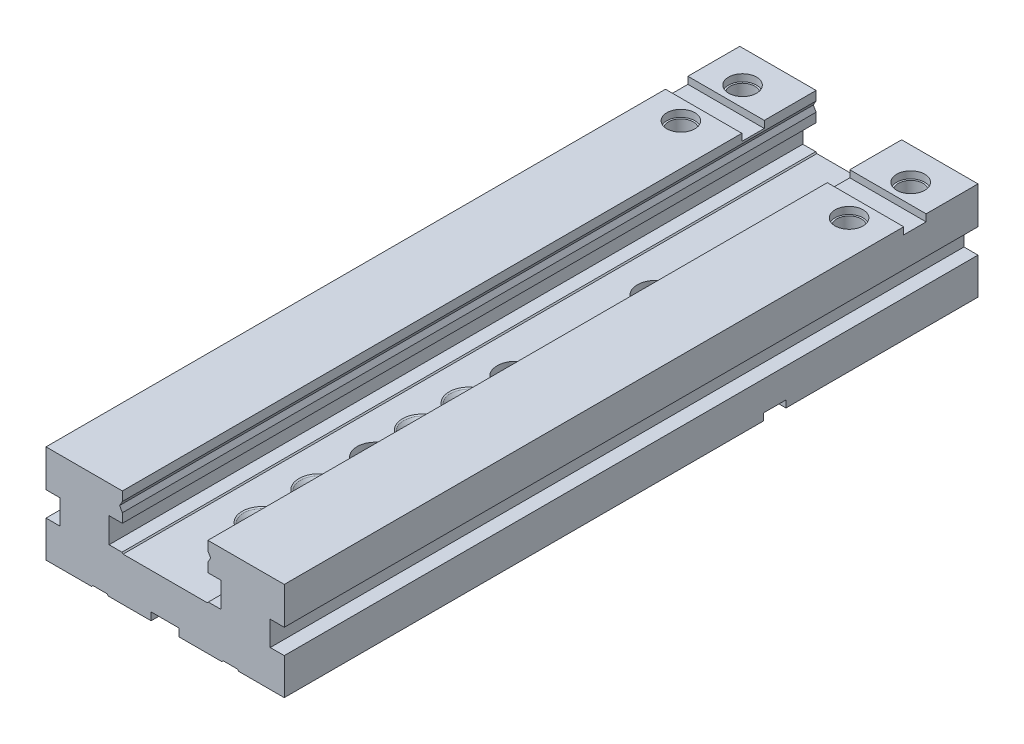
ISO-10303-21;
HEADER;
FILE_DESCRIPTION(('STEP AP214'),'2;1');
FILE_NAME('part.step','',(''),(''),'','','');
FILE_SCHEMA(('AUTOMOTIVE_DESIGN { 1 0 10303 214 1 1 1 1 }'));
ENDSEC;
DATA;
#1=APPLICATION_CONTEXT('core data for automotive mechanical design processes');
#2=APPLICATION_PROTOCOL_DEFINITION('international standard','automotive_design',2000,#1);
#3=PRODUCT_CONTEXT('',#1,'mechanical');
#4=PRODUCT('Part','Part','',(#3));
#5=PRODUCT_RELATED_PRODUCT_CATEGORY('part','',(#4));
#6=PRODUCT_DEFINITION_FORMATION('','',#4);
#7=PRODUCT_DEFINITION_CONTEXT('part definition',#1,'design');
#8=PRODUCT_DEFINITION('design','',#6,#7);
#9=PRODUCT_DEFINITION_SHAPE('','',#8);
#10=(LENGTH_UNIT() NAMED_UNIT(*) SI_UNIT(.MILLI.,.METRE.));
#11=(NAMED_UNIT(*) PLANE_ANGLE_UNIT() SI_UNIT($,.RADIAN.));
#12=(NAMED_UNIT(*) SI_UNIT($,.STERADIAN.) SOLID_ANGLE_UNIT());
#13=UNCERTAINTY_MEASURE_WITH_UNIT(LENGTH_MEASURE(1.E-05),#10,'distance_accuracy_value','');
#14=(GEOMETRIC_REPRESENTATION_CONTEXT(3) GLOBAL_UNCERTAINTY_ASSIGNED_CONTEXT((#13)) GLOBAL_UNIT_ASSIGNED_CONTEXT((#10,
#11,#12)) REPRESENTATION_CONTEXT('',''));
#15=CARTESIAN_POINT('',(0.,0.,0.));
#16=DIRECTION('',(0.,0.,1.));
#17=DIRECTION('',(1.,0.,0.));
#18=AXIS2_PLACEMENT_3D('',#15,#16,#17);
#19=CARTESIAN_POINT('',(69.9999999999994,-15.9999999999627,-350.000000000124));
#20=DIRECTION('',(0.,-1.,0.));
#21=DIRECTION('',(0.,0.,-1.));
#22=AXIS2_PLACEMENT_3D('',#19,#20,#21);
#23=CONICAL_SURFACE('',#22,2.0999999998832,1.0297442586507);
#24=CARTESIAN_POINT('',(69.9999999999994,-16.0000000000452,-350.000000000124));
#25=DIRECTION('',(0.,-1.,0.));
#26=DIRECTION('',(0.,0.,-1.));
#27=AXIS2_PLACEMENT_3D('',#24,#25,#26);
#28=CIRCLE('',#27,2.09999999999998);
#29=CARTESIAN_POINT('',(69.9999999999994,-16.0000000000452,-352.100000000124));
#30=VERTEX_POINT('',#29);
#31=EDGE_CURVE('E948',#30,#30,#28,.T.);
#32=ORIENTED_EDGE('',*,*,#31,.T.);
#33=EDGE_LOOP('',(#32));
#34=FACE_BOUND('',#33,.T.);
#35=CARTESIAN_POINT('',(69.9999999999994,-14.7381927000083,-350.000000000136));
#36=VERTEX_POINT('',#35);
#37=VERTEX_LOOP('',#36);
#38=FACE_BOUND('',#37,.T.);
#39=ADVANCED_FACE('F35',(#34,#38),#23,.F.);
#40=CARTESIAN_POINT('',(-69.9999999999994,-16.0000000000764,-350.000000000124));
#41=DIRECTION('',(0.,-1.,0.));
#42=DIRECTION('',(0.,0.,-1.));
#43=AXIS2_PLACEMENT_3D('',#40,#41,#42);
#44=CONICAL_SURFACE('',#43,2.10000000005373,1.02974425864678);
#45=CARTESIAN_POINT('',(-69.9999999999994,-16.0000000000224,-350.000000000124));
#46=DIRECTION('',(0.,-1.,0.));
#47=DIRECTION('',(0.,0.,-1.));
#48=AXIS2_PLACEMENT_3D('',#45,#46,#47);
#49=CIRCLE('',#48,2.09999999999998);
#50=CARTESIAN_POINT('',(-69.9999999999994,-16.0000000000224,-352.100000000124));
#51=VERTEX_POINT('',#50);
#52=EDGE_CURVE('E945',#51,#51,#49,.T.);
#53=ORIENTED_EDGE('',*,*,#52,.T.);
#54=EDGE_LOOP('',(#53));
#55=FACE_BOUND('',#54,.T.);
#56=CARTESIAN_POINT('',(-69.9999999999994,-14.7381927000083,-350.000000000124));
#57=VERTEX_POINT('',#56);
#58=VERTEX_LOOP('',#57);
#59=FACE_BOUND('',#58,.T.);
#60=ADVANCED_FACE('F2314',(#55,#59),#44,.F.);
#61=CARTESIAN_POINT('',(0.,-15.9999999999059,-480.000000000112));
#62=DIRECTION('',(0.,-1.,0.));
#63=DIRECTION('',(0.,0.,-1.));
#64=AXIS2_PLACEMENT_3D('',#61,#62,#63);
#65=CONICAL_SURFACE('',#64,2.09999999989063,1.02974425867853);
#66=CARTESIAN_POINT('',(0.,-16.0000000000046,-480.000000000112));
#67=DIRECTION('',(0.,-1.,0.));
#68=DIRECTION('',(0.,0.,-1.));
#69=AXIS2_PLACEMENT_3D('',#66,#67,#68);
#70=CIRCLE('',#69,2.09999999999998);
#71=CARTESIAN_POINT('',(0.,-16.0000000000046,-482.100000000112));
#72=VERTEX_POINT('',#71);
#73=EDGE_CURVE('E942',#72,#72,#70,.T.);
#74=ORIENTED_EDGE('',*,*,#73,.T.);
#75=EDGE_LOOP('',(#74));
#76=FACE_BOUND('',#75,.T.);
#77=CARTESIAN_POINT('',(0.,-14.7381927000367,-480.000000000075));
#78=VERTEX_POINT('',#77);
#79=VERTEX_LOOP('',#78);
#80=FACE_BOUND('',#79,.T.);
#81=ADVANCED_FACE('F2311',(#76,#80),#65,.F.);
#82=CARTESIAN_POINT('',(59.9999999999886,-12.0000000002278,-471.99999999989));
#83=DIRECTION('',(0.,1.,0.));
#84=DIRECTION('',(0.,0.,1.));
#85=AXIS2_PLACEMENT_3D('',#82,#83,#84);
#86=CONICAL_SURFACE('',#85,8.74999999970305,1.02974425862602);
#87=CARTESIAN_POINT('',(59.9999999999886,-12.0000000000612,-471.99999999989));
#88=DIRECTION('',(0.,1.,0.));
#89=DIRECTION('',(0.,0.,1.));
#90=AXIS2_PLACEMENT_3D('',#87,#88,#89);
#91=CIRCLE('',#90,8.75000000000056);
#92=CARTESIAN_POINT('',(59.9999999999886,-12.0000000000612,-463.249999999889));
#93=VERTEX_POINT('',#92);
#94=EDGE_CURVE('E939',#93,#93,#91,.T.);
#95=ORIENTED_EDGE('',*,*,#94,.T.);
#96=EDGE_LOOP('',(#95));
#97=FACE_BOUND('',#96,.T.);
#98=CARTESIAN_POINT('',(59.9999999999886,-17.257530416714,-471.999999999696));
#99=VERTEX_POINT('',#98);
#100=VERTEX_LOOP('',#99);
#101=FACE_BOUND('',#100,.T.);
#102=ADVANCED_FACE('F2307',(#97,#101),#86,.F.);
#103=CARTESIAN_POINT('',(-59.9999999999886,-12.0000000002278,-471.99999999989));
#104=DIRECTION('',(0.,1.,0.));
#105=DIRECTION('',(0.,0.,1.));
#106=AXIS2_PLACEMENT_3D('',#103,#104,#105);
#107=CONICAL_SURFACE('',#106,8.74999999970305,1.02974425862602);
#108=CARTESIAN_POINT('',(-59.9999999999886,-12.0000000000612,-471.99999999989));
#109=DIRECTION('',(0.,1.,0.));
#110=DIRECTION('',(0.,0.,1.));
#111=AXIS2_PLACEMENT_3D('',#108,#109,#110);
#112=CIRCLE('',#111,8.75000000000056);
#113=CARTESIAN_POINT('',(-59.9999999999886,-12.0000000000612,-463.249999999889));
#114=VERTEX_POINT('',#113);
#115=EDGE_CURVE('E936',#114,#114,#112,.T.);
#116=ORIENTED_EDGE('',*,*,#115,.T.);
#117=EDGE_LOOP('',(#116));
#118=FACE_BOUND('',#117,.T.);
#119=CARTESIAN_POINT('',(-59.9999999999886,-17.257530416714,-471.999999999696));
#120=VERTEX_POINT('',#119);
#121=VERTEX_LOOP('',#120);
#122=FACE_BOUND('',#121,.T.);
#123=ADVANCED_FACE('F2303',(#118,#122),#107,.F.);
#124=CARTESIAN_POINT('',(69.9999999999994,-30.000000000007,-350.000000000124));
#125=DIRECTION('',(0.,-1.,0.));
#126=DIRECTION('',(0.,0.,-1.));
#127=AXIS2_PLACEMENT_3D('',#124,#125,#126);
#128=CYLINDRICAL_SURFACE('',#127,2.09999999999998);
#129=CARTESIAN_POINT('',(69.9999999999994,-28.6999999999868,-350.000000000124));
#130=DIRECTION('',(0.,-1.,0.));
#131=DIRECTION('',(0.,0.,-1.));
#132=AXIS2_PLACEMENT_3D('',#129,#130,#131);
#133=CIRCLE('',#132,2.09999999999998);
#134=CARTESIAN_POINT('',(69.9999999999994,-28.6999999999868,-352.100000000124));
#135=VERTEX_POINT('',#134);
#136=EDGE_CURVE('E935',#135,#135,#133,.T.);
#137=ORIENTED_EDGE('',*,*,#136,.T.);
#138=EDGE_LOOP('',(#137));
#139=FACE_BOUND('',#138,.T.);
#140=ORIENTED_EDGE('',*,*,#31,.F.);
#141=EDGE_LOOP('',(#140));
#142=FACE_BOUND('',#141,.T.);
#143=ADVANCED_FACE('F2299',(#139,#142),#128,.F.);
#144=CARTESIAN_POINT('',(59.9999999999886,-12.0000000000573,-428.000000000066));
#145=DIRECTION('',(0.,1.,0.));
#146=DIRECTION('',(0.,0.,1.));
#147=AXIS2_PLACEMENT_3D('',#144,#145,#146);
#148=CONICAL_SURFACE('',#147,8.75000000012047,1.0297442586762);
#149=CARTESIAN_POINT('',(59.9999999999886,-12.0000000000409,-428.000000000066));
#150=DIRECTION('',(0.,1.,0.));
#151=DIRECTION('',(0.,0.,1.));
#152=AXIS2_PLACEMENT_3D('',#149,#150,#151);
#153=CIRCLE('',#152,8.75000000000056);
#154=CARTESIAN_POINT('',(59.9999999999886,-12.0000000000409,-419.250000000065));
#155=VERTEX_POINT('',#154);
#156=EDGE_CURVE('E932',#155,#155,#153,.T.);
#157=ORIENTED_EDGE('',*,*,#156,.T.);
#158=EDGE_LOOP('',(#157));
#159=FACE_BOUND('',#158,.T.);
#160=CARTESIAN_POINT('',(60.0000000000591,-17.2575304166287,-428.000000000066));
#161=VERTEX_POINT('',#160);
#162=VERTEX_LOOP('',#161);
#163=FACE_BOUND('',#162,.T.);
#164=ADVANCED_FACE('F2295',(#159,#163),#148,.F.);
#165=CARTESIAN_POINT('',(-59.9999999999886,-12.0000000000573,-428.000000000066));
#166=DIRECTION('',(0.,1.,0.));
#167=DIRECTION('',(0.,0.,1.));
#168=AXIS2_PLACEMENT_3D('',#165,#166,#167);
#169=CONICAL_SURFACE('',#168,8.75000000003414,1.02974425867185);
#170=CARTESIAN_POINT('',(-59.9999999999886,-12.0000000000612,-428.000000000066));
#171=DIRECTION('',(0.,1.,0.));
#172=DIRECTION('',(0.,0.,1.));
#173=AXIS2_PLACEMENT_3D('',#170,#171,#172);
#174=CIRCLE('',#173,8.75000000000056);
#175=CARTESIAN_POINT('',(-59.9999999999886,-12.0000000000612,-419.250000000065));
#176=VERTEX_POINT('',#175);
#177=EDGE_CURVE('E929',#176,#176,#174,.T.);
#178=ORIENTED_EDGE('',*,*,#177,.T.);
#179=EDGE_LOOP('',(#178));
#180=FACE_BOUND('',#179,.T.);
#181=CARTESIAN_POINT('',(-60.0000000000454,-17.2575304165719,-428.000000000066));
#182=VERTEX_POINT('',#181);
#183=VERTEX_LOOP('',#182);
#184=FACE_BOUND('',#183,.T.);
#185=ADVANCED_FACE('F2291',(#180,#184),#169,.F.);
#186=CARTESIAN_POINT('',(-69.9999999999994,-30.000000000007,-350.000000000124));
#187=DIRECTION('',(0.,-1.,0.));
#188=DIRECTION('',(0.,0.,-1.));
#189=AXIS2_PLACEMENT_3D('',#186,#187,#188);
#190=CYLINDRICAL_SURFACE('',#189,2.09999999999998);
#191=CARTESIAN_POINT('',(-69.9999999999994,-28.6999999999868,-350.000000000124));
#192=DIRECTION('',(0.,-1.,0.));
#193=DIRECTION('',(0.,0.,-1.));
#194=AXIS2_PLACEMENT_3D('',#191,#192,#193);
#195=CIRCLE('',#194,2.09999999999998);
#196=CARTESIAN_POINT('',(-69.9999999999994,-28.6999999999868,-352.100000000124));
#197=VERTEX_POINT('',#196);
#198=EDGE_CURVE('E928',#197,#197,#195,.T.);
#199=ORIENTED_EDGE('',*,*,#198,.T.);
#200=EDGE_LOOP('',(#199));
#201=FACE_BOUND('',#200,.T.);
#202=ORIENTED_EDGE('',*,*,#52,.F.);
#203=EDGE_LOOP('',(#202));
#204=FACE_BOUND('',#203,.T.);
#205=ADVANCED_FACE('F2287',(#201,#204),#190,.F.);
#206=CARTESIAN_POINT('',(0.,-29.9999999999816,-480.000000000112));
#207=DIRECTION('',(0.,-1.,0.));
#208=DIRECTION('',(0.,0.,-1.));
#209=AXIS2_PLACEMENT_3D('',#206,#207,#208);
#210=CYLINDRICAL_SURFACE('',#209,2.09999999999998);
#211=CARTESIAN_POINT('',(0.,-28.7000000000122,-480.000000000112));
#212=DIRECTION('',(0.,-1.,0.));
#213=DIRECTION('',(0.,0.,-1.));
#214=AXIS2_PLACEMENT_3D('',#211,#212,#213);
#215=CIRCLE('',#214,2.09999999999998);
#216=CARTESIAN_POINT('',(0.,-28.7000000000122,-482.100000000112));
#217=VERTEX_POINT('',#216);
#218=EDGE_CURVE('E927',#217,#217,#215,.T.);
#219=ORIENTED_EDGE('',*,*,#218,.T.);
#220=EDGE_LOOP('',(#219));
#221=FACE_BOUND('',#220,.T.);
#222=ORIENTED_EDGE('',*,*,#73,.F.);
#223=EDGE_LOOP('',(#222));
#224=FACE_BOUND('',#223,.T.);
#225=ADVANCED_FACE('F2283',(#221,#224),#210,.F.);
#226=CARTESIAN_POINT('',(59.9999999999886,35.0000000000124,-471.99999999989));
#227=DIRECTION('',(0.,1.,0.));
#228=DIRECTION('',(0.,0.,1.));
#229=AXIS2_PLACEMENT_3D('',#226,#227,#228);
#230=CYLINDRICAL_SURFACE('',#229,8.75000000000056);
#231=CARTESIAN_POINT('',(59.9999999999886,30.000000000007,-471.99999999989));
#232=DIRECTION('',(0.,1.,0.));
#233=DIRECTION('',(0.,0.,1.));
#234=AXIS2_PLACEMENT_3D('',#231,#232,#233);
#235=CIRCLE('',#234,8.75000000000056);
#236=CARTESIAN_POINT('',(59.9999999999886,30.000000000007,-463.249999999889));
#237=VERTEX_POINT('',#236);
#238=EDGE_CURVE('E1071',#237,#237,#235,.T.);
#239=ORIENTED_EDGE('',*,*,#238,.T.);
#240=EDGE_LOOP('',(#239));
#241=FACE_BOUND('',#240,.T.);
#242=ORIENTED_EDGE('',*,*,#94,.F.);
#243=EDGE_LOOP('',(#242));
#244=FACE_BOUND('',#243,.T.);
#245=ADVANCED_FACE('F2279',(#241,#244),#230,.F.);
#246=CARTESIAN_POINT('',(-59.9999999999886,35.0000000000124,-471.99999999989));
#247=DIRECTION('',(0.,1.,0.));
#248=DIRECTION('',(0.,0.,1.));
#249=AXIS2_PLACEMENT_3D('',#246,#247,#248);
#250=CYLINDRICAL_SURFACE('',#249,8.75000000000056);
#251=CARTESIAN_POINT('',(-59.9999999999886,30.000000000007,-471.99999999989));
#252=DIRECTION('',(0.,1.,0.));
#253=DIRECTION('',(0.,0.,1.));
#254=AXIS2_PLACEMENT_3D('',#251,#252,#253);
#255=CIRCLE('',#254,8.75000000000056);
#256=CARTESIAN_POINT('',(-59.9999999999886,30.000000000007,-463.249999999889));
#257=VERTEX_POINT('',#256);
#258=EDGE_CURVE('E1068',#257,#257,#255,.T.);
#259=ORIENTED_EDGE('',*,*,#258,.T.);
#260=EDGE_LOOP('',(#259));
#261=FACE_BOUND('',#260,.T.);
#262=ORIENTED_EDGE('',*,*,#115,.F.);
#263=EDGE_LOOP('',(#262));
#264=FACE_BOUND('',#263,.T.);
#265=ADVANCED_FACE('F2275',(#261,#264),#250,.F.);
#266=CARTESIAN_POINT('',(69.9999999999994,-28.6999999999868,-350.000000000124));
#267=DIRECTION('',(0.,1.,0.));
#268=DIRECTION('',(0.,0.,1.));
#269=AXIS2_PLACEMENT_3D('',#266,#267,#268);
#270=PLANE('',#269);
#271=ORIENTED_EDGE('',*,*,#136,.F.);
#272=EDGE_LOOP('',(#271));
#273=FACE_BOUND('',#272,.T.);
#274=CARTESIAN_POINT('',(69.9999999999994,-28.6999999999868,-350.000000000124));
#275=DIRECTION('',(0.,-1.,0.));
#276=DIRECTION('',(0.,0.,-1.));
#277=AXIS2_PLACEMENT_3D('',#274,#275,#276);
#278=CIRCLE('',#277,2.49999999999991);
#279=CARTESIAN_POINT('',(69.9999999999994,-28.6999999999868,-352.500000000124));
#280=VERTEX_POINT('',#279);
#281=EDGE_CURVE('E1065',#280,#280,#278,.T.);
#282=ORIENTED_EDGE('',*,*,#281,.T.);
#283=EDGE_LOOP('',(#282));
#284=FACE_BOUND('',#283,.T.);
#285=ADVANCED_FACE('F2271',(#273,#284),#270,.F.);
#286=CARTESIAN_POINT('',(59.9999999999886,35.0000000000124,-428.000000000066));
#287=DIRECTION('',(0.,1.,0.));
#288=DIRECTION('',(0.,0.,1.));
#289=AXIS2_PLACEMENT_3D('',#286,#287,#288);
#290=CYLINDRICAL_SURFACE('',#289,8.75000000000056);
#291=CARTESIAN_POINT('',(59.9999999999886,30.000000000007,-428.000000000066));
#292=DIRECTION('',(0.,1.,0.));
#293=DIRECTION('',(0.,0.,1.));
#294=AXIS2_PLACEMENT_3D('',#291,#292,#293);
#295=CIRCLE('',#294,8.75000000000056);
#296=CARTESIAN_POINT('',(59.9999999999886,30.000000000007,-419.250000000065));
#297=VERTEX_POINT('',#296);
#298=EDGE_CURVE('E1062',#297,#297,#295,.T.);
#299=ORIENTED_EDGE('',*,*,#298,.T.);
#300=EDGE_LOOP('',(#299));
#301=FACE_BOUND('',#300,.T.);
#302=ORIENTED_EDGE('',*,*,#156,.F.);
#303=EDGE_LOOP('',(#302));
#304=FACE_BOUND('',#303,.T.);
#305=ADVANCED_FACE('F2267',(#301,#304),#290,.F.);
#306=CARTESIAN_POINT('',(-59.9999999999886,35.0000000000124,-428.000000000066));
#307=DIRECTION('',(0.,1.,0.));
#308=DIRECTION('',(0.,0.,1.));
#309=AXIS2_PLACEMENT_3D('',#306,#307,#308);
#310=CYLINDRICAL_SURFACE('',#309,8.75000000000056);
#311=CARTESIAN_POINT('',(-59.9999999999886,30.000000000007,-428.000000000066));
#312=DIRECTION('',(0.,1.,0.));
#313=DIRECTION('',(0.,0.,1.));
#314=AXIS2_PLACEMENT_3D('',#311,#312,#313);
#315=CIRCLE('',#314,8.75000000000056);
#316=CARTESIAN_POINT('',(-59.9999999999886,30.000000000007,-419.250000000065));
#317=VERTEX_POINT('',#316);
#318=EDGE_CURVE('E1059',#317,#317,#315,.T.);
#319=ORIENTED_EDGE('',*,*,#318,.T.);
#320=EDGE_LOOP('',(#319));
#321=FACE_BOUND('',#320,.T.);
#322=ORIENTED_EDGE('',*,*,#177,.F.);
#323=EDGE_LOOP('',(#322));
#324=FACE_BOUND('',#323,.T.);
#325=ADVANCED_FACE('F2263',(#321,#324),#310,.F.);
#326=CARTESIAN_POINT('',(-69.9999999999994,-28.6999999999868,-350.000000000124));
#327=DIRECTION('',(0.,1.,0.));
#328=DIRECTION('',(0.,0.,1.));
#329=AXIS2_PLACEMENT_3D('',#326,#327,#328);
#330=PLANE('',#329);
#331=ORIENTED_EDGE('',*,*,#198,.F.);
#332=EDGE_LOOP('',(#331));
#333=FACE_BOUND('',#332,.T.);
#334=CARTESIAN_POINT('',(-69.9999999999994,-28.6999999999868,-350.000000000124));
#335=DIRECTION('',(0.,-1.,0.));
#336=DIRECTION('',(0.,0.,-1.));
#337=AXIS2_PLACEMENT_3D('',#334,#335,#336);
#338=CIRCLE('',#337,2.49999999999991);
#339=CARTESIAN_POINT('',(-69.9999999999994,-28.6999999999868,-352.500000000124));
#340=VERTEX_POINT('',#339);
#341=EDGE_CURVE('E1056',#340,#340,#338,.T.);
#342=ORIENTED_EDGE('',*,*,#341,.T.);
#343=EDGE_LOOP('',(#342));
#344=FACE_BOUND('',#343,.T.);
#345=ADVANCED_FACE('F2259',(#333,#344),#330,.F.);
#346=CARTESIAN_POINT('',(0.,-35.0000000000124,-216.666666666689));
#347=DIRECTION('',(0.,-1.,0.));
#348=DIRECTION('',(0.,0.,-1.));
#349=AXIS2_PLACEMENT_3D('',#346,#347,#348);
#350=CYLINDRICAL_SURFACE('',#349,2.09999999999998);
#351=CARTESIAN_POINT('',(0.,-30.000000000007,-216.666666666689));
#352=DIRECTION('',(0.,-1.,0.));
#353=DIRECTION('',(0.,0.,-1.));
#354=AXIS2_PLACEMENT_3D('',#351,#352,#353);
#355=CIRCLE('',#354,2.09999999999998);
#356=CARTESIAN_POINT('',(0.,-30.000000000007,-218.766666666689));
#357=VERTEX_POINT('',#356);
#358=EDGE_CURVE('E923',#357,#357,#355,.F.);
#359=ORIENTED_EDGE('',*,*,#358,.F.);
#360=EDGE_LOOP('',(#359));
#361=FACE_BOUND('',#360,.T.);
#362=CARTESIAN_POINT('',(0.,-20.9999999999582,-216.666666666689));
#363=DIRECTION('',(0.,-1.,0.));
#364=DIRECTION('',(0.,0.,-1.));
#365=AXIS2_PLACEMENT_3D('',#362,#363,#364);
#366=CIRCLE('',#365,2.0999999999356);
#367=CARTESIAN_POINT('',(0.,-20.9999999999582,-218.766666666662));
#368=VERTEX_POINT('',#367);
#369=EDGE_CURVE('E924',#368,#368,#366,.F.);
#370=ORIENTED_EDGE('',*,*,#369,.T.);
#371=EDGE_LOOP('',(#370));
#372=FACE_BOUND('',#371,.T.);
#373=ADVANCED_FACE('F2255',(#361,#372),#350,.F.);
#374=CARTESIAN_POINT('',(0.,-20.9999999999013,-216.666666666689));
#375=DIRECTION('',(0.,-1.,0.));
#376=DIRECTION('',(0.,0.,-1.));
#377=AXIS2_PLACEMENT_3D('',#374,#375,#376);
#378=CONICAL_SURFACE('',#377,2.09999999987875,1.02974425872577);
#379=CARTESIAN_POINT('',(0.,-20.0612478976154,-216.666666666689));
#380=DIRECTION('',(0.,1.,0.));
#381=DIRECTION('',(0.,0.,1.));
#382=AXIS2_PLACEMENT_3D('',#379,#380,#381);
#383=CIRCLE('',#382,0.537654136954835);
#384=CARTESIAN_POINT('',(0.,-20.0612478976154,-217.204320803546));
#385=VERTEX_POINT('',#384);
#386=EDGE_CURVE('E920',#385,#385,#383,.T.);
#387=CARTESIAN_POINT('',(0.,-20.9999999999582,-218.766666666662));
#388=CARTESIAN_POINT('',(0.,-20.9902213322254,-218.750392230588));
#389=CARTESIAN_POINT('',(0.,-20.9804426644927,-218.734117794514));
#390=CARTESIAN_POINT('',(0.,-20.9608853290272,-218.701568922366));
#391=CARTESIAN_POINT('',(0.,-20.9511066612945,-218.685294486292));
#392=CARTESIAN_POINT('',(0.,-20.931549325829,-218.652745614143));
#393=CARTESIAN_POINT('',(0.,-20.9217706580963,-218.636471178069));
#394=CARTESIAN_POINT('',(0.,-20.9022133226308,-218.603922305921));
#395=CARTESIAN_POINT('',(0.,-20.8924346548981,-218.587647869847));
#396=CARTESIAN_POINT('',(0.,-20.8728773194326,-218.555098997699));
#397=CARTESIAN_POINT('',(0.,-20.8630986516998,-218.538824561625));
#398=CARTESIAN_POINT('',(0.,-20.8435413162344,-218.506275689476));
#399=CARTESIAN_POINT('',(0.,-20.8337626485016,-218.490001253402));
#400=CARTESIAN_POINT('',(0.,-20.8142053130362,-218.457452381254));
#401=CARTESIAN_POINT('',(0.,-20.8044266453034,-218.44117794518));
#402=CARTESIAN_POINT('',(0.,-20.784869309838,-218.408629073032));
#403=CARTESIAN_POINT('',(0.,-20.7750906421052,-218.392354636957));
#404=CARTESIAN_POINT('',(0.,-20.7555333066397,-218.359805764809));
#405=CARTESIAN_POINT('',(0.,-20.745754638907,-218.343531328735));
#406=CARTESIAN_POINT('',(0.,-20.7261973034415,-218.310982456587));
#407=CARTESIAN_POINT('',(0.,-20.7164186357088,-218.294708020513));
#408=CARTESIAN_POINT('',(0.,-20.6968613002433,-218.262159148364));
#409=CARTESIAN_POINT('',(0.,-20.6870826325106,-218.24588471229));
#410=CARTESIAN_POINT('',(0.,-20.6675252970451,-218.213335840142));
#411=CARTESIAN_POINT('',(0.,-20.6577466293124,-218.197061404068));
#412=CARTESIAN_POINT('',(0.,-20.6381892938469,-218.16451253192));
#413=CARTESIAN_POINT('',(0.,-20.6284106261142,-218.148238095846));
#414=CARTESIAN_POINT('',(0.,-20.6088532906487,-218.115689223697));
#415=CARTESIAN_POINT('',(0.,-20.599074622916,-218.099414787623));
#416=CARTESIAN_POINT('',(0.,-20.5795172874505,-218.066865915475));
#417=CARTESIAN_POINT('',(0.,-20.5697386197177,-218.050591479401));
#418=CARTESIAN_POINT('',(0.,-20.5501812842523,-218.018042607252));
#419=CARTESIAN_POINT('',(0.,-20.5404026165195,-218.001768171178));
#420=CARTESIAN_POINT('',(0.,-20.5208452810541,-217.96921929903));
#421=CARTESIAN_POINT('',(0.,-20.5110666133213,-217.952944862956));
#422=CARTESIAN_POINT('',(0.,-20.4915092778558,-217.920395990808));
#423=CARTESIAN_POINT('',(0.,-20.4817306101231,-217.904121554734));
#424=CARTESIAN_POINT('',(0.,-20.4621732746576,-217.871572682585));
#425=CARTESIAN_POINT('',(0.,-20.4523946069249,-217.855298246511));
#426=CARTESIAN_POINT('',(0.,-20.4328372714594,-217.822749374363));
#427=CARTESIAN_POINT('',(0.,-20.4230586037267,-217.806474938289));
#428=CARTESIAN_POINT('',(0.,-20.4035012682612,-217.773926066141));
#429=CARTESIAN_POINT('',(0.,-20.3937226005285,-217.757651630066));
#430=CARTESIAN_POINT('',(0.,-20.374165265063,-217.725102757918));
#431=CARTESIAN_POINT('',(0.,-20.3643865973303,-217.708828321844));
#432=CARTESIAN_POINT('',(0.,-20.3448292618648,-217.676279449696));
#433=CARTESIAN_POINT('',(0.,-20.3350505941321,-217.660005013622));
#434=CARTESIAN_POINT('',(0.,-20.3154932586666,-217.627456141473));
#435=CARTESIAN_POINT('',(0.,-20.3057145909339,-217.611181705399));
#436=CARTESIAN_POINT('',(0.,-20.2861572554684,-217.578632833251));
#437=CARTESIAN_POINT('',(0.,-20.2763785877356,-217.562358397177));
#438=CARTESIAN_POINT('',(0.,-20.2568212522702,-217.529809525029));
#439=CARTESIAN_POINT('',(0.,-20.2470425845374,-217.513535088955));
#440=CARTESIAN_POINT('',(0.,-20.227485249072,-217.480986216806));
#441=CARTESIAN_POINT('',(0.,-20.2177065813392,-217.464711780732));
#442=CARTESIAN_POINT('',(0.,-20.1981492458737,-217.432162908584));
#443=CARTESIAN_POINT('',(0.,-20.188370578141,-217.41588847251));
#444=CARTESIAN_POINT('',(0.,-20.1688132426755,-217.383339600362));
#445=CARTESIAN_POINT('',(0.,-20.1590345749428,-217.367065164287));
#446=CARTESIAN_POINT('',(0.,-20.1394772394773,-217.334516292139));
#447=CARTESIAN_POINT('',(0.,-20.1296985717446,-217.318241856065));
#448=CARTESIAN_POINT('',(0.,-20.1101412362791,-217.285692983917));
#449=CARTESIAN_POINT('',(0.,-20.1003625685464,-217.269418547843));
#450=CARTESIAN_POINT('',(0.,-20.0808052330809,-217.236869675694));
#451=CARTESIAN_POINT('',(0.,-20.0710265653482,-217.22059523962));
#452=CARTESIAN_POINT('',(0.,-20.0612478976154,-217.204320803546));
#453=B_SPLINE_CURVE_WITH_KNOTS('',3,(#387,#388,#389,#390,#391,#392,#393,#394,#395,#396,#397,
#398,#399,#400,#401,#402,#403,#404,#405,#406,#407,#408,#409,#410,#411,#412,#413,#414,#415,#416,
#417,#418,#419,#420,#421,#422,#423,#424,#425,#426,#427,#428,#429,#430,#431,#432,#433,#434,#435,
#436,#437,#438,#439,#440,#441,#442,#443,#444,#445,#446,#447,#448,#449,#450,#451,#452),
.UNSPECIFIED.,.F.,.F.,(4,2,2,2,2,2,2,2,2,2,2,2,2,2,2,2,2,2,2,2,2,2,2,2,2,2,2,2,2,2,2,2,4),(0.,
0.0569589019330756,0.113917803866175,0.170876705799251,0.22783560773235,0.284794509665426,
0.341753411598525,0.398712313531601,0.4556712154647,0.512630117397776,0.569589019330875,
0.626547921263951,0.68350682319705,0.740465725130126,0.797424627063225,0.854383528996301,
0.9113424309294,0.968301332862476,1.02526023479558,1.08221913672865,1.13917803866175,
1.19613694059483,1.25309584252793,1.310054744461,1.3670136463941,1.42397254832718,
1.48093145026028,1.53789035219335,1.59484925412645,1.65180815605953,1.70876705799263,
1.7657259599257,1.8226848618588),.UNSPECIFIED.);
#454=EDGE_CURVE('BSEAM2251',#368,#385,#453,.T.);
#455=ORIENTED_EDGE('',*,*,#369,.F.);
#456=ORIENTED_EDGE('',*,*,#386,.T.);
#457=ORIENTED_EDGE('',*,*,#454,.T.);
#458=ORIENTED_EDGE('',*,*,#454,.F.);
#459=EDGE_LOOP('',(#455,#457,#456,#458));
#460=FACE_BOUND('',#459,.T.);
#461=ADVANCED_FACE('F2251',(#460),#378,.F.);
#462=CARTESIAN_POINT('',(0.,-28.7000000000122,-480.000000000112));
#463=DIRECTION('',(0.,1.,0.));
#464=DIRECTION('',(0.,0.,1.));
#465=AXIS2_PLACEMENT_3D('',#462,#463,#464);
#466=PLANE('',#465);
#467=ORIENTED_EDGE('',*,*,#218,.F.);
#468=EDGE_LOOP('',(#467));
#469=FACE_BOUND('',#468,.T.);
#470=CARTESIAN_POINT('',(0.,-28.7000000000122,-480.000000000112));
#471=DIRECTION('',(0.,-1.,0.));
#472=DIRECTION('',(0.,0.,-1.));
#473=AXIS2_PLACEMENT_3D('',#470,#471,#472);
#474=CIRCLE('',#473,2.49999999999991);
#475=CARTESIAN_POINT('',(0.,-28.7000000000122,-482.500000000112));
#476=VERTEX_POINT('',#475);
#477=EDGE_CURVE('E917',#476,#476,#474,.T.);
#478=ORIENTED_EDGE('',*,*,#477,.T.);
#479=EDGE_LOOP('',(#478));
#480=FACE_BOUND('',#479,.T.);
#481=ADVANCED_FACE('F2247',(#469,#480),#466,.F.);
#482=CARTESIAN_POINT('',(59.9999999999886,30.000000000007,-471.99999999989));
#483=DIRECTION('',(0.,-1.,0.));
#484=DIRECTION('',(0.,0.,-1.));
#485=AXIS2_PLACEMENT_3D('',#482,#483,#484);
#486=PLANE('',#485);
#487=ORIENTED_EDGE('',*,*,#238,.F.);
#488=EDGE_LOOP('',(#487));
#489=FACE_BOUND('',#488,.T.);
#490=CARTESIAN_POINT('',(59.9999999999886,30.000000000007,-471.99999999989));
#491=DIRECTION('',(0.,1.,0.));
#492=DIRECTION('',(0.,0.,1.));
#493=AXIS2_PLACEMENT_3D('',#490,#491,#492);
#494=CIRCLE('',#493,10.0000000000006);
#495=CARTESIAN_POINT('',(59.9999999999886,30.000000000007,-461.999999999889));
#496=VERTEX_POINT('',#495);
#497=EDGE_CURVE('E683',#496,#496,#494,.T.);
#498=ORIENTED_EDGE('',*,*,#497,.T.);
#499=EDGE_LOOP('',(#498));
#500=FACE_BOUND('',#499,.T.);
#501=ADVANCED_FACE('F2243',(#489,#500),#486,.F.);
#502=CARTESIAN_POINT('',(-59.9999999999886,30.000000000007,-471.99999999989));
#503=DIRECTION('',(0.,-1.,0.));
#504=DIRECTION('',(0.,0.,-1.));
#505=AXIS2_PLACEMENT_3D('',#502,#503,#504);
#506=PLANE('',#505);
#507=ORIENTED_EDGE('',*,*,#258,.F.);
#508=EDGE_LOOP('',(#507));
#509=FACE_BOUND('',#508,.T.);
#510=CARTESIAN_POINT('',(-59.9999999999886,30.000000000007,-471.99999999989));
#511=DIRECTION('',(0.,1.,0.));
#512=DIRECTION('',(0.,0.,1.));
#513=AXIS2_PLACEMENT_3D('',#510,#511,#512);
#514=CIRCLE('',#513,10.0000000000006);
#515=CARTESIAN_POINT('',(-59.9999999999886,30.000000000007,-461.999999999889));
#516=VERTEX_POINT('',#515);
#517=EDGE_CURVE('E657',#516,#516,#514,.T.);
#518=ORIENTED_EDGE('',*,*,#517,.T.);
#519=EDGE_LOOP('',(#518));
#520=FACE_BOUND('',#519,.T.);
#521=ADVANCED_FACE('F2239',(#509,#520),#506,.F.);
#522=CARTESIAN_POINT('',(69.9999999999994,-29.9999999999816,-350.000000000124));
#523=DIRECTION('',(0.,-1.,0.));
#524=DIRECTION('',(0.,0.,-1.));
#525=AXIS2_PLACEMENT_3D('',#522,#523,#524);
#526=CYLINDRICAL_SURFACE('',#525,2.49999999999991);
#527=CARTESIAN_POINT('',(69.9999999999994,-29.9999999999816,-350.000000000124));
#528=DIRECTION('',(0.,-1.,0.));
#529=DIRECTION('',(0.,0.,-1.));
#530=AXIS2_PLACEMENT_3D('',#527,#528,#529);
#531=CIRCLE('',#530,2.49999999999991);
#532=CARTESIAN_POINT('',(69.9999999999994,-29.9999999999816,-352.500000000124));
#533=VERTEX_POINT('',#532);
#534=EDGE_CURVE('E690',#533,#533,#531,.F.);
#535=ORIENTED_EDGE('',*,*,#534,.F.);
#536=EDGE_LOOP('',(#535));
#537=FACE_BOUND('',#536,.T.);
#538=ORIENTED_EDGE('',*,*,#281,.F.);
#539=EDGE_LOOP('',(#538));
#540=FACE_BOUND('',#539,.T.);
#541=ADVANCED_FACE('F2235',(#537,#540),#526,.F.);
#542=CARTESIAN_POINT('',(59.9999999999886,30.000000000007,-428.000000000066));
#543=DIRECTION('',(0.,-1.,0.));
#544=DIRECTION('',(0.,0.,-1.));
#545=AXIS2_PLACEMENT_3D('',#542,#543,#544);
#546=PLANE('',#545);
#547=ORIENTED_EDGE('',*,*,#298,.F.);
#548=EDGE_LOOP('',(#547));
#549=FACE_BOUND('',#548,.T.);
#550=CARTESIAN_POINT('',(59.9999999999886,30.000000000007,-428.000000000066));
#551=DIRECTION('',(0.,1.,0.));
#552=DIRECTION('',(0.,0.,1.));
#553=AXIS2_PLACEMENT_3D('',#550,#551,#552);
#554=CIRCLE('',#553,10.0000000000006);
#555=CARTESIAN_POINT('',(59.9999999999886,30.000000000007,-418.000000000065));
#556=VERTEX_POINT('',#555);
#557=EDGE_CURVE('E1037',#556,#556,#554,.T.);
#558=ORIENTED_EDGE('',*,*,#557,.T.);
#559=EDGE_LOOP('',(#558));
#560=FACE_BOUND('',#559,.T.);
#561=ADVANCED_FACE('F2231',(#549,#560),#546,.F.);
#562=CARTESIAN_POINT('',(-59.9999999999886,30.000000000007,-428.000000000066));
#563=DIRECTION('',(0.,-1.,0.));
#564=DIRECTION('',(0.,0.,-1.));
#565=AXIS2_PLACEMENT_3D('',#562,#563,#564);
#566=PLANE('',#565);
#567=ORIENTED_EDGE('',*,*,#318,.F.);
#568=EDGE_LOOP('',(#567));
#569=FACE_BOUND('',#568,.T.);
#570=CARTESIAN_POINT('',(-59.9999999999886,30.000000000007,-428.000000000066));
#571=DIRECTION('',(0.,1.,0.));
#572=DIRECTION('',(0.,0.,1.));
#573=AXIS2_PLACEMENT_3D('',#570,#571,#572);
#574=CIRCLE('',#573,10.0000000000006);
#575=CARTESIAN_POINT('',(-59.9999999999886,30.000000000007,-418.000000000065));
#576=VERTEX_POINT('',#575);
#577=EDGE_CURVE('E1032',#576,#576,#574,.T.);
#578=ORIENTED_EDGE('',*,*,#577,.T.);
#579=EDGE_LOOP('',(#578));
#580=FACE_BOUND('',#579,.T.);
#581=ADVANCED_FACE('F2227',(#569,#580),#566,.F.);
#582=CARTESIAN_POINT('',(-69.9999999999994,-29.9999999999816,-350.000000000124));
#583=DIRECTION('',(0.,-1.,0.));
#584=DIRECTION('',(0.,0.,-1.));
#585=AXIS2_PLACEMENT_3D('',#582,#583,#584);
#586=CYLINDRICAL_SURFACE('',#585,2.49999999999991);
#587=CARTESIAN_POINT('',(-69.9999999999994,-29.9999999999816,-350.000000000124));
#588=DIRECTION('',(0.,-1.,0.));
#589=DIRECTION('',(0.,0.,-1.));
#590=AXIS2_PLACEMENT_3D('',#587,#588,#589);
#591=CIRCLE('',#590,2.49999999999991);
#592=CARTESIAN_POINT('',(-69.9999999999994,-29.9999999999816,-352.500000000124));
#593=VERTEX_POINT('',#592);
#594=EDGE_CURVE('E805',#593,#593,#591,.F.);
#595=ORIENTED_EDGE('',*,*,#594,.F.);
#596=EDGE_LOOP('',(#595));
#597=FACE_BOUND('',#596,.T.);
#598=ORIENTED_EDGE('',*,*,#341,.F.);
#599=EDGE_LOOP('',(#598));
#600=FACE_BOUND('',#599,.T.);
#601=ADVANCED_FACE('F2223',(#597,#600),#586,.F.);
#602=CARTESIAN_POINT('',(-84.9999999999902,-30.000000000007,-358.000000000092));
#603=DIRECTION('',(0.,-1.,0.));
#604=DIRECTION('',(0.,0.,-1.));
#605=AXIS2_PLACEMENT_3D('',#602,#603,#604);
#606=PLANE('',#605);
#607=ORIENTED_EDGE('',*,*,#358,.T.);
#608=EDGE_LOOP('',(#607));
#609=FACE_BOUND('',#608,.T.);
#610=CARTESIAN_POINT('',(0.,-30.000000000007,-241.670000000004));
#611=DIRECTION('',(0.,-1.,0.));
#612=DIRECTION('',(0.,0.,-1.));
#613=AXIS2_PLACEMENT_3D('',#610,#611,#612);
#614=CIRCLE('',#613,10.0000000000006);
#615=CARTESIAN_POINT('',(-8.00000000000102,-30.000000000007,-235.670000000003));
#616=VERTEX_POINT('',#615);
#617=CARTESIAN_POINT('',(8.00000000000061,-30.000000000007,-235.670000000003));
#618=VERTEX_POINT('',#617);
#619=EDGE_CURVE('E1020',#616,#618,#614,.F.);
#620=ORIENTED_EDGE('',*,*,#619,.T.);
#621=DIRECTION('',(0.,0.,1.));
#622=VECTOR('',#621,1.);
#623=CARTESIAN_POINT('',(8.00000000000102,-30.000000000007,-350.000000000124));
#624=LINE('',#623,#622);
#625=CARTESIAN_POINT('',(8.00000000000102,-30.000000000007,-198.666666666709));
#626=VERTEX_POINT('',#625);
#627=EDGE_CURVE('E776',#626,#618,#624,.F.);
#628=ORIENTED_EDGE('',*,*,#627,.F.);
#629=CARTESIAN_POINT('',(0.,-30.000000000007,-192.666666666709));
#630=DIRECTION('',(0.,-1.,0.));
#631=DIRECTION('',(0.,0.,-1.));
#632=AXIS2_PLACEMENT_3D('',#629,#630,#631);
#633=CIRCLE('',#632,10.0000000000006);
#634=CARTESIAN_POINT('',(-8.00000000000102,-30.000000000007,-198.666666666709));
#635=VERTEX_POINT('',#634);
#636=EDGE_CURVE('E824',#626,#635,#633,.F.);
#637=ORIENTED_EDGE('',*,*,#636,.T.);
#638=DIRECTION('',(0.,0.,-1.));
#639=VECTOR('',#638,1.);
#640=CARTESIAN_POINT('',(-8.00000000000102,-30.000000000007,-350.000000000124));
#641=LINE('',#640,#639);
#642=EDGE_CURVE('E771',#616,#635,#641,.F.);
#643=ORIENTED_EDGE('',*,*,#642,.F.);
#644=EDGE_LOOP('',(#620,#628,#637,#643));
#645=FACE_BOUND('',#644,.T.);
#646=ADVANCED_FACE('F1710',(#609,#645),#606,.T.);
#647=CARTESIAN_POINT('',(0.,-29.5000000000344,-454.999999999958));
#648=DIRECTION('',(0.,-1.,0.));
#649=DIRECTION('',(0.,0.,-1.));
#650=AXIS2_PLACEMENT_3D('',#647,#648,#649);
#651=PLANE('',#650);
#652=CARTESIAN_POINT('',(0.,-29.5000000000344,-250.000000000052));
#653=DIRECTION('',(0.,-1.,0.));
#654=DIRECTION('',(0.,0.,-1.));
#655=AXIS2_PLACEMENT_3D('',#652,#653,#654);
#656=CIRCLE('',#655,8.50000000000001);
#657=CARTESIAN_POINT('',(0.,-29.5000000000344,-258.500000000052));
#658=VERTEX_POINT('',#657);
#659=EDGE_CURVE('E38',#658,#658,#656,.T.);
#660=ORIENTED_EDGE('',*,*,#659,.F.);
#661=EDGE_LOOP('',(#660));
#662=FACE_BOUND('',#661,.T.);
#663=CARTESIAN_POINT('',(0.,-29.5000000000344,-350.000000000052));
#664=DIRECTION('',(0.,-1.,0.));
#665=DIRECTION('',(0.,0.,-1.));
#666=AXIS2_PLACEMENT_3D('',#663,#664,#665);
#667=CIRCLE('',#666,8.00000000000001);
#668=CARTESIAN_POINT('',(0.,-29.5000000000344,-358.000000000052));
#669=VERTEX_POINT('',#668);
#670=EDGE_CURVE('E1082',#669,#669,#667,.T.);
#671=ORIENTED_EDGE('',*,*,#670,.F.);
#672=EDGE_LOOP('',(#671));
#673=FACE_BOUND('',#672,.T.);
#674=DIRECTION('',(0.,0.,-1.));
#675=VECTOR('',#674,1.);
#676=CARTESIAN_POINT('',(10.0000000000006,-29.5000000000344,-454.999999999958));
#677=LINE('',#676,#675);
#678=CARTESIAN_POINT('',(10.0000000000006,-29.5000000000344,-339.99999999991));
#679=VERTEX_POINT('',#678);
#680=CARTESIAN_POINT('',(10.0000000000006,-29.5000000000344,-241.670000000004));
#681=VERTEX_POINT('',#680);
#682=EDGE_CURVE('E706',#679,#681,#677,.F.);
#683=ORIENTED_EDGE('',*,*,#682,.T.);
#684=CARTESIAN_POINT('',(0.,-29.5000000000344,-241.670000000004));
#685=DIRECTION('',(0.,-1.,0.));
#686=DIRECTION('',(0.,0.,-1.));
#687=AXIS2_PLACEMENT_3D('',#684,#685,#686);
#688=CIRCLE('',#687,10.0000000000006);
#689=CARTESIAN_POINT('',(-10.0000000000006,-29.5000000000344,-241.670000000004));
#690=VERTEX_POINT('',#689);
#691=EDGE_CURVE('E1015',#681,#690,#688,.T.);
#692=ORIENTED_EDGE('',*,*,#691,.T.);
#693=DIRECTION('',(0.,0.,1.));
#694=VECTOR('',#693,1.);
#695=CARTESIAN_POINT('',(-10.0000000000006,-29.5000000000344,-454.999999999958));
#696=LINE('',#695,#694);
#697=CARTESIAN_POINT('',(-10.0000000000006,-29.5000000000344,-339.99999999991));
#698=VERTEX_POINT('',#697);
#699=EDGE_CURVE('E780',#690,#698,#696,.F.);
#700=ORIENTED_EDGE('',*,*,#699,.T.);
#701=DIRECTION('',(1.,0.,0.));
#702=VECTOR('',#701,1.);
#703=CARTESIAN_POINT('',(44.9999999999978,-29.5000000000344,-339.99999999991));
#704=LINE('',#703,#702);
#705=CARTESIAN_POINT('',(-44.9999999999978,-29.5000000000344,-339.99999999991));
#706=VERTEX_POINT('',#705);
#707=EDGE_CURVE('E786',#698,#706,#704,.F.);
#708=ORIENTED_EDGE('',*,*,#707,.T.);
#709=CARTESIAN_POINT('',(-44.9999999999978,-29.5000000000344,-350.000000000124));
#710=DIRECTION('',(0.,-1.,0.));
#711=DIRECTION('',(0.,0.,-1.));
#712=AXIS2_PLACEMENT_3D('',#709,#710,#711);
#713=CIRCLE('',#712,10.0000000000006);
#714=CARTESIAN_POINT('',(-44.9999999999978,-29.5000000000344,-360.000000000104));
#715=VERTEX_POINT('',#714);
#716=EDGE_CURVE('E675',#706,#715,#713,.T.);
#717=ORIENTED_EDGE('',*,*,#716,.T.);
#718=DIRECTION('',(-1.,0.,0.));
#719=VECTOR('',#718,1.);
#720=CARTESIAN_POINT('',(44.9999999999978,-29.5000000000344,-360.000000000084));
#721=LINE('',#720,#719);
#722=CARTESIAN_POINT('',(-10.0000000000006,-29.5000000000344,-360.000000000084));
#723=VERTEX_POINT('',#722);
#724=EDGE_CURVE('E603',#715,#723,#721,.F.);
#725=ORIENTED_EDGE('',*,*,#724,.T.);
#726=DIRECTION('',(0.,0.,1.));
#727=VECTOR('',#726,1.);
#728=CARTESIAN_POINT('',(-10.0000000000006,-29.5000000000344,-454.999999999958));
#729=LINE('',#728,#727);
#730=CARTESIAN_POINT('',(-10.0000000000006,-29.5000000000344,-454.999999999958));
#731=VERTEX_POINT('',#730);
#732=EDGE_CURVE('E596',#723,#731,#729,.F.);
#733=ORIENTED_EDGE('',*,*,#732,.T.);
#734=CARTESIAN_POINT('',(0.,-29.5000000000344,-454.999999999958));
#735=DIRECTION('',(0.,-1.,0.));
#736=DIRECTION('',(0.,0.,-1.));
#737=AXIS2_PLACEMENT_3D('',#734,#735,#736);
#738=CIRCLE('',#737,10.0000000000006);
#739=CARTESIAN_POINT('',(10.0000000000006,-29.5000000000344,-454.999999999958));
#740=VERTEX_POINT('',#739);
#741=EDGE_CURVE('E600',#731,#740,#738,.T.);
#742=ORIENTED_EDGE('',*,*,#741,.T.);
#743=DIRECTION('',(0.,0.,-1.));
#744=VECTOR('',#743,1.);
#745=CARTESIAN_POINT('',(10.0000000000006,-29.5000000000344,-454.999999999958));
#746=LINE('',#745,#744);
#747=CARTESIAN_POINT('',(10.0000000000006,-29.5000000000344,-360.000000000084));
#748=VERTEX_POINT('',#747);
#749=EDGE_CURVE('E736',#740,#748,#746,.F.);
#750=ORIENTED_EDGE('',*,*,#749,.T.);
#751=DIRECTION('',(-1.,0.,0.));
#752=VECTOR('',#751,1.);
#753=CARTESIAN_POINT('',(44.9999999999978,-29.5000000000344,-360.000000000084));
#754=LINE('',#753,#752);
#755=CARTESIAN_POINT('',(44.9999999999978,-29.5000000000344,-360.000000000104));
#756=VERTEX_POINT('',#755);
#757=EDGE_CURVE('E735',#748,#756,#754,.F.);
#758=ORIENTED_EDGE('',*,*,#757,.T.);
#759=CARTESIAN_POINT('',(44.9999999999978,-29.5000000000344,-350.000000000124));
#760=DIRECTION('',(0.,-1.,0.));
#761=DIRECTION('',(0.,0.,-1.));
#762=AXIS2_PLACEMENT_3D('',#759,#760,#761);
#763=CIRCLE('',#762,10.0000000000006);
#764=CARTESIAN_POINT('',(44.9999999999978,-29.5000000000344,-339.99999999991));
#765=VERTEX_POINT('',#764);
#766=EDGE_CURVE('E705',#756,#765,#763,.T.);
#767=ORIENTED_EDGE('',*,*,#766,.T.);
#768=DIRECTION('',(1.,0.,0.));
#769=VECTOR('',#768,1.);
#770=CARTESIAN_POINT('',(44.9999999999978,-29.5000000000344,-339.99999999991));
#771=LINE('',#770,#769);
#772=EDGE_CURVE('E900',#765,#679,#771,.F.);
#773=ORIENTED_EDGE('',*,*,#772,.T.);
#774=EDGE_LOOP('',(#683,#692,#700,#708,#717,#725,#733,#742,#750,#758,#767,#773));
#775=FACE_BOUND('',#774,.T.);
#776=ADVANCED_FACE('F598',(#662,#673,#775),#651,.T.);
#777=CARTESIAN_POINT('',(0.,-17.3800000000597,-216.666666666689));
#778=DIRECTION('',(0.,1.,0.));
#779=DIRECTION('',(0.,0.,1.));
#780=AXIS2_PLACEMENT_3D('',#777,#778,#779);
#781=CONICAL_SURFACE('',#780,4.99999999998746,1.02974425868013);
#782=CARTESIAN_POINT('',(0.,-17.3800000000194,-216.666666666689));
#783=DIRECTION('',(0.,1.,0.));
#784=DIRECTION('',(0.,0.,1.));
#785=AXIS2_PLACEMENT_3D('',#782,#783,#784);
#786=CIRCLE('',#785,5.00000000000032);
#787=CARTESIAN_POINT('',(0.,-17.3800000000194,-211.666666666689));
#788=VERTEX_POINT('',#787);
#789=EDGE_CURVE('E768',#788,#788,#786,.T.);
#790=ORIENTED_EDGE('',*,*,#789,.T.);
#791=EDGE_LOOP('',(#790));
#792=FACE_BOUND('',#791,.T.);
#793=ORIENTED_EDGE('',*,*,#386,.F.);
#794=EDGE_LOOP('',(#793));
#795=FACE_BOUND('',#794,.T.);
#796=ADVANCED_FACE('F2213',(#792,#795),#781,.F.);
#797=CARTESIAN_POINT('',(0.,-17.3800000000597,-183.333333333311));
#798=DIRECTION('',(0.,1.,0.));
#799=DIRECTION('',(0.,0.,1.));
#800=AXIS2_PLACEMENT_3D('',#797,#798,#799);
#801=CONICAL_SURFACE('',#800,4.99999999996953,1.02974425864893);
#802=CARTESIAN_POINT('',(0.,-17.379999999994,-183.333333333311));
#803=DIRECTION('',(0.,1.,0.));
#804=DIRECTION('',(0.,0.,1.));
#805=AXIS2_PLACEMENT_3D('',#802,#803,#804);
#806=CIRCLE('',#805,5.00000000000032);
#807=CARTESIAN_POINT('',(0.,-17.379999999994,-178.333333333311));
#808=VERTEX_POINT('',#807);
#809=EDGE_CURVE('E765',#808,#808,#806,.T.);
#810=ORIENTED_EDGE('',*,*,#809,.T.);
#811=EDGE_LOOP('',(#810));
#812=FACE_BOUND('',#811,.T.);
#813=CARTESIAN_POINT('',(0.,-20.3843030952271,-183.333333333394));
#814=VERTEX_POINT('',#813);
#815=VERTEX_LOOP('',#814);
#816=FACE_BOUND('',#815,.T.);
#817=ADVANCED_FACE('F2209',(#812,#816),#801,.F.);
#818=CARTESIAN_POINT('',(0.,-17.3800000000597,-109.499999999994));
#819=DIRECTION('',(0.,1.,0.));
#820=DIRECTION('',(0.,0.,1.));
#821=AXIS2_PLACEMENT_3D('',#818,#819,#820);
#822=CONICAL_SURFACE('',#821,4.99999999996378,1.02974425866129);
#823=CARTESIAN_POINT('',(0.,-17.3800000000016,-109.499999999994));
#824=DIRECTION('',(0.,1.,0.));
#825=DIRECTION('',(0.,0.,1.));
#826=AXIS2_PLACEMENT_3D('',#823,#824,#825);
#827=CIRCLE('',#826,5.00000000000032);
#828=CARTESIAN_POINT('',(0.,-17.3800000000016,-104.499999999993));
#829=VERTEX_POINT('',#828);
#830=EDGE_CURVE('E762',#829,#829,#827,.T.);
#831=ORIENTED_EDGE('',*,*,#830,.T.);
#832=EDGE_LOOP('',(#831));
#833=FACE_BOUND('',#832,.T.);
#834=CARTESIAN_POINT('',(0.,-20.3843030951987,-109.49999999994));
#835=VERTEX_POINT('',#834);
#836=VERTEX_LOOP('',#835);
#837=FACE_BOUND('',#836,.T.);
#838=ADVANCED_FACE('F2205',(#833,#837),#822,.F.);
#839=CARTESIAN_POINT('',(0.,-17.3800000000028,-69.0000000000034));
#840=DIRECTION('',(0.,1.,0.));
#841=DIRECTION('',(0.,0.,1.));
#842=AXIS2_PLACEMENT_3D('',#839,#840,#841);
#843=CONICAL_SURFACE('',#842,4.99999999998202,1.02974425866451);
#844=CARTESIAN_POINT('',(0.,-17.3799999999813,-69.0000000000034));
#845=DIRECTION('',(0.,1.,0.));
#846=DIRECTION('',(0.,0.,1.));
#847=AXIS2_PLACEMENT_3D('',#844,#845,#846);
#848=CIRCLE('',#847,5.00000000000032);
#849=CARTESIAN_POINT('',(0.,-17.3799999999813,-64.0000000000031));
#850=VERTEX_POINT('',#849);
#851=EDGE_CURVE('E758',#850,#850,#848,.T.);
#852=ORIENTED_EDGE('',*,*,#851,.T.);
#853=EDGE_LOOP('',(#852));
#854=FACE_BOUND('',#853,.T.);
#855=CARTESIAN_POINT('',(0.,-20.3843030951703,-69.0000000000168));
#856=VERTEX_POINT('',#855);
#857=VERTEX_LOOP('',#856);
#858=FACE_BOUND('',#857,.T.);
#859=ADVANCED_FACE('F2201',(#854,#858),#843,.F.);
#860=CARTESIAN_POINT('',(0.,-30.000000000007,-480.000000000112));
#861=DIRECTION('',(0.,-1.,0.));
#862=DIRECTION('',(0.,0.,-1.));
#863=AXIS2_PLACEMENT_3D('',#860,#861,#862);
#864=CYLINDRICAL_SURFACE('',#863,2.49999999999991);
#865=CARTESIAN_POINT('',(0.,-30.000000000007,-480.000000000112));
#866=DIRECTION('',(0.,-1.,0.));
#867=DIRECTION('',(0.,0.,-1.));
#868=AXIS2_PLACEMENT_3D('',#865,#866,#867);
#869=CIRCLE('',#868,2.49999999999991);
#870=CARTESIAN_POINT('',(0.,-30.000000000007,-482.500000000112));
#871=VERTEX_POINT('',#870);
#872=EDGE_CURVE('E755',#871,#871,#869,.T.);
#873=ORIENTED_EDGE('',*,*,#872,.T.);
#874=EDGE_LOOP('',(#873));
#875=FACE_BOUND('',#874,.T.);
#876=ORIENTED_EDGE('',*,*,#477,.F.);
#877=EDGE_LOOP('',(#876));
#878=FACE_BOUND('',#877,.T.);
#879=ADVANCED_FACE('F2198',(#875,#878),#864,.F.);
#880=CARTESIAN_POINT('',(10.0000000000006,-29.5000000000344,-454.999999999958));
#881=DIRECTION('',(1.,0.,0.));
#882=DIRECTION('',(0.,0.,-1.));
#883=AXIS2_PLACEMENT_3D('',#880,#881,#882);
#884=PLANE('',#883);
#885=DIRECTION('',(0.,0.,-1.));
#886=VECTOR('',#885,1.);
#887=CARTESIAN_POINT('',(10.0000000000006,-35.0000000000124,-495.000000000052));
#888=LINE('',#887,#886);
#889=CARTESIAN_POINT('',(10.0000000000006,-35.0000000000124,-360.000000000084));
#890=VERTEX_POINT('',#889);
#891=CARTESIAN_POINT('',(10.0000000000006,-35.0000000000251,-454.999999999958));
#892=VERTEX_POINT('',#891);
#893=EDGE_CURVE('E739',#890,#892,#888,.T.);
#894=ORIENTED_EDGE('',*,*,#893,.F.);
#895=DIRECTION('',(0.,1.,0.));
#896=VECTOR('',#895,1.);
#897=CARTESIAN_POINT('',(10.0000000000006,-29.5000000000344,-360.000000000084));
#898=LINE('',#897,#896);
#899=EDGE_CURVE('E709',#890,#748,#898,.T.);
#900=ORIENTED_EDGE('',*,*,#899,.T.);
#901=ORIENTED_EDGE('',*,*,#749,.F.);
#902=DIRECTION('',(0.,-1.,0.));
#903=VECTOR('',#902,1.);
#904=CARTESIAN_POINT('',(10.0000000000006,-29.5000000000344,-454.999999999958));
#905=LINE('',#904,#903);
#906=EDGE_CURVE('E616',#740,#892,#905,.T.);
#907=ORIENTED_EDGE('',*,*,#906,.T.);
#908=EDGE_LOOP('',(#894,#900,#901,#907));
#909=FACE_BOUND('',#908,.T.);
#910=ADVANCED_FACE('F1636',(#909),#884,.F.);
#911=CARTESIAN_POINT('',(44.9999999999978,-29.5000000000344,-360.000000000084));
#912=DIRECTION('',(0.,0.,-1.));
#913=DIRECTION('',(-1.,0.,0.));
#914=AXIS2_PLACEMENT_3D('',#911,#912,#913);
#915=PLANE('',#914);
#916=DIRECTION('',(1.,0.,0.));
#917=VECTOR('',#916,1.);
#918=CARTESIAN_POINT('',(-84.9999999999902,-35.0000000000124,-360.000000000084));
#919=LINE('',#918,#917);
#920=CARTESIAN_POINT('',(40.4999999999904,-35.0000000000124,-360.000000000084));
#921=VERTEX_POINT('',#920);
#922=EDGE_CURVE('E720',#921,#890,#919,.F.);
#923=ORIENTED_EDGE('',*,*,#922,.F.);
#924=DIRECTION('',(-0.707106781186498,-0.707106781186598,0.));
#925=VECTOR('',#924,1.);
#926=CARTESIAN_POINT('',(40.4999999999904,-35.0000000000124,-360.000000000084));
#927=LINE('',#926,#925);
#928=CARTESIAN_POINT('',(41.5000000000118,-33.999999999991,-360.000000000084));
#929=VERTEX_POINT('',#928);
#930=EDGE_CURVE('E686',#921,#929,#927,.F.);
#931=ORIENTED_EDGE('',*,*,#930,.T.);
#932=DIRECTION('',(1.,0.,0.));
#933=VECTOR('',#932,1.);
#934=CARTESIAN_POINT('',(41.5000000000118,-33.999999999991,-360.000000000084));
#935=LINE('',#934,#933);
#936=CARTESIAN_POINT('',(44.9999999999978,-33.999999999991,-360.000000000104));
#937=VERTEX_POINT('',#936);
#938=EDGE_CURVE('E749',#929,#937,#935,.T.);
#939=ORIENTED_EDGE('',*,*,#938,.T.);
#940=DIRECTION('',(0.,-1.,0.));
#941=VECTOR('',#940,1.);
#942=CARTESIAN_POINT('',(44.9999999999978,-29.5000000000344,-360.000000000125));
#943=LINE('',#942,#941);
#944=EDGE_CURVE('E702',#937,#756,#943,.F.);
#945=ORIENTED_EDGE('',*,*,#944,.T.);
#946=ORIENTED_EDGE('',*,*,#757,.F.);
#947=ORIENTED_EDGE('',*,*,#899,.F.);
#948=EDGE_LOOP('',(#923,#931,#939,#945,#946,#947));
#949=FACE_BOUND('',#948,.T.);
#950=ADVANCED_FACE('F1642',(#949),#915,.F.);
#951=CARTESIAN_POINT('',(40.4999999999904,-35.0000000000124,-495.000000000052));
#952=DIRECTION('',(-0.707106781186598,0.707106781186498,0.));
#953=DIRECTION('',(-0.707106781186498,-0.707106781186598,0.));
#954=AXIS2_PLACEMENT_3D('',#951,#952,#953);
#955=PLANE('',#954);
#956=DIRECTION('',(0.,0.,1.));
#957=VECTOR('',#956,1.);
#958=CARTESIAN_POINT('',(41.5000000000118,-33.999999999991,-495.000000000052));
#959=LINE('',#958,#957);
#960=CARTESIAN_POINT('',(41.5000000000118,-33.999999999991,-495.000000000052));
#961=VERTEX_POINT('',#960);
#962=EDGE_CURVE('E698',#961,#929,#959,.T.);
#963=ORIENTED_EDGE('',*,*,#962,.T.);
#964=ORIENTED_EDGE('',*,*,#930,.F.);
#965=DIRECTION('',(0.,0.,-1.));
#966=VECTOR('',#965,1.);
#967=CARTESIAN_POINT('',(40.4999999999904,-35.0000000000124,-495.000000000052));
#968=LINE('',#967,#966);
#969=CARTESIAN_POINT('',(40.4999999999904,-35.0000000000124,-495.000000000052));
#970=VERTEX_POINT('',#969);
#971=EDGE_CURVE('E746',#970,#921,#968,.F.);
#972=ORIENTED_EDGE('',*,*,#971,.F.);
#973=DIRECTION('',(-0.707106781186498,-0.707106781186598,0.));
#974=VECTOR('',#973,1.);
#975=CARTESIAN_POINT('',(40.4999999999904,-35.0000000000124,-495.000000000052));
#976=LINE('',#975,#974);
#977=EDGE_CURVE('E684',#961,#970,#976,.T.);
#978=ORIENTED_EDGE('',*,*,#977,.F.);
#979=EDGE_LOOP('',(#963,#964,#972,#978));
#980=FACE_BOUND('',#979,.T.);
#981=ADVANCED_FACE('F2189',(#980),#955,.F.);
#982=CARTESIAN_POINT('',(52.4999999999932,-35.0000000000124,-495.000000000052));
#983=DIRECTION('',(0.707106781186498,0.707106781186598,0.));
#984=DIRECTION('',(-0.707106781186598,0.707106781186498,0.));
#985=AXIS2_PLACEMENT_3D('',#982,#983,#984);
#986=PLANE('',#985);
#987=DIRECTION('',(0.707106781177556,-0.707106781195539,0.));
#988=VECTOR('',#987,1.);
#989=CARTESIAN_POINT('',(51.4999999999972,-33.999999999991,-358.000000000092));
#990=LINE('',#989,#988);
#991=CARTESIAN_POINT('',(51.4999999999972,-33.999999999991,-358.000000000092));
#992=VERTEX_POINT('',#991);
#993=CARTESIAN_POINT('',(52.4999999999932,-35.0000000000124,-358.000000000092));
#994=VERTEX_POINT('',#993);
#995=EDGE_CURVE('E689',#992,#994,#990,.T.);
#996=ORIENTED_EDGE('',*,*,#995,.F.);
#997=DIRECTION('',(0.,0.,1.));
#998=VECTOR('',#997,1.);
#999=CARTESIAN_POINT('',(51.4999999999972,-33.999999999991,-495.000000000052));
#1000=LINE('',#999,#998);
#1001=CARTESIAN_POINT('',(51.4999999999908,-33.9999999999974,-495.000000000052));
#1002=VERTEX_POINT('',#1001);
#1003=EDGE_CURVE('E695',#992,#1002,#1000,.F.);
#1004=ORIENTED_EDGE('',*,*,#1003,.T.);
#1005=DIRECTION('',(-0.707106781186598,0.707106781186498,0.));
#1006=VECTOR('',#1005,1.);
#1007=CARTESIAN_POINT('',(52.4999999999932,-35.0000000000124,-495.000000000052));
#1008=LINE('',#1007,#1006);
#1009=CARTESIAN_POINT('',(52.4999999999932,-35.0000000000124,-495.000000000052));
#1010=VERTEX_POINT('',#1009);
#1011=EDGE_CURVE('E681',#1010,#1002,#1008,.T.);
#1012=ORIENTED_EDGE('',*,*,#1011,.F.);
#1013=DIRECTION('',(0.,0.,-1.));
#1014=VECTOR('',#1013,1.);
#1015=CARTESIAN_POINT('',(52.4999999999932,-35.0000000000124,-495.000000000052));
#1016=LINE('',#1015,#1014);
#1017=EDGE_CURVE('E885',#994,#1010,#1016,.T.);
#1018=ORIENTED_EDGE('',*,*,#1017,.F.);
#1019=EDGE_LOOP('',(#996,#1004,#1012,#1018));
#1020=FACE_BOUND('',#1019,.T.);
#1021=ADVANCED_FACE('F2185',(#1020),#986,.F.);
#1022=CARTESIAN_POINT('',(59.9999999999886,35.0000000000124,-471.99999999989));
#1023=DIRECTION('',(0.,1.,0.));
#1024=DIRECTION('',(0.,0.,1.));
#1025=AXIS2_PLACEMENT_3D('',#1022,#1023,#1024);
#1026=CYLINDRICAL_SURFACE('',#1025,10.0000000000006);
#1027=CARTESIAN_POINT('',(59.9999999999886,35.0000000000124,-471.99999999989));
#1028=DIRECTION('',(0.,1.,0.));
#1029=DIRECTION('',(0.,0.,1.));
#1030=AXIS2_PLACEMENT_3D('',#1027,#1028,#1029);
#1031=CIRCLE('',#1030,10.0000000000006);
#1032=CARTESIAN_POINT('',(59.9999999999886,35.0000000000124,-461.999999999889));
#1033=VERTEX_POINT('',#1032);
#1034=EDGE_CURVE('E1004',#1033,#1033,#1031,.F.);
#1035=ORIENTED_EDGE('',*,*,#1034,.F.);
#1036=EDGE_LOOP('',(#1035));
#1037=FACE_BOUND('',#1036,.T.);
#1038=ORIENTED_EDGE('',*,*,#497,.F.);
#1039=EDGE_LOOP('',(#1038));
#1040=FACE_BOUND('',#1039,.T.);
#1041=ADVANCED_FACE('F2181',(#1037,#1040),#1026,.F.);
#1042=CARTESIAN_POINT('',(-59.9999999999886,35.0000000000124,-471.99999999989));
#1043=DIRECTION('',(0.,1.,0.));
#1044=DIRECTION('',(0.,0.,1.));
#1045=AXIS2_PLACEMENT_3D('',#1042,#1043,#1044);
#1046=CYLINDRICAL_SURFACE('',#1045,10.0000000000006);
#1047=CARTESIAN_POINT('',(-59.9999999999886,35.0000000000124,-471.99999999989));
#1048=DIRECTION('',(0.,1.,0.));
#1049=DIRECTION('',(0.,0.,1.));
#1050=AXIS2_PLACEMENT_3D('',#1047,#1048,#1049);
#1051=CIRCLE('',#1050,10.0000000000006);
#1052=CARTESIAN_POINT('',(-59.9999999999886,35.0000000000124,-461.999999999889));
#1053=VERTEX_POINT('',#1052);
#1054=EDGE_CURVE('E841',#1053,#1053,#1051,.F.);
#1055=ORIENTED_EDGE('',*,*,#1054,.F.);
#1056=EDGE_LOOP('',(#1055));
#1057=FACE_BOUND('',#1056,.T.);
#1058=ORIENTED_EDGE('',*,*,#517,.F.);
#1059=EDGE_LOOP('',(#1058));
#1060=FACE_BOUND('',#1059,.T.);
#1061=ADVANCED_FACE('F2178',(#1057,#1060),#1046,.F.);
#1062=CARTESIAN_POINT('',(-52.4999999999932,-35.0000000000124,-495.000000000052));
#1063=DIRECTION('',(-0.707106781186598,0.707106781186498,0.));
#1064=DIRECTION('',(-0.707106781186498,-0.707106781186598,0.));
#1065=AXIS2_PLACEMENT_3D('',#1062,#1063,#1064);
#1066=PLANE('',#1065);
#1067=DIRECTION('',(0.707106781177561,0.707106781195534,0.));
#1068=VECTOR('',#1067,1.);
#1069=CARTESIAN_POINT('',(-52.4999999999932,-35.0000000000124,-358.000000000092));
#1070=LINE('',#1069,#1068);
#1071=CARTESIAN_POINT('',(-52.4999999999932,-35.0000000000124,-358.000000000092));
#1072=VERTEX_POINT('',#1071);
#1073=CARTESIAN_POINT('',(-51.4999999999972,-33.999999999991,-358.000000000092));
#1074=VERTEX_POINT('',#1073);
#1075=EDGE_CURVE('E642',#1072,#1074,#1070,.T.);
#1076=ORIENTED_EDGE('',*,*,#1075,.F.);
#1077=DIRECTION('',(0.,0.,-1.));
#1078=VECTOR('',#1077,1.);
#1079=CARTESIAN_POINT('',(-52.4999999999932,-35.0000000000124,-495.000000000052));
#1080=LINE('',#1079,#1078);
#1081=CARTESIAN_POINT('',(-52.4999999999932,-35.0000000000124,-495.000000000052));
#1082=VERTEX_POINT('',#1081);
#1083=EDGE_CURVE('E838',#1082,#1072,#1080,.F.);
#1084=ORIENTED_EDGE('',*,*,#1083,.F.);
#1085=DIRECTION('',(-0.707106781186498,-0.707106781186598,0.));
#1086=VECTOR('',#1085,1.);
#1087=CARTESIAN_POINT('',(-52.4999999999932,-35.0000000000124,-495.000000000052));
#1088=LINE('',#1087,#1086);
#1089=CARTESIAN_POINT('',(-51.499999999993,-33.9999999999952,-495.000000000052));
#1090=VERTEX_POINT('',#1089);
#1091=EDGE_CURVE('E655',#1090,#1082,#1088,.T.);
#1092=ORIENTED_EDGE('',*,*,#1091,.F.);
#1093=DIRECTION('',(0.,0.,1.));
#1094=VECTOR('',#1093,1.);
#1095=CARTESIAN_POINT('',(-51.4999999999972,-33.999999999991,-495.000000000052));
#1096=LINE('',#1095,#1094);
#1097=EDGE_CURVE('E648',#1090,#1074,#1096,.T.);
#1098=ORIENTED_EDGE('',*,*,#1097,.T.);
#1099=EDGE_LOOP('',(#1076,#1084,#1092,#1098));
#1100=FACE_BOUND('',#1099,.T.);
#1101=ADVANCED_FACE('F1766',(#1100),#1066,.F.);
#1102=CARTESIAN_POINT('',(44.9999999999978,-29.5000000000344,-360.000000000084));
#1103=DIRECTION('',(0.,0.,-1.));
#1104=DIRECTION('',(-1.,0.,0.));
#1105=AXIS2_PLACEMENT_3D('',#1102,#1103,#1104);
#1106=PLANE('',#1105);
#1107=DIRECTION('',(1.,0.,0.));
#1108=VECTOR('',#1107,1.);
#1109=CARTESIAN_POINT('',(-41.5000000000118,-33.999999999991,-360.000000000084));
#1110=LINE('',#1109,#1108);
#1111=CARTESIAN_POINT('',(-44.9999999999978,-33.999999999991,-360.000000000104));
#1112=VERTEX_POINT('',#1111);
#1113=CARTESIAN_POINT('',(-41.5000000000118,-33.999999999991,-360.000000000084));
#1114=VERTEX_POINT('',#1113);
#1115=EDGE_CURVE('E669',#1112,#1114,#1110,.T.);
#1116=ORIENTED_EDGE('',*,*,#1115,.T.);
#1117=DIRECTION('',(-0.707106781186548,0.707106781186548,0.));
#1118=VECTOR('',#1117,1.);
#1119=CARTESIAN_POINT('',(-40.4999999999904,-35.0000000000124,-360.000000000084));
#1120=LINE('',#1119,#1118);
#1121=CARTESIAN_POINT('',(-40.4999999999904,-35.0000000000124,-360.000000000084));
#1122=VERTEX_POINT('',#1121);
#1123=EDGE_CURVE('E630',#1114,#1122,#1120,.F.);
#1124=ORIENTED_EDGE('',*,*,#1123,.T.);
#1125=DIRECTION('',(1.,0.,0.));
#1126=VECTOR('',#1125,1.);
#1127=CARTESIAN_POINT('',(-84.9999999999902,-35.0000000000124,-360.000000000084));
#1128=LINE('',#1127,#1126);
#1129=CARTESIAN_POINT('',(-10.0000000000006,-35.0000000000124,-360.000000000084));
#1130=VERTEX_POINT('',#1129);
#1131=EDGE_CURVE('E639',#1130,#1122,#1128,.F.);
#1132=ORIENTED_EDGE('',*,*,#1131,.F.);
#1133=DIRECTION('',(0.,1.,0.));
#1134=VECTOR('',#1133,1.);
#1135=CARTESIAN_POINT('',(-10.0000000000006,-29.5000000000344,-360.000000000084));
#1136=LINE('',#1135,#1134);
#1137=EDGE_CURVE('E608',#1130,#723,#1136,.T.);
#1138=ORIENTED_EDGE('',*,*,#1137,.T.);
#1139=ORIENTED_EDGE('',*,*,#724,.F.);
#1140=DIRECTION('',(0.,-1.,0.));
#1141=VECTOR('',#1140,1.);
#1142=CARTESIAN_POINT('',(-44.9999999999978,-29.5000000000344,-360.000000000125));
#1143=LINE('',#1142,#1141);
#1144=EDGE_CURVE('E672',#715,#1112,#1143,.T.);
#1145=ORIENTED_EDGE('',*,*,#1144,.T.);
#1146=EDGE_LOOP('',(#1116,#1124,#1132,#1138,#1139,#1145));
#1147=FACE_BOUND('',#1146,.T.);
#1148=ADVANCED_FACE('F1608',(#1147),#1106,.F.);
#1149=CARTESIAN_POINT('',(-40.4999999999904,-35.0000000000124,-495.000000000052));
#1150=DIRECTION('',(0.707106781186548,0.707106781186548,0.));
#1151=DIRECTION('',(-0.707106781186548,0.707106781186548,0.));
#1152=AXIS2_PLACEMENT_3D('',#1149,#1150,#1151);
#1153=PLANE('',#1152);
#1154=DIRECTION('',(0.,0.,-1.));
#1155=VECTOR('',#1154,1.);
#1156=CARTESIAN_POINT('',(-40.4999999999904,-35.0000000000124,-495.000000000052));
#1157=LINE('',#1156,#1155);
#1158=CARTESIAN_POINT('',(-40.4999999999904,-35.0000000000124,-495.000000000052));
#1159=VERTEX_POINT('',#1158);
#1160=EDGE_CURVE('E635',#1122,#1159,#1157,.T.);
#1161=ORIENTED_EDGE('',*,*,#1160,.F.);
#1162=ORIENTED_EDGE('',*,*,#1123,.F.);
#1163=DIRECTION('',(0.,0.,1.));
#1164=VECTOR('',#1163,1.);
#1165=CARTESIAN_POINT('',(-41.5000000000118,-33.999999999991,-495.000000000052));
#1166=LINE('',#1165,#1164);
#1167=CARTESIAN_POINT('',(-41.5000000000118,-33.999999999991,-495.000000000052));
#1168=VERTEX_POINT('',#1167);
#1169=EDGE_CURVE('E652',#1114,#1168,#1166,.F.);
#1170=ORIENTED_EDGE('',*,*,#1169,.T.);
#1171=DIRECTION('',(-0.707106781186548,0.707106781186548,0.));
#1172=VECTOR('',#1171,1.);
#1173=CARTESIAN_POINT('',(-40.4999999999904,-35.0000000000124,-495.000000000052));
#1174=LINE('',#1173,#1172);
#1175=EDGE_CURVE('E628',#1159,#1168,#1174,.T.);
#1176=ORIENTED_EDGE('',*,*,#1175,.F.);
#1177=EDGE_LOOP('',(#1161,#1162,#1170,#1176));
#1178=FACE_BOUND('',#1177,.T.);
#1179=ADVANCED_FACE('F1612',(#1178),#1153,.F.);
#1180=CARTESIAN_POINT('',(-10.0000000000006,-29.5000000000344,-454.999999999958));
#1181=DIRECTION('',(-1.,0.,0.));
#1182=DIRECTION('',(0.,0.,1.));
#1183=AXIS2_PLACEMENT_3D('',#1180,#1181,#1182);
#1184=PLANE('',#1183);
#1185=ORIENTED_EDGE('',*,*,#732,.F.);
#1186=ORIENTED_EDGE('',*,*,#1137,.F.);
#1187=DIRECTION('',(0.,0.,-1.));
#1188=VECTOR('',#1187,1.);
#1189=CARTESIAN_POINT('',(-10.0000000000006,-35.0000000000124,-495.000000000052));
#1190=LINE('',#1189,#1188);
#1191=CARTESIAN_POINT('',(-10.0000000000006,-35.0000000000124,-454.999999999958));
#1192=VERTEX_POINT('',#1191);
#1193=EDGE_CURVE('E622',#1192,#1130,#1190,.F.);
#1194=ORIENTED_EDGE('',*,*,#1193,.F.);
#1195=DIRECTION('',(0.,-1.,0.));
#1196=VECTOR('',#1195,1.);
#1197=CARTESIAN_POINT('',(-10.0000000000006,-29.5000000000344,-454.999999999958));
#1198=LINE('',#1197,#1196);
#1199=EDGE_CURVE('E607',#1192,#731,#1198,.F.);
#1200=ORIENTED_EDGE('',*,*,#1199,.T.);
#1201=EDGE_LOOP('',(#1185,#1186,#1194,#1200));
#1202=FACE_BOUND('',#1201,.T.);
#1203=ADVANCED_FACE('F620',(#1202),#1184,.F.);
#1204=CARTESIAN_POINT('',(0.,-29.5000000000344,-454.999999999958));
#1205=DIRECTION('',(0.,-1.,0.));
#1206=DIRECTION('',(0.,0.,-1.));
#1207=AXIS2_PLACEMENT_3D('',#1204,#1205,#1206);
#1208=CYLINDRICAL_SURFACE('',#1207,10.0000000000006);
#1209=ORIENTED_EDGE('',*,*,#1199,.F.);
#1210=CARTESIAN_POINT('',(0.,-35.0000000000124,-454.999999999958));
#1211=DIRECTION('',(0.,-1.,0.));
#1212=DIRECTION('',(0.,0.,-1.));
#1213=AXIS2_PLACEMENT_3D('',#1210,#1211,#1212);
#1214=CIRCLE('',#1213,10.0000000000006);
#1215=CARTESIAN_POINT('',(-8.00000000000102,-35.0000000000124,-460.999999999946));
#1216=VERTEX_POINT('',#1215);
#1217=EDGE_CURVE('E638',#1216,#1192,#1214,.F.);
#1218=ORIENTED_EDGE('',*,*,#1217,.F.);
#1219=DIRECTION('',(0.,1.,0.));
#1220=VECTOR('',#1219,1.);
#1221=CARTESIAN_POINT('',(-8.00000000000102,-35.0000000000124,-460.999999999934));
#1222=LINE('',#1221,#1220);
#1223=CARTESIAN_POINT('',(-8.00000000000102,-30.000000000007,-460.999999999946));
#1224=VERTEX_POINT('',#1223);
#1225=EDGE_CURVE('E1577',#1216,#1224,#1222,.T.);
#1226=ORIENTED_EDGE('',*,*,#1225,.T.);
#1227=CARTESIAN_POINT('',(0.,-30.000000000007,-454.999999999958));
#1228=DIRECTION('',(0.,-1.,0.));
#1229=DIRECTION('',(0.,0.,-1.));
#1230=AXIS2_PLACEMENT_3D('',#1227,#1228,#1229);
#1231=CIRCLE('',#1230,10.0000000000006);
#1232=CARTESIAN_POINT('',(8.00000000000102,-30.000000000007,-460.999999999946));
#1233=VERTEX_POINT('',#1232);
#1234=EDGE_CURVE('E761',#1224,#1233,#1231,.T.);
#1235=ORIENTED_EDGE('',*,*,#1234,.T.);
#1236=DIRECTION('',(0.,1.,0.));
#1237=VECTOR('',#1236,1.);
#1238=CARTESIAN_POINT('',(8.00000000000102,-35.0000000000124,-460.999999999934));
#1239=LINE('',#1238,#1237);
#1240=CARTESIAN_POINT('',(8.00000000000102,-35.0000000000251,-460.999999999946));
#1241=VERTEX_POINT('',#1240);
#1242=EDGE_CURVE('E717',#1233,#1241,#1239,.F.);
#1243=ORIENTED_EDGE('',*,*,#1242,.T.);
#1244=CARTESIAN_POINT('',(0.,-35.0000000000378,-454.999999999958));
#1245=DIRECTION('',(0.,-1.,0.));
#1246=DIRECTION('',(0.,0.,-1.));
#1247=AXIS2_PLACEMENT_3D('',#1244,#1245,#1246);
#1248=CIRCLE('',#1247,10.0000000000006);
#1249=EDGE_CURVE('E1010',#892,#1241,#1248,.F.);
#1250=ORIENTED_EDGE('',*,*,#1249,.F.);
#1251=ORIENTED_EDGE('',*,*,#906,.F.);
#1252=ORIENTED_EDGE('',*,*,#741,.F.);
#1253=EDGE_LOOP('',(#1209,#1218,#1226,#1235,#1243,#1250,#1251,#1252));
#1254=FACE_BOUND('',#1253,.T.);
#1255=ADVANCED_FACE('F612',(#1254),#1208,.F.);
#1256=CARTESIAN_POINT('',(8.00000000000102,-35.0000000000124,-350.000000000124));
#1257=DIRECTION('',(-1.,0.,0.));
#1258=DIRECTION('',(0.,0.,1.));
#1259=AXIS2_PLACEMENT_3D('',#1256,#1257,#1258);
#1260=PLANE('',#1259);
#1261=DIRECTION('',(0.,-1.,0.));
#1262=VECTOR('',#1261,1.);
#1263=CARTESIAN_POINT('',(8.00000000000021,-29.5000000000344,-235.670000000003));
#1264=LINE('',#1263,#1262);
#1265=CARTESIAN_POINT('',(8.00000000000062,-35.0000000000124,-235.670000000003));
#1266=VERTEX_POINT('',#1265);
#1267=EDGE_CURVE('E1023',#618,#1266,#1264,.T.);
#1268=ORIENTED_EDGE('',*,*,#1267,.T.);
#1269=DIRECTION('',(0.,0.,-1.));
#1270=VECTOR('',#1269,1.);
#1271=CARTESIAN_POINT('',(8.00000000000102,-35.0000000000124,-495.000000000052));
#1272=LINE('',#1271,#1270);
#1273=CARTESIAN_POINT('',(8.00000000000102,-35.0000000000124,-198.666666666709));
#1274=VERTEX_POINT('',#1273);
#1275=EDGE_CURVE('E990',#1274,#1266,#1272,.T.);
#1276=ORIENTED_EDGE('',*,*,#1275,.F.);
#1277=DIRECTION('',(0.,1.,0.));
#1278=VECTOR('',#1277,1.);
#1279=CARTESIAN_POINT('',(8.00000000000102,-35.0000000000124,-198.66666666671));
#1280=LINE('',#1279,#1278);
#1281=EDGE_CURVE('E617',#1274,#626,#1280,.T.);
#1282=ORIENTED_EDGE('',*,*,#1281,.T.);
#1283=ORIENTED_EDGE('',*,*,#627,.T.);
#1284=EDGE_LOOP('',(#1268,#1276,#1282,#1283));
#1285=FACE_BOUND('',#1284,.T.);
#1286=ADVANCED_FACE('F2165',(#1285),#1260,.T.);
#1287=CARTESIAN_POINT('',(10.0000000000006,-29.5000000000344,-454.999999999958));
#1288=DIRECTION('',(1.,0.,0.));
#1289=DIRECTION('',(0.,0.,-1.));
#1290=AXIS2_PLACEMENT_3D('',#1287,#1288,#1289);
#1291=PLANE('',#1290);
#1292=ORIENTED_EDGE('',*,*,#682,.F.);
#1293=DIRECTION('',(0.,1.,0.));
#1294=VECTOR('',#1293,1.);
#1295=CARTESIAN_POINT('',(10.0000000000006,-29.5000000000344,-339.99999999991));
#1296=LINE('',#1295,#1294);
#1297=CARTESIAN_POINT('',(10.0000000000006,-35.0000000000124,-339.99999999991));
#1298=VERTEX_POINT('',#1297);
#1299=EDGE_CURVE('E903',#679,#1298,#1296,.F.);
#1300=ORIENTED_EDGE('',*,*,#1299,.T.);
#1301=DIRECTION('',(0.,0.,-1.));
#1302=VECTOR('',#1301,1.);
#1303=CARTESIAN_POINT('',(10.0000000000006,-35.0000000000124,-495.000000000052));
#1304=LINE('',#1303,#1302);
#1305=CARTESIAN_POINT('',(10.0000000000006,-35.0000000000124,-241.670000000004));
#1306=VERTEX_POINT('',#1305);
#1307=EDGE_CURVE('E989',#1306,#1298,#1304,.T.);
#1308=ORIENTED_EDGE('',*,*,#1307,.F.);
#1309=DIRECTION('',(0.,-1.,0.));
#1310=VECTOR('',#1309,1.);
#1311=CARTESIAN_POINT('',(10.0000000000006,-29.5000000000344,-241.670000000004));
#1312=LINE('',#1311,#1310);
#1313=EDGE_CURVE('E1019',#1306,#681,#1312,.F.);
#1314=ORIENTED_EDGE('',*,*,#1313,.T.);
#1315=EDGE_LOOP('',(#1292,#1300,#1308,#1314));
#1316=FACE_BOUND('',#1315,.T.);
#1317=ADVANCED_FACE('F1699',(#1316),#1291,.F.);
#1318=CARTESIAN_POINT('',(44.9999999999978,-29.5000000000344,-350.000000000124));
#1319=DIRECTION('',(0.,-1.,0.));
#1320=DIRECTION('',(0.,0.,-1.));
#1321=AXIS2_PLACEMENT_3D('',#1318,#1319,#1320);
#1322=CYLINDRICAL_SURFACE('',#1321,10.0000000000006);
#1323=DIRECTION('',(0.,1.,0.));
#1324=VECTOR('',#1323,1.);
#1325=CARTESIAN_POINT('',(44.9999999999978,-29.5000000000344,-339.99999999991));
#1326=LINE('',#1325,#1324);
#1327=CARTESIAN_POINT('',(44.9999999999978,-33.999999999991,-339.99999999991));
#1328=VERTEX_POINT('',#1327);
#1329=EDGE_CURVE('E1528',#1328,#765,#1326,.T.);
#1330=ORIENTED_EDGE('',*,*,#1329,.T.);
#1331=ORIENTED_EDGE('',*,*,#766,.F.);
#1332=ORIENTED_EDGE('',*,*,#944,.F.);
#1333=CARTESIAN_POINT('',(44.9999999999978,-33.999999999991,-350.000000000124));
#1334=DIRECTION('',(0.,-1.,0.));
#1335=DIRECTION('',(0.,0.,-1.));
#1336=AXIS2_PLACEMENT_3D('',#1333,#1334,#1335);
#1337=CIRCLE('',#1336,10.0000000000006);
#1338=CARTESIAN_POINT('',(51.0000000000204,-33.999999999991,-358.000000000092));
#1339=VERTEX_POINT('',#1338);
#1340=EDGE_CURVE('E1007',#937,#1339,#1337,.T.);
#1341=ORIENTED_EDGE('',*,*,#1340,.T.);
#1342=DIRECTION('',(0.,1.,0.));
#1343=VECTOR('',#1342,1.);
#1344=CARTESIAN_POINT('',(50.9999999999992,-35.0000000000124,-358.000000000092));
#1345=LINE('',#1344,#1343);
#1346=CARTESIAN_POINT('',(51.0000000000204,-30.000000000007,-358.000000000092));
#1347=VERTEX_POINT('',#1346);
#1348=EDGE_CURVE('E687',#1347,#1339,#1345,.F.);
#1349=ORIENTED_EDGE('',*,*,#1348,.F.);
#1350=CARTESIAN_POINT('',(44.9999999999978,-30.000000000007,-350.000000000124));
#1351=DIRECTION('',(0.,-1.,0.));
#1352=DIRECTION('',(0.,0.,-1.));
#1353=AXIS2_PLACEMENT_3D('',#1350,#1351,#1352);
#1354=CIRCLE('',#1353,10.0000000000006);
#1355=CARTESIAN_POINT('',(50.999999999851,-30.000000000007,-341.999999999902));
#1356=VERTEX_POINT('',#1355);
#1357=EDGE_CURVE('E1043',#1356,#1347,#1354,.F.);
#1358=ORIENTED_EDGE('',*,*,#1357,.F.);
#1359=DIRECTION('',(0.,1.,0.));
#1360=VECTOR('',#1359,1.);
#1361=CARTESIAN_POINT('',(50.9999999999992,-35.0000000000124,-341.999999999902));
#1362=LINE('',#1361,#1360);
#1363=CARTESIAN_POINT('',(50.999999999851,-33.999999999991,-341.999999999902));
#1364=VERTEX_POINT('',#1363);
#1365=EDGE_CURVE('E861',#1364,#1356,#1362,.T.);
#1366=ORIENTED_EDGE('',*,*,#1365,.F.);
#1367=CARTESIAN_POINT('',(44.9999999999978,-33.999999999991,-350.000000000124));
#1368=DIRECTION('',(0.,-1.,0.));
#1369=DIRECTION('',(0.,0.,-1.));
#1370=AXIS2_PLACEMENT_3D('',#1367,#1368,#1369);
#1371=CIRCLE('',#1370,10.0000000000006);
#1372=EDGE_CURVE('E981',#1364,#1328,#1371,.T.);
#1373=ORIENTED_EDGE('',*,*,#1372,.T.);
#1374=EDGE_LOOP('',(#1330,#1331,#1332,#1341,#1349,#1358,#1366,#1373));
#1375=FACE_BOUND('',#1374,.T.);
#1376=ADVANCED_FACE('F1640',(#1375),#1322,.F.);
#1377=CARTESIAN_POINT('',(44.9999999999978,-29.5000000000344,-339.99999999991));
#1378=DIRECTION('',(0.,0.,1.));
#1379=DIRECTION('',(1.,0.,0.));
#1380=AXIS2_PLACEMENT_3D('',#1377,#1378,#1379);
#1381=PLANE('',#1380);
#1382=DIRECTION('',(1.,0.,0.));
#1383=VECTOR('',#1382,1.);
#1384=CARTESIAN_POINT('',(41.5000000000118,-33.999999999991,-339.99999999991));
#1385=LINE('',#1384,#1383);
#1386=CARTESIAN_POINT('',(41.5000000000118,-33.999999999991,-339.99999999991));
#1387=VERTEX_POINT('',#1386);
#1388=EDGE_CURVE('E984',#1328,#1387,#1385,.F.);
#1389=ORIENTED_EDGE('',*,*,#1388,.T.);
#1390=DIRECTION('',(-0.707106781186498,-0.707106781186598,0.));
#1391=VECTOR('',#1390,1.);
#1392=CARTESIAN_POINT('',(40.4999999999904,-35.0000000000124,-339.99999999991));
#1393=LINE('',#1392,#1391);
#1394=CARTESIAN_POINT('',(40.4999999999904,-35.0000000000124,-339.99999999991));
#1395=VERTEX_POINT('',#1394);
#1396=EDGE_CURVE('E1527',#1387,#1395,#1393,.T.);
#1397=ORIENTED_EDGE('',*,*,#1396,.T.);
#1398=DIRECTION('',(1.,0.,0.));
#1399=VECTOR('',#1398,1.);
#1400=CARTESIAN_POINT('',(-84.9999999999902,-35.0000000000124,-339.99999999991));
#1401=LINE('',#1400,#1399);
#1402=EDGE_CURVE('E897',#1298,#1395,#1401,.T.);
#1403=ORIENTED_EDGE('',*,*,#1402,.F.);
#1404=ORIENTED_EDGE('',*,*,#1299,.F.);
#1405=ORIENTED_EDGE('',*,*,#772,.F.);
#1406=ORIENTED_EDGE('',*,*,#1329,.F.);
#1407=EDGE_LOOP('',(#1389,#1397,#1403,#1404,#1405,#1406));
#1408=FACE_BOUND('',#1407,.T.);
#1409=ADVANCED_FACE('F1687',(#1408),#1381,.F.);
#1410=CARTESIAN_POINT('',(40.4999999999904,-35.0000000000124,-495.000000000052));
#1411=DIRECTION('',(-0.707106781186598,0.707106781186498,0.));
#1412=DIRECTION('',(-0.707106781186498,-0.707106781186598,0.));
#1413=AXIS2_PLACEMENT_3D('',#1410,#1411,#1412);
#1414=PLANE('',#1413);
#1415=DIRECTION('',(0.,0.,-1.));
#1416=VECTOR('',#1415,1.);
#1417=CARTESIAN_POINT('',(40.4999999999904,-35.0000000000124,-495.000000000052));
#1418=LINE('',#1417,#1416);
#1419=CARTESIAN_POINT('',(40.4999999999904,-35.0000000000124,0.));
#1420=VERTEX_POINT('',#1419);
#1421=EDGE_CURVE('E893',#1395,#1420,#1418,.F.);
#1422=ORIENTED_EDGE('',*,*,#1421,.F.);
#1423=ORIENTED_EDGE('',*,*,#1396,.F.);
#1424=DIRECTION('',(0.,0.,1.));
#1425=VECTOR('',#1424,1.);
#1426=CARTESIAN_POINT('',(41.5000000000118,-33.999999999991,-495.000000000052));
#1427=LINE('',#1426,#1425);
#1428=CARTESIAN_POINT('',(41.5000000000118,-33.999999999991,0.));
#1429=VERTEX_POINT('',#1428);
#1430=EDGE_CURVE('E1418',#1387,#1429,#1427,.T.);
#1431=ORIENTED_EDGE('',*,*,#1430,.T.);
#1432=DIRECTION('',(-0.707106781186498,-0.707106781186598,0.));
#1433=VECTOR('',#1432,1.);
#1434=CARTESIAN_POINT('',(40.4999999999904,-35.0000000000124,0.));
#1435=LINE('',#1434,#1433);
#1436=EDGE_CURVE('E1525',#1420,#1429,#1435,.F.);
#1437=ORIENTED_EDGE('',*,*,#1436,.F.);
#1438=EDGE_LOOP('',(#1422,#1423,#1431,#1437));
#1439=FACE_BOUND('',#1438,.T.);
#1440=ADVANCED_FACE('F2150',(#1439),#1414,.F.);
#1441=CARTESIAN_POINT('',(52.4999999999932,-35.0000000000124,-495.000000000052));
#1442=DIRECTION('',(0.707106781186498,0.707106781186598,0.));
#1443=DIRECTION('',(-0.707106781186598,0.707106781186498,0.));
#1444=AXIS2_PLACEMENT_3D('',#1441,#1442,#1443);
#1445=PLANE('',#1444);
#1446=DIRECTION('',(-0.707106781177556,0.707106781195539,0.));
#1447=VECTOR('',#1446,1.);
#1448=CARTESIAN_POINT('',(52.4999999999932,-35.0000000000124,-341.999999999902));
#1449=LINE('',#1448,#1447);
#1450=CARTESIAN_POINT('',(52.4999999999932,-35.0000000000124,-341.999999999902));
#1451=VERTEX_POINT('',#1450);
#1452=CARTESIAN_POINT('',(51.4999999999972,-33.999999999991,-341.999999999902));
#1453=VERTEX_POINT('',#1452);
#1454=EDGE_CURVE('E860',#1451,#1453,#1449,.T.);
#1455=ORIENTED_EDGE('',*,*,#1454,.F.);
#1456=DIRECTION('',(0.,0.,-1.));
#1457=VECTOR('',#1456,1.);
#1458=CARTESIAN_POINT('',(52.4999999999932,-35.0000000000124,-495.000000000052));
#1459=LINE('',#1458,#1457);
#1460=CARTESIAN_POINT('',(52.4999999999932,-35.0000000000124,0.));
#1461=VERTEX_POINT('',#1460);
#1462=EDGE_CURVE('E848',#1461,#1451,#1459,.T.);
#1463=ORIENTED_EDGE('',*,*,#1462,.F.);
#1464=DIRECTION('',(-0.707106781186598,0.707106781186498,0.));
#1465=VECTOR('',#1464,1.);
#1466=CARTESIAN_POINT('',(52.4999999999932,-35.0000000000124,0.));
#1467=LINE('',#1466,#1465);
#1468=CARTESIAN_POINT('',(51.4999999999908,-33.9999999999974,0.));
#1469=VERTEX_POINT('',#1468);
#1470=EDGE_CURVE('E1045',#1469,#1461,#1467,.F.);
#1471=ORIENTED_EDGE('',*,*,#1470,.F.);
#1472=DIRECTION('',(0.,0.,1.));
#1473=VECTOR('',#1472,1.);
#1474=CARTESIAN_POINT('',(51.4999999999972,-33.999999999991,-495.000000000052));
#1475=LINE('',#1474,#1473);
#1476=EDGE_CURVE('E851',#1469,#1453,#1475,.F.);
#1477=ORIENTED_EDGE('',*,*,#1476,.T.);
#1478=EDGE_LOOP('',(#1455,#1463,#1471,#1477));
#1479=FACE_BOUND('',#1478,.T.);
#1480=ADVANCED_FACE('F1681',(#1479),#1445,.F.);
#1481=CARTESIAN_POINT('',(-84.9999999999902,-30.000000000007,-358.000000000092));
#1482=DIRECTION('',(0.,-1.,0.));
#1483=DIRECTION('',(0.,0.,-1.));
#1484=AXIS2_PLACEMENT_3D('',#1481,#1482,#1483);
#1485=PLANE('',#1484);
#1486=ORIENTED_EDGE('',*,*,#534,.T.);
#1487=EDGE_LOOP('',(#1486));
#1488=FACE_BOUND('',#1487,.T.);
#1489=DIRECTION('',(0.,0.,-1.));
#1490=VECTOR('',#1489,1.);
#1491=CARTESIAN_POINT('',(84.9999999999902,-30.000000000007,-495.000000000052));
#1492=LINE('',#1491,#1490);
#1493=CARTESIAN_POINT('',(84.9999999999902,-30.000000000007,-341.999999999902));
#1494=VERTEX_POINT('',#1493);
#1495=CARTESIAN_POINT('',(84.9999999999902,-30.000000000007,-358.000000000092));
#1496=VERTEX_POINT('',#1495);
#1497=EDGE_CURVE('E855',#1494,#1496,#1492,.T.);
#1498=ORIENTED_EDGE('',*,*,#1497,.F.);
#1499=DIRECTION('',(-1.,0.,0.));
#1500=VECTOR('',#1499,1.);
#1501=CARTESIAN_POINT('',(-84.9999999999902,-30.000000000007,-341.999999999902));
#1502=LINE('',#1501,#1500);
#1503=EDGE_CURVE('E858',#1356,#1494,#1502,.F.);
#1504=ORIENTED_EDGE('',*,*,#1503,.F.);
#1505=ORIENTED_EDGE('',*,*,#1357,.T.);
#1506=DIRECTION('',(1.,0.,0.));
#1507=VECTOR('',#1506,1.);
#1508=CARTESIAN_POINT('',(-84.9999999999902,-30.000000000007,-358.000000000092));
#1509=LINE('',#1508,#1507);
#1510=EDGE_CURVE('E692',#1496,#1347,#1509,.F.);
#1511=ORIENTED_EDGE('',*,*,#1510,.F.);
#1512=EDGE_LOOP('',(#1498,#1504,#1505,#1511));
#1513=FACE_BOUND('',#1512,.T.);
#1514=ADVANCED_FACE('F1658',(#1488,#1513),#1485,.T.);
#1515=CARTESIAN_POINT('',(-84.9999999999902,-35.0000000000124,-358.000000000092));
#1516=DIRECTION('',(0.,0.,1.));
#1517=DIRECTION('',(1.,0.,0.));
#1518=AXIS2_PLACEMENT_3D('',#1515,#1516,#1517);
#1519=PLANE('',#1518);
#1520=DIRECTION('',(0.,1.,0.));
#1521=VECTOR('',#1520,1.);
#1522=CARTESIAN_POINT('',(84.9999999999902,35.0000000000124,-358.000000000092));
#1523=LINE('',#1522,#1521);
#1524=CARTESIAN_POINT('',(84.9999999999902,-35.0000000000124,-358.000000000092));
#1525=VERTEX_POINT('',#1524);
#1526=EDGE_CURVE('E872',#1496,#1525,#1523,.F.);
#1527=ORIENTED_EDGE('',*,*,#1526,.F.);
#1528=ORIENTED_EDGE('',*,*,#1510,.T.);
#1529=ORIENTED_EDGE('',*,*,#1348,.T.);
#1530=DIRECTION('',(1.,0.,0.));
#1531=VECTOR('',#1530,1.);
#1532=CARTESIAN_POINT('',(41.5000000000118,-33.999999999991,-358.000000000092));
#1533=LINE('',#1532,#1531);
#1534=EDGE_CURVE('E699',#1339,#992,#1533,.T.);
#1535=ORIENTED_EDGE('',*,*,#1534,.T.);
#1536=ORIENTED_EDGE('',*,*,#995,.T.);
#1537=DIRECTION('',(1.,0.,0.));
#1538=VECTOR('',#1537,1.);
#1539=CARTESIAN_POINT('',(-84.9999999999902,-35.0000000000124,-358.000000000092));
#1540=LINE('',#1539,#1538);
#1541=EDGE_CURVE('E714',#1525,#994,#1540,.F.);
#1542=ORIENTED_EDGE('',*,*,#1541,.F.);
#1543=EDGE_LOOP('',(#1527,#1528,#1529,#1535,#1536,#1542));
#1544=FACE_BOUND('',#1543,.T.);
#1545=ADVANCED_FACE('F1653',(#1544),#1519,.T.);
#1546=CARTESIAN_POINT('',(-84.9999999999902,-35.0000000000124,-341.999999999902));
#1547=DIRECTION('',(0.,0.,-1.));
#1548=DIRECTION('',(-1.,0.,0.));
#1549=AXIS2_PLACEMENT_3D('',#1546,#1547,#1548);
#1550=PLANE('',#1549);
#1551=ORIENTED_EDGE('',*,*,#1454,.T.);
#1552=DIRECTION('',(1.,0.,0.));
#1553=VECTOR('',#1552,1.);
#1554=CARTESIAN_POINT('',(41.5000000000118,-33.999999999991,-341.999999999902));
#1555=LINE('',#1554,#1553);
#1556=EDGE_CURVE('E985',#1453,#1364,#1555,.F.);
#1557=ORIENTED_EDGE('',*,*,#1556,.T.);
#1558=ORIENTED_EDGE('',*,*,#1365,.T.);
#1559=ORIENTED_EDGE('',*,*,#1503,.T.);
#1560=DIRECTION('',(0.,1.,0.));
#1561=VECTOR('',#1560,1.);
#1562=CARTESIAN_POINT('',(84.9999999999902,35.0000000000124,-341.999999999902));
#1563=LINE('',#1562,#1561);
#1564=CARTESIAN_POINT('',(84.9999999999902,-35.0000000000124,-341.999999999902));
#1565=VERTEX_POINT('',#1564);
#1566=EDGE_CURVE('E864',#1565,#1494,#1563,.T.);
#1567=ORIENTED_EDGE('',*,*,#1566,.F.);
#1568=DIRECTION('',(1.,0.,0.));
#1569=VECTOR('',#1568,1.);
#1570=CARTESIAN_POINT('',(-84.9999999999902,-35.0000000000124,-341.999999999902));
#1571=LINE('',#1570,#1569);
#1572=EDGE_CURVE('E850',#1451,#1565,#1571,.T.);
#1573=ORIENTED_EDGE('',*,*,#1572,.F.);
#1574=EDGE_LOOP('',(#1551,#1557,#1558,#1559,#1567,#1573));
#1575=FACE_BOUND('',#1574,.T.);
#1576=ADVANCED_FACE('F1661',(#1575),#1550,.T.);
#1577=CARTESIAN_POINT('',(59.9999999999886,35.0000000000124,-428.000000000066));
#1578=DIRECTION('',(0.,1.,0.));
#1579=DIRECTION('',(0.,0.,1.));
#1580=AXIS2_PLACEMENT_3D('',#1577,#1578,#1579);
#1581=CYLINDRICAL_SURFACE('',#1580,10.0000000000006);
#1582=CARTESIAN_POINT('',(59.9999999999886,35.0000000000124,-428.000000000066));
#1583=DIRECTION('',(0.,1.,0.));
#1584=DIRECTION('',(0.,0.,1.));
#1585=AXIS2_PLACEMENT_3D('',#1582,#1583,#1584);
#1586=CIRCLE('',#1585,10.0000000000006);
#1587=CARTESIAN_POINT('',(59.9999999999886,35.0000000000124,-418.000000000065));
#1588=VERTEX_POINT('',#1587);
#1589=EDGE_CURVE('E976',#1588,#1588,#1586,.F.);
#1590=ORIENTED_EDGE('',*,*,#1589,.F.);
#1591=EDGE_LOOP('',(#1590));
#1592=FACE_BOUND('',#1591,.T.);
#1593=ORIENTED_EDGE('',*,*,#557,.F.);
#1594=EDGE_LOOP('',(#1593));
#1595=FACE_BOUND('',#1594,.T.);
#1596=ADVANCED_FACE('F2864',(#1592,#1595),#1581,.F.);
#1597=CARTESIAN_POINT('',(-84.9999999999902,35.0000000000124,-457.999999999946));
#1598=DIRECTION('',(0.,0.,1.));
#1599=DIRECTION('',(1.,0.,0.));
#1600=AXIS2_PLACEMENT_3D('',#1597,#1598,#1599);
#1601=PLANE('',#1600);
#1602=DIRECTION('',(0.,1.,0.));
#1603=VECTOR('',#1602,1.);
#1604=CARTESIAN_POINT('',(84.9999999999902,35.0000000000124,-457.999999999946));
#1605=LINE('',#1604,#1603);
#1606=CARTESIAN_POINT('',(84.9999999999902,35.0000000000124,-457.999999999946));
#1607=VERTEX_POINT('',#1606);
#1608=CARTESIAN_POINT('',(84.9999999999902,30.000000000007,-457.999999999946));
#1609=VERTEX_POINT('',#1608);
#1610=EDGE_CURVE('E1403',#1607,#1609,#1605,.F.);
#1611=ORIENTED_EDGE('',*,*,#1610,.F.);
#1612=DIRECTION('',(1.,0.,0.));
#1613=VECTOR('',#1612,1.);
#1614=CARTESIAN_POINT('',(-84.9999999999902,35.0000000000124,-457.999999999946));
#1615=LINE('',#1614,#1613);
#1616=CARTESIAN_POINT('',(30.500000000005,35.0000000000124,-457.999999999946));
#1617=VERTEX_POINT('',#1616);
#1618=EDGE_CURVE('E890',#1617,#1607,#1615,.T.);
#1619=ORIENTED_EDGE('',*,*,#1618,.F.);
#1620=DIRECTION('',(0.,1.,0.));
#1621=VECTOR('',#1620,1.);
#1622=CARTESIAN_POINT('',(30.500000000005,28.4641016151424,-457.999999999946));
#1623=LINE('',#1622,#1621);
#1624=CARTESIAN_POINT('',(30.500000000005,30.000000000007,-457.999999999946));
#1625=VERTEX_POINT('',#1624);
#1626=EDGE_CURVE('E1388',#1617,#1625,#1623,.F.);
#1627=ORIENTED_EDGE('',*,*,#1626,.T.);
#1628=DIRECTION('',(1.,0.,0.));
#1629=VECTOR('',#1628,1.);
#1630=CARTESIAN_POINT('',(-84.9999999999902,30.000000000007,-457.999999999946));
#1631=LINE('',#1630,#1629);
#1632=EDGE_CURVE('E1040',#1609,#1625,#1631,.F.);
#1633=ORIENTED_EDGE('',*,*,#1632,.F.);
#1634=EDGE_LOOP('',(#1611,#1619,#1627,#1633));
#1635=FACE_BOUND('',#1634,.T.);
#1636=ADVANCED_FACE('F1878',(#1635),#1601,.T.);
#1637=CARTESIAN_POINT('',(-84.9999999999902,30.000000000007,-457.999999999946));
#1638=DIRECTION('',(0.,1.,0.));
#1639=DIRECTION('',(0.,0.,1.));
#1640=AXIS2_PLACEMENT_3D('',#1637,#1638,#1639);
#1641=PLANE('',#1640);
#1642=DIRECTION('',(0.,0.,-1.));
#1643=VECTOR('',#1642,1.);
#1644=CARTESIAN_POINT('',(84.9999999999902,30.000000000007,-495.000000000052));
#1645=LINE('',#1644,#1643);
#1646=CARTESIAN_POINT('',(84.9999999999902,30.000000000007,-442.00000000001));
#1647=VERTEX_POINT('',#1646);
#1648=EDGE_CURVE('E1401',#1609,#1647,#1645,.F.);
#1649=ORIENTED_EDGE('',*,*,#1648,.F.);
#1650=ORIENTED_EDGE('',*,*,#1632,.T.);
#1651=DIRECTION('',(0.,0.,-1.));
#1652=VECTOR('',#1651,1.);
#1653=CARTESIAN_POINT('',(30.500000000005,30.000000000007,-495.000000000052));
#1654=LINE('',#1653,#1652);
#1655=CARTESIAN_POINT('',(30.500000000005,30.000000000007,-442.00000000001));
#1656=VERTEX_POINT('',#1655);
#1657=EDGE_CURVE('E1385',#1625,#1656,#1654,.F.);
#1658=ORIENTED_EDGE('',*,*,#1657,.T.);
#1659=DIRECTION('',(-1.,0.,0.));
#1660=VECTOR('',#1659,1.);
#1661=CARTESIAN_POINT('',(-84.9999999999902,30.000000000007,-442.00000000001));
#1662=LINE('',#1661,#1660);
#1663=EDGE_CURVE('E1036',#1647,#1656,#1662,.T.);
#1664=ORIENTED_EDGE('',*,*,#1663,.F.);
#1665=EDGE_LOOP('',(#1649,#1650,#1658,#1664));
#1666=FACE_BOUND('',#1665,.T.);
#1667=ADVANCED_FACE('F1883',(#1666),#1641,.T.);
#1668=CARTESIAN_POINT('',(-84.9999999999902,35.0000000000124,-442.00000000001));
#1669=DIRECTION('',(0.,0.,-1.));
#1670=DIRECTION('',(-1.,0.,0.));
#1671=AXIS2_PLACEMENT_3D('',#1668,#1669,#1670);
#1672=PLANE('',#1671);
#1673=DIRECTION('',(0.,1.,0.));
#1674=VECTOR('',#1673,1.);
#1675=CARTESIAN_POINT('',(84.9999999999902,35.0000000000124,-442.00000000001));
#1676=LINE('',#1675,#1674);
#1677=CARTESIAN_POINT('',(84.9999999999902,35.0000000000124,-442.00000000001));
#1678=VERTEX_POINT('',#1677);
#1679=EDGE_CURVE('E1399',#1647,#1678,#1676,.T.);
#1680=ORIENTED_EDGE('',*,*,#1679,.F.);
#1681=ORIENTED_EDGE('',*,*,#1663,.T.);
#1682=DIRECTION('',(0.,1.,0.));
#1683=VECTOR('',#1682,1.);
#1684=CARTESIAN_POINT('',(30.500000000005,28.4641016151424,-442.00000000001));
#1685=LINE('',#1684,#1683);
#1686=CARTESIAN_POINT('',(30.500000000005,35.0000000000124,-442.00000000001));
#1687=VERTEX_POINT('',#1686);
#1688=EDGE_CURVE('E1382',#1656,#1687,#1685,.T.);
#1689=ORIENTED_EDGE('',*,*,#1688,.T.);
#1690=DIRECTION('',(1.,0.,0.));
#1691=VECTOR('',#1690,1.);
#1692=CARTESIAN_POINT('',(-84.9999999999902,35.0000000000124,-442.00000000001));
#1693=LINE('',#1692,#1691);
#1694=EDGE_CURVE('E980',#1678,#1687,#1693,.F.);
#1695=ORIENTED_EDGE('',*,*,#1694,.F.);
#1696=EDGE_LOOP('',(#1680,#1681,#1689,#1695));
#1697=FACE_BOUND('',#1696,.T.);
#1698=ADVANCED_FACE('F1892',(#1697),#1672,.T.);
#1699=CARTESIAN_POINT('',(-59.9999999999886,35.0000000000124,-428.000000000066));
#1700=DIRECTION('',(0.,1.,0.));
#1701=DIRECTION('',(0.,0.,1.));
#1702=AXIS2_PLACEMENT_3D('',#1699,#1700,#1701);
#1703=CYLINDRICAL_SURFACE('',#1702,10.0000000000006);
#1704=CARTESIAN_POINT('',(-59.9999999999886,35.0000000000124,-428.000000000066));
#1705=DIRECTION('',(0.,1.,0.));
#1706=DIRECTION('',(0.,0.,1.));
#1707=AXIS2_PLACEMENT_3D('',#1704,#1705,#1706);
#1708=CIRCLE('',#1707,10.0000000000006);
#1709=CARTESIAN_POINT('',(-59.9999999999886,35.0000000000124,-418.000000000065));
#1710=VERTEX_POINT('',#1709);
#1711=EDGE_CURVE('E971',#1710,#1710,#1708,.F.);
#1712=ORIENTED_EDGE('',*,*,#1711,.F.);
#1713=EDGE_LOOP('',(#1712));
#1714=FACE_BOUND('',#1713,.T.);
#1715=ORIENTED_EDGE('',*,*,#577,.F.);
#1716=EDGE_LOOP('',(#1715));
#1717=FACE_BOUND('',#1716,.T.);
#1718=ADVANCED_FACE('F1895',(#1714,#1717),#1703,.F.);
#1719=CARTESIAN_POINT('',(-84.9999999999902,30.000000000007,-457.999999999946));
#1720=DIRECTION('',(0.,1.,0.));
#1721=DIRECTION('',(0.,0.,1.));
#1722=AXIS2_PLACEMENT_3D('',#1719,#1720,#1721);
#1723=PLANE('',#1722);
#1724=DIRECTION('',(0.,0.,1.));
#1725=VECTOR('',#1724,1.);
#1726=CARTESIAN_POINT('',(-84.9999999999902,30.000000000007,-495.000000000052));
#1727=LINE('',#1726,#1725);
#1728=CARTESIAN_POINT('',(-84.9999999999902,30.000000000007,-442.00000000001));
#1729=VERTEX_POINT('',#1728);
#1730=CARTESIAN_POINT('',(-84.9999999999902,30.000000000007,-457.999999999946));
#1731=VERTEX_POINT('',#1730);
#1732=EDGE_CURVE('E974',#1729,#1731,#1727,.F.);
#1733=ORIENTED_EDGE('',*,*,#1732,.F.);
#1734=DIRECTION('',(-1.,0.,0.));
#1735=VECTOR('',#1734,1.);
#1736=CARTESIAN_POINT('',(-84.9999999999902,30.000000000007,-442.00000000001));
#1737=LINE('',#1736,#1735);
#1738=CARTESIAN_POINT('',(-30.500000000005,30.000000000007,-442.00000000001));
#1739=VERTEX_POINT('',#1738);
#1740=EDGE_CURVE('E645',#1739,#1729,#1737,.T.);
#1741=ORIENTED_EDGE('',*,*,#1740,.F.);
#1742=DIRECTION('',(0.,0.,1.));
#1743=VECTOR('',#1742,1.);
#1744=CARTESIAN_POINT('',(-30.500000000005,30.000000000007,-495.000000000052));
#1745=LINE('',#1744,#1743);
#1746=CARTESIAN_POINT('',(-30.500000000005,30.000000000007,-457.999999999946));
#1747=VERTEX_POINT('',#1746);
#1748=EDGE_CURVE('E1343',#1739,#1747,#1745,.F.);
#1749=ORIENTED_EDGE('',*,*,#1748,.T.);
#1750=DIRECTION('',(1.,0.,0.));
#1751=VECTOR('',#1750,1.);
#1752=CARTESIAN_POINT('',(-84.9999999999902,30.000000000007,-457.999999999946));
#1753=LINE('',#1752,#1751);
#1754=EDGE_CURVE('E1035',#1731,#1747,#1753,.T.);
#1755=ORIENTED_EDGE('',*,*,#1754,.F.);
#1756=EDGE_LOOP('',(#1733,#1741,#1749,#1755));
#1757=FACE_BOUND('',#1756,.T.);
#1758=ADVANCED_FACE('F1901',(#1757),#1723,.T.);
#1759=CARTESIAN_POINT('',(-84.9999999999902,35.0000000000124,-457.999999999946));
#1760=DIRECTION('',(0.,0.,1.));
#1761=DIRECTION('',(1.,0.,0.));
#1762=AXIS2_PLACEMENT_3D('',#1759,#1760,#1761);
#1763=PLANE('',#1762);
#1764=DIRECTION('',(0.,1.,0.));
#1765=VECTOR('',#1764,1.);
#1766=CARTESIAN_POINT('',(-84.9999999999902,35.0000000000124,-457.999999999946));
#1767=LINE('',#1766,#1765);
#1768=CARTESIAN_POINT('',(-84.9999999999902,35.0000000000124,-457.999999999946));
#1769=VERTEX_POINT('',#1768);
#1770=EDGE_CURVE('E1328',#1731,#1769,#1767,.T.);
#1771=ORIENTED_EDGE('',*,*,#1770,.F.);
#1772=ORIENTED_EDGE('',*,*,#1754,.T.);
#1773=DIRECTION('',(0.,1.,0.));
#1774=VECTOR('',#1773,1.);
#1775=CARTESIAN_POINT('',(-30.500000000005,28.4641016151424,-457.999999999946));
#1776=LINE('',#1775,#1774);
#1777=CARTESIAN_POINT('',(-30.500000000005,35.0000000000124,-457.999999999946));
#1778=VERTEX_POINT('',#1777);
#1779=EDGE_CURVE('E1340',#1747,#1778,#1776,.T.);
#1780=ORIENTED_EDGE('',*,*,#1779,.T.);
#1781=DIRECTION('',(1.,0.,0.));
#1782=VECTOR('',#1781,1.);
#1783=CARTESIAN_POINT('',(-84.9999999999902,35.0000000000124,-457.999999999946));
#1784=LINE('',#1783,#1782);
#1785=EDGE_CURVE('E1003',#1769,#1778,#1784,.T.);
#1786=ORIENTED_EDGE('',*,*,#1785,.F.);
#1787=EDGE_LOOP('',(#1771,#1772,#1780,#1786));
#1788=FACE_BOUND('',#1787,.T.);
#1789=ADVANCED_FACE('F2121',(#1788),#1763,.T.);
#1790=CARTESIAN_POINT('',(-84.9999999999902,35.0000000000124,-442.00000000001));
#1791=DIRECTION('',(0.,0.,-1.));
#1792=DIRECTION('',(-1.,0.,0.));
#1793=AXIS2_PLACEMENT_3D('',#1790,#1791,#1792);
#1794=PLANE('',#1793);
#1795=DIRECTION('',(0.,1.,0.));
#1796=VECTOR('',#1795,1.);
#1797=CARTESIAN_POINT('',(-84.9999999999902,35.0000000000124,-442.00000000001));
#1798=LINE('',#1797,#1796);
#1799=CARTESIAN_POINT('',(-84.9999999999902,35.0000000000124,-442.00000000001));
#1800=VERTEX_POINT('',#1799);
#1801=EDGE_CURVE('E1320',#1800,#1729,#1798,.F.);
#1802=ORIENTED_EDGE('',*,*,#1801,.F.);
#1803=DIRECTION('',(1.,0.,0.));
#1804=VECTOR('',#1803,1.);
#1805=CARTESIAN_POINT('',(-84.9999999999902,35.0000000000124,-442.00000000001));
#1806=LINE('',#1805,#1804);
#1807=CARTESIAN_POINT('',(-30.500000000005,35.0000000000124,-442.00000000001));
#1808=VERTEX_POINT('',#1807);
#1809=EDGE_CURVE('E975',#1808,#1800,#1806,.F.);
#1810=ORIENTED_EDGE('',*,*,#1809,.F.);
#1811=DIRECTION('',(0.,1.,0.));
#1812=VECTOR('',#1811,1.);
#1813=CARTESIAN_POINT('',(-30.500000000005,28.4641016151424,-442.00000000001));
#1814=LINE('',#1813,#1812);
#1815=EDGE_CURVE('E1346',#1808,#1739,#1814,.F.);
#1816=ORIENTED_EDGE('',*,*,#1815,.T.);
#1817=ORIENTED_EDGE('',*,*,#1740,.T.);
#1818=EDGE_LOOP('',(#1802,#1810,#1816,#1817));
#1819=FACE_BOUND('',#1818,.T.);
#1820=ADVANCED_FACE('F2118',(#1819),#1794,.T.);
#1821=CARTESIAN_POINT('',(-84.9999999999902,-35.0000000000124,-358.000000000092));
#1822=DIRECTION('',(0.,0.,1.));
#1823=DIRECTION('',(1.,0.,0.));
#1824=AXIS2_PLACEMENT_3D('',#1821,#1822,#1823);
#1825=PLANE('',#1824);
#1826=ORIENTED_EDGE('',*,*,#1075,.T.);
#1827=DIRECTION('',(1.,0.,0.));
#1828=VECTOR('',#1827,1.);
#1829=CARTESIAN_POINT('',(-41.5000000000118,-33.999999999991,-358.000000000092));
#1830=LINE('',#1829,#1828);
#1831=CARTESIAN_POINT('',(-51.000000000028,-33.999999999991,-358.000000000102));
#1832=VERTEX_POINT('',#1831);
#1833=EDGE_CURVE('E651',#1074,#1832,#1830,.T.);
#1834=ORIENTED_EDGE('',*,*,#1833,.T.);
#1835=DIRECTION('',(0.,-1.,0.));
#1836=VECTOR('',#1835,1.);
#1837=CARTESIAN_POINT('',(-51.0000000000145,-29.5000000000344,-358.000000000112));
#1838=LINE('',#1837,#1836);
#1839=CARTESIAN_POINT('',(-51.000000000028,-30.000000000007,-358.000000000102));
#1840=VERTEX_POINT('',#1839);
#1841=EDGE_CURVE('E676',#1832,#1840,#1838,.F.);
#1842=ORIENTED_EDGE('',*,*,#1841,.T.);
#1843=DIRECTION('',(1.,0.,0.));
#1844=VECTOR('',#1843,1.);
#1845=CARTESIAN_POINT('',(-84.9999999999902,-30.000000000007,-358.000000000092));
#1846=LINE('',#1845,#1844);
#1847=CARTESIAN_POINT('',(-84.9999999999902,-30.000000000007,-358.000000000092));
#1848=VERTEX_POINT('',#1847);
#1849=EDGE_CURVE('E644',#1848,#1840,#1846,.T.);
#1850=ORIENTED_EDGE('',*,*,#1849,.F.);
#1851=DIRECTION('',(0.,1.,0.));
#1852=VECTOR('',#1851,1.);
#1853=CARTESIAN_POINT('',(-84.9999999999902,35.0000000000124,-358.000000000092));
#1854=LINE('',#1853,#1852);
#1855=CARTESIAN_POINT('',(-84.9999999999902,-35.0000000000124,-358.000000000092));
#1856=VERTEX_POINT('',#1855);
#1857=EDGE_CURVE('E814',#1856,#1848,#1854,.T.);
#1858=ORIENTED_EDGE('',*,*,#1857,.F.);
#1859=DIRECTION('',(1.,0.,0.));
#1860=VECTOR('',#1859,1.);
#1861=CARTESIAN_POINT('',(-84.9999999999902,-35.0000000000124,-358.000000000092));
#1862=LINE('',#1861,#1860);
#1863=EDGE_CURVE('E840',#1072,#1856,#1862,.F.);
#1864=ORIENTED_EDGE('',*,*,#1863,.F.);
#1865=EDGE_LOOP('',(#1826,#1834,#1842,#1850,#1858,#1864));
#1866=FACE_BOUND('',#1865,.T.);
#1867=ADVANCED_FACE('F1757',(#1866),#1825,.T.);
#1868=CARTESIAN_POINT('',(-84.9999999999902,-30.000000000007,-358.000000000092));
#1869=DIRECTION('',(0.,-1.,0.));
#1870=DIRECTION('',(0.,0.,-1.));
#1871=AXIS2_PLACEMENT_3D('',#1868,#1869,#1870);
#1872=PLANE('',#1871);
#1873=ORIENTED_EDGE('',*,*,#594,.T.);
#1874=EDGE_LOOP('',(#1873));
#1875=FACE_BOUND('',#1874,.T.);
#1876=DIRECTION('',(0.,0.,1.));
#1877=VECTOR('',#1876,1.);
#1878=CARTESIAN_POINT('',(-84.9999999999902,-30.000000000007,-495.000000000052));
#1879=LINE('',#1878,#1877);
#1880=CARTESIAN_POINT('',(-84.9999999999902,-30.000000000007,-341.999999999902));
#1881=VERTEX_POINT('',#1880);
#1882=EDGE_CURVE('E811',#1848,#1881,#1879,.T.);
#1883=ORIENTED_EDGE('',*,*,#1882,.F.);
#1884=ORIENTED_EDGE('',*,*,#1849,.T.);
#1885=CARTESIAN_POINT('',(-44.9999999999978,-30.000000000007,-350.000000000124));
#1886=DIRECTION('',(0.,-1.,0.));
#1887=DIRECTION('',(0.,0.,-1.));
#1888=AXIS2_PLACEMENT_3D('',#1885,#1886,#1887);
#1889=CIRCLE('',#1888,10.0000000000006);
#1890=CARTESIAN_POINT('',(-50.9999999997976,-30.000000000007,-341.999999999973));
#1891=VERTEX_POINT('',#1890);
#1892=EDGE_CURVE('E679',#1840,#1891,#1889,.F.);
#1893=ORIENTED_EDGE('',*,*,#1892,.T.);
#1894=DIRECTION('',(-1.,0.,0.));
#1895=VECTOR('',#1894,1.);
#1896=CARTESIAN_POINT('',(-84.9999999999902,-30.000000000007,-341.999999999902));
#1897=LINE('',#1896,#1895);
#1898=EDGE_CURVE('E680',#1881,#1891,#1897,.F.);
#1899=ORIENTED_EDGE('',*,*,#1898,.F.);
#1900=EDGE_LOOP('',(#1883,#1884,#1893,#1899));
#1901=FACE_BOUND('',#1900,.T.);
#1902=ADVANCED_FACE('F1753',(#1875,#1901),#1872,.T.);
#1903=CARTESIAN_POINT('',(-84.9999999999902,-35.0000000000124,-341.999999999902));
#1904=DIRECTION('',(0.,0.,-1.));
#1905=DIRECTION('',(-1.,0.,0.));
#1906=AXIS2_PLACEMENT_3D('',#1903,#1904,#1905);
#1907=PLANE('',#1906);
#1908=DIRECTION('',(0.,1.,0.));
#1909=VECTOR('',#1908,1.);
#1910=CARTESIAN_POINT('',(-84.9999999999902,35.0000000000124,-341.999999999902));
#1911=LINE('',#1910,#1909);
#1912=CARTESIAN_POINT('',(-84.9999999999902,-35.0000000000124,-341.999999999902));
#1913=VERTEX_POINT('',#1912);
#1914=EDGE_CURVE('E813',#1881,#1913,#1911,.F.);
#1915=ORIENTED_EDGE('',*,*,#1914,.F.);
#1916=ORIENTED_EDGE('',*,*,#1898,.T.);
#1917=DIRECTION('',(0.,-1.,0.));
#1918=VECTOR('',#1917,1.);
#1919=CARTESIAN_POINT('',(-50.9999999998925,-29.5000000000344,-342.000000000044));
#1920=LINE('',#1919,#1918);
#1921=CARTESIAN_POINT('',(-50.9999999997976,-33.999999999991,-341.999999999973));
#1922=VERTEX_POINT('',#1921);
#1923=EDGE_CURVE('E1027',#1891,#1922,#1920,.T.);
#1924=ORIENTED_EDGE('',*,*,#1923,.T.);
#1925=DIRECTION('',(-1.,0.,0.));
#1926=VECTOR('',#1925,1.);
#1927=CARTESIAN_POINT('',(-84.9999999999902,-33.999999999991,-341.999999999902));
#1928=LINE('',#1927,#1926);
#1929=CARTESIAN_POINT('',(-51.499999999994,-33.999999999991,-341.999999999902));
#1930=VERTEX_POINT('',#1929);
#1931=EDGE_CURVE('E803',#1922,#1930,#1928,.T.);
#1932=ORIENTED_EDGE('',*,*,#1931,.T.);
#1933=DIRECTION('',(-0.707106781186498,-0.707106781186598,0.));
#1934=VECTOR('',#1933,1.);
#1935=CARTESIAN_POINT('',(-52.4999999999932,-35.0000000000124,-341.999999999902));
#1936=LINE('',#1935,#1934);
#1937=CARTESIAN_POINT('',(-52.4999999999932,-35.0000000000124,-341.999999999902));
#1938=VERTEX_POINT('',#1937);
#1939=EDGE_CURVE('E821',#1930,#1938,#1936,.T.);
#1940=ORIENTED_EDGE('',*,*,#1939,.T.);
#1941=DIRECTION('',(1.,0.,0.));
#1942=VECTOR('',#1941,1.);
#1943=CARTESIAN_POINT('',(-84.9999999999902,-35.0000000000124,-341.999999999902));
#1944=LINE('',#1943,#1942);
#1945=EDGE_CURVE('E1306',#1913,#1938,#1944,.T.);
#1946=ORIENTED_EDGE('',*,*,#1945,.F.);
#1947=EDGE_LOOP('',(#1915,#1916,#1924,#1932,#1940,#1946));
#1948=FACE_BOUND('',#1947,.T.);
#1949=ADVANCED_FACE('F1748',(#1948),#1907,.T.);
#1950=CARTESIAN_POINT('',(-44.9999999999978,-29.5000000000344,-350.000000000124));
#1951=DIRECTION('',(0.,-1.,0.));
#1952=DIRECTION('',(0.,0.,-1.));
#1953=AXIS2_PLACEMENT_3D('',#1950,#1951,#1952);
#1954=CYLINDRICAL_SURFACE('',#1953,10.0000000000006);
#1955=ORIENTED_EDGE('',*,*,#1144,.F.);
#1956=ORIENTED_EDGE('',*,*,#716,.F.);
#1957=DIRECTION('',(0.,1.,0.));
#1958=VECTOR('',#1957,1.);
#1959=CARTESIAN_POINT('',(-44.9999999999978,-29.5000000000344,-339.99999999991));
#1960=LINE('',#1959,#1958);
#1961=CARTESIAN_POINT('',(-44.9999999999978,-33.999999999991,-339.99999999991));
#1962=VERTEX_POINT('',#1961);
#1963=EDGE_CURVE('E789',#706,#1962,#1960,.F.);
#1964=ORIENTED_EDGE('',*,*,#1963,.T.);
#1965=CARTESIAN_POINT('',(-44.9999999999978,-33.999999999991,-350.000000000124));
#1966=DIRECTION('',(0.,-1.,0.));
#1967=DIRECTION('',(0.,0.,-1.));
#1968=AXIS2_PLACEMENT_3D('',#1965,#1966,#1967);
#1969=CIRCLE('',#1968,10.0000000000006);
#1970=EDGE_CURVE('E831',#1962,#1922,#1969,.T.);
#1971=ORIENTED_EDGE('',*,*,#1970,.T.);
#1972=ORIENTED_EDGE('',*,*,#1923,.F.);
#1973=ORIENTED_EDGE('',*,*,#1892,.F.);
#1974=ORIENTED_EDGE('',*,*,#1841,.F.);
#1975=CARTESIAN_POINT('',(-44.9999999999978,-33.999999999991,-350.000000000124));
#1976=DIRECTION('',(0.,-1.,0.));
#1977=DIRECTION('',(0.,0.,-1.));
#1978=AXIS2_PLACEMENT_3D('',#1975,#1976,#1977);
#1979=CIRCLE('',#1978,10.0000000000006);
#1980=EDGE_CURVE('E845',#1832,#1112,#1979,.T.);
#1981=ORIENTED_EDGE('',*,*,#1980,.T.);
#1982=EDGE_LOOP('',(#1955,#1956,#1964,#1971,#1972,#1973,#1974,#1981));
#1983=FACE_BOUND('',#1982,.T.);
#1984=ADVANCED_FACE('F1738',(#1983),#1954,.F.);
#1985=CARTESIAN_POINT('',(-52.4999999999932,-35.0000000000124,-495.000000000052));
#1986=DIRECTION('',(-0.707106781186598,0.707106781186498,0.));
#1987=DIRECTION('',(-0.707106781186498,-0.707106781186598,0.));
#1988=AXIS2_PLACEMENT_3D('',#1985,#1986,#1987);
#1989=PLANE('',#1988);
#1990=ORIENTED_EDGE('',*,*,#1939,.F.);
#1991=DIRECTION('',(0.,0.,1.));
#1992=VECTOR('',#1991,1.);
#1993=CARTESIAN_POINT('',(-51.4999999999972,-33.999999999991,-495.000000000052));
#1994=LINE('',#1993,#1992);
#1995=CARTESIAN_POINT('',(-51.4999999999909,-33.9999999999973,0.));
#1996=VERTEX_POINT('',#1995);
#1997=EDGE_CURVE('E827',#1930,#1996,#1994,.T.);
#1998=ORIENTED_EDGE('',*,*,#1997,.T.);
#1999=DIRECTION('',(-0.707106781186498,-0.707106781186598,0.));
#2000=VECTOR('',#1999,1.);
#2001=CARTESIAN_POINT('',(-52.4999999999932,-35.0000000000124,0.));
#2002=LINE('',#2001,#2000);
#2003=CARTESIAN_POINT('',(-52.4999999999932,-35.0000000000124,0.));
#2004=VERTEX_POINT('',#2003);
#2005=EDGE_CURVE('E674',#2004,#1996,#2002,.F.);
#2006=ORIENTED_EDGE('',*,*,#2005,.F.);
#2007=DIRECTION('',(0.,0.,-1.));
#2008=VECTOR('',#2007,1.);
#2009=CARTESIAN_POINT('',(-52.4999999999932,-35.0000000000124,-495.000000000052));
#2010=LINE('',#2009,#2008);
#2011=EDGE_CURVE('E1301',#1938,#2004,#2010,.F.);
#2012=ORIENTED_EDGE('',*,*,#2011,.F.);
#2013=EDGE_LOOP('',(#1990,#1998,#2006,#2012));
#2014=FACE_BOUND('',#2013,.T.);
#2015=ADVANCED_FACE('F2105',(#2014),#1989,.F.);
#2016=CARTESIAN_POINT('',(0.,-29.500000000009,-192.666666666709));
#2017=DIRECTION('',(0.,-1.,0.));
#2018=DIRECTION('',(0.,0.,-1.));
#2019=AXIS2_PLACEMENT_3D('',#2016,#2017,#2018);
#2020=CYLINDRICAL_SURFACE('',#2019,10.0000000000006);
#2021=DIRECTION('',(0.,1.,0.));
#2022=VECTOR('',#2021,1.);
#2023=CARTESIAN_POINT('',(-10.0000000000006,-29.500000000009,-192.666666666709));
#2024=LINE('',#2023,#2022);
#2025=CARTESIAN_POINT('',(-10.0000000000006,-29.500000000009,-192.666666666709));
#2026=VERTEX_POINT('',#2025);
#2027=CARTESIAN_POINT('',(-10.0000000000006,-35.0000000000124,-192.666666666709));
#2028=VERTEX_POINT('',#2027);
#2029=EDGE_CURVE('E997',#2026,#2028,#2024,.F.);
#2030=ORIENTED_EDGE('',*,*,#2029,.T.);
#2031=CARTESIAN_POINT('',(0.,-35.0000000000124,-192.666666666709));
#2032=DIRECTION('',(0.,-1.,0.));
#2033=DIRECTION('',(0.,0.,-1.));
#2034=AXIS2_PLACEMENT_3D('',#2031,#2032,#2033);
#2035=CIRCLE('',#2034,10.0000000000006);
#2036=CARTESIAN_POINT('',(-8.00000000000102,-35.0000000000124,-198.666666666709));
#2037=VERTEX_POINT('',#2036);
#2038=EDGE_CURVE('E965',#2037,#2028,#2035,.F.);
#2039=ORIENTED_EDGE('',*,*,#2038,.F.);
#2040=DIRECTION('',(0.,1.,0.));
#2041=VECTOR('',#2040,1.);
#2042=CARTESIAN_POINT('',(-8.00000000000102,-35.0000000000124,-198.66666666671));
#2043=LINE('',#2042,#2041);
#2044=EDGE_CURVE('E1018',#635,#2037,#2043,.F.);
#2045=ORIENTED_EDGE('',*,*,#2044,.F.);
#2046=ORIENTED_EDGE('',*,*,#636,.F.);
#2047=ORIENTED_EDGE('',*,*,#1281,.F.);
#2048=CARTESIAN_POINT('',(0.,-35.0000000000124,-192.666666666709));
#2049=DIRECTION('',(0.,-1.,0.));
#2050=DIRECTION('',(0.,0.,-1.));
#2051=AXIS2_PLACEMENT_3D('',#2048,#2049,#2050);
#2052=CIRCLE('',#2051,10.0000000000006);
#2053=CARTESIAN_POINT('',(10.0000000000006,-35.0000000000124,-192.666666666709));
#2054=VERTEX_POINT('',#2053);
#2055=EDGE_CURVE('E991',#2054,#1274,#2052,.F.);
#2056=ORIENTED_EDGE('',*,*,#2055,.F.);
#2057=DIRECTION('',(0.,1.,0.));
#2058=VECTOR('',#2057,1.);
#2059=CARTESIAN_POINT('',(10.0000000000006,-29.500000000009,-192.666666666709));
#2060=LINE('',#2059,#2058);
#2061=CARTESIAN_POINT('',(10.0000000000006,-29.500000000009,-192.666666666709));
#2062=VERTEX_POINT('',#2061);
#2063=EDGE_CURVE('E993',#2054,#2062,#2060,.T.);
#2064=ORIENTED_EDGE('',*,*,#2063,.T.);
#2065=CARTESIAN_POINT('',(0.,-29.500000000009,-192.666666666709));
#2066=DIRECTION('',(0.,-1.,0.));
#2067=DIRECTION('',(0.,0.,-1.));
#2068=AXIS2_PLACEMENT_3D('',#2065,#2066,#2067);
#2069=CIRCLE('',#2068,10.0000000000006);
#2070=EDGE_CURVE('E994',#2026,#2062,#2069,.T.);
#2071=ORIENTED_EDGE('',*,*,#2070,.F.);
#2072=EDGE_LOOP('',(#2030,#2039,#2045,#2046,#2047,#2056,#2064,#2071));
#2073=FACE_BOUND('',#2072,.T.);
#2074=ADVANCED_FACE('F1717',(#2073),#2020,.F.);
#2075=CARTESIAN_POINT('',(-40.4999999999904,-35.0000000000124,-495.000000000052));
#2076=DIRECTION('',(0.707106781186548,0.707106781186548,0.));
#2077=DIRECTION('',(-0.707106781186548,0.707106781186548,0.));
#2078=AXIS2_PLACEMENT_3D('',#2075,#2076,#2077);
#2079=PLANE('',#2078);
#2080=DIRECTION('',(0.,0.,1.));
#2081=VECTOR('',#2080,1.);
#2082=CARTESIAN_POINT('',(-41.5000000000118,-33.999999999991,-495.000000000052));
#2083=LINE('',#2082,#2081);
#2084=CARTESIAN_POINT('',(-41.5000000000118,-33.999999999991,1.66533453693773E-13));
#2085=VERTEX_POINT('',#2084);
#2086=CARTESIAN_POINT('',(-41.5000000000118,-33.999999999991,-339.99999999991));
#2087=VERTEX_POINT('',#2086);
#2088=EDGE_CURVE('E830',#2085,#2087,#2083,.F.);
#2089=ORIENTED_EDGE('',*,*,#2088,.T.);
#2090=DIRECTION('',(0.707106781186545,-0.70710678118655,0.));
#2091=VECTOR('',#2090,1.);
#2092=CARTESIAN_POINT('',(-41.5000000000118,-33.999999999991,-339.99999999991));
#2093=LINE('',#2092,#2091);
#2094=CARTESIAN_POINT('',(-40.4999999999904,-35.0000000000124,-339.99999999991));
#2095=VERTEX_POINT('',#2094);
#2096=EDGE_CURVE('E783',#2087,#2095,#2093,.T.);
#2097=ORIENTED_EDGE('',*,*,#2096,.T.);
#2098=DIRECTION('',(0.,0.,-1.));
#2099=VECTOR('',#2098,1.);
#2100=CARTESIAN_POINT('',(-40.4999999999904,-35.0000000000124,-495.000000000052));
#2101=LINE('',#2100,#2099);
#2102=CARTESIAN_POINT('',(-40.4999999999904,-35.0000000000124,0.));
#2103=VERTEX_POINT('',#2102);
#2104=EDGE_CURVE('E1296',#2103,#2095,#2101,.T.);
#2105=ORIENTED_EDGE('',*,*,#2104,.F.);
#2106=DIRECTION('',(-0.707106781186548,0.707106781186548,0.));
#2107=VECTOR('',#2106,1.);
#2108=CARTESIAN_POINT('',(-40.4999999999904,-35.0000000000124,2.22044604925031E-13));
#2109=LINE('',#2108,#2107);
#2110=EDGE_CURVE('E790',#2085,#2103,#2109,.F.);
#2111=ORIENTED_EDGE('',*,*,#2110,.F.);
#2112=EDGE_LOOP('',(#2089,#2097,#2105,#2111));
#2113=FACE_BOUND('',#2112,.T.);
#2114=ADVANCED_FACE('F2099',(#2113),#2079,.F.);
#2115=CARTESIAN_POINT('',(44.9999999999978,-29.5000000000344,-339.99999999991));
#2116=DIRECTION('',(0.,0.,1.));
#2117=DIRECTION('',(1.,0.,0.));
#2118=AXIS2_PLACEMENT_3D('',#2115,#2116,#2117);
#2119=PLANE('',#2118);
#2120=DIRECTION('',(1.,0.,0.));
#2121=VECTOR('',#2120,1.);
#2122=CARTESIAN_POINT('',(-84.9999999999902,-35.0000000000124,-339.99999999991));
#2123=LINE('',#2122,#2121);
#2124=CARTESIAN_POINT('',(-10.0000000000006,-35.0000000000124,-339.99999999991));
#2125=VERTEX_POINT('',#2124);
#2126=EDGE_CURVE('E1292',#2095,#2125,#2123,.T.);
#2127=ORIENTED_EDGE('',*,*,#2126,.F.);
#2128=ORIENTED_EDGE('',*,*,#2096,.F.);
#2129=DIRECTION('',(1.,0.,0.));
#2130=VECTOR('',#2129,1.);
#2131=CARTESIAN_POINT('',(-41.5000000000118,-33.999999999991,-339.99999999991));
#2132=LINE('',#2131,#2130);
#2133=EDGE_CURVE('E970',#2087,#1962,#2132,.F.);
#2134=ORIENTED_EDGE('',*,*,#2133,.T.);
#2135=ORIENTED_EDGE('',*,*,#1963,.F.);
#2136=ORIENTED_EDGE('',*,*,#707,.F.);
#2137=DIRECTION('',(0.,1.,0.));
#2138=VECTOR('',#2137,1.);
#2139=CARTESIAN_POINT('',(-10.0000000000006,-29.5000000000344,-339.99999999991));
#2140=LINE('',#2139,#2138);
#2141=EDGE_CURVE('E782',#698,#2125,#2140,.F.);
#2142=ORIENTED_EDGE('',*,*,#2141,.T.);
#2143=EDGE_LOOP('',(#2127,#2128,#2134,#2135,#2136,#2142));
#2144=FACE_BOUND('',#2143,.T.);
#2145=ADVANCED_FACE('F1733',(#2144),#2119,.F.);
#2146=CARTESIAN_POINT('',(-10.0000000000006,-29.5000000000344,-454.999999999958));
#2147=DIRECTION('',(-1.,0.,0.));
#2148=DIRECTION('',(0.,0.,1.));
#2149=AXIS2_PLACEMENT_3D('',#2146,#2147,#2148);
#2150=PLANE('',#2149);
#2151=DIRECTION('',(0.,0.,-1.));
#2152=VECTOR('',#2151,1.);
#2153=CARTESIAN_POINT('',(-10.0000000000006,-35.0000000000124,-495.000000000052));
#2154=LINE('',#2153,#2152);
#2155=CARTESIAN_POINT('',(-10.0000000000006,-35.0000000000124,-241.670000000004));
#2156=VERTEX_POINT('',#2155);
#2157=EDGE_CURVE('E964',#2125,#2156,#2154,.F.);
#2158=ORIENTED_EDGE('',*,*,#2157,.F.);
#2159=ORIENTED_EDGE('',*,*,#2141,.F.);
#2160=ORIENTED_EDGE('',*,*,#699,.F.);
#2161=DIRECTION('',(0.,-1.,0.));
#2162=VECTOR('',#2161,1.);
#2163=CARTESIAN_POINT('',(-10.0000000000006,-29.5000000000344,-241.670000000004));
#2164=LINE('',#2163,#2162);
#2165=EDGE_CURVE('E1024',#690,#2156,#2164,.T.);
#2166=ORIENTED_EDGE('',*,*,#2165,.T.);
#2167=EDGE_LOOP('',(#2158,#2159,#2160,#2166));
#2168=FACE_BOUND('',#2167,.T.);
#2169=ADVANCED_FACE('F1729',(#2168),#2150,.F.);
#2170=CARTESIAN_POINT('',(0.,-29.5000000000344,-241.670000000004));
#2171=DIRECTION('',(0.,-1.,0.));
#2172=DIRECTION('',(0.,0.,-1.));
#2173=AXIS2_PLACEMENT_3D('',#2170,#2171,#2172);
#2174=CYLINDRICAL_SURFACE('',#2173,10.0000000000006);
#2175=ORIENTED_EDGE('',*,*,#691,.F.);
#2176=ORIENTED_EDGE('',*,*,#1313,.F.);
#2177=CARTESIAN_POINT('',(0.,-35.0000000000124,-241.670000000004));
#2178=DIRECTION('',(0.,-1.,0.));
#2179=DIRECTION('',(0.,0.,-1.));
#2180=AXIS2_PLACEMENT_3D('',#2177,#2178,#2179);
#2181=CIRCLE('',#2180,10.0000000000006);
#2182=EDGE_CURVE('E986',#1266,#1306,#2181,.F.);
#2183=ORIENTED_EDGE('',*,*,#2182,.F.);
#2184=ORIENTED_EDGE('',*,*,#1267,.F.);
#2185=ORIENTED_EDGE('',*,*,#619,.F.);
#2186=DIRECTION('',(0.,1.,0.));
#2187=VECTOR('',#2186,1.);
#2188=CARTESIAN_POINT('',(-8.00000000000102,-35.0000000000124,-235.670000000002));
#2189=LINE('',#2188,#2187);
#2190=CARTESIAN_POINT('',(-8.00000000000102,-35.0000000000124,-235.670000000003));
#2191=VERTEX_POINT('',#2190);
#2192=EDGE_CURVE('E774',#2191,#616,#2189,.T.);
#2193=ORIENTED_EDGE('',*,*,#2192,.F.);
#2194=CARTESIAN_POINT('',(0.,-35.0000000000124,-241.670000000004));
#2195=DIRECTION('',(0.,-1.,0.));
#2196=DIRECTION('',(0.,0.,-1.));
#2197=AXIS2_PLACEMENT_3D('',#2194,#2195,#2196);
#2198=CIRCLE('',#2197,10.0000000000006);
#2199=EDGE_CURVE('E961',#2156,#2191,#2198,.F.);
#2200=ORIENTED_EDGE('',*,*,#2199,.F.);
#2201=ORIENTED_EDGE('',*,*,#2165,.F.);
#2202=EDGE_LOOP('',(#2175,#2176,#2183,#2184,#2185,#2193,#2200,#2201));
#2203=FACE_BOUND('',#2202,.T.);
#2204=ADVANCED_FACE('F1695',(#2203),#2174,.F.);
#2205=CARTESIAN_POINT('',(-8.00000000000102,-35.0000000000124,-350.000000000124));
#2206=DIRECTION('',(1.,0.,0.));
#2207=DIRECTION('',(0.,0.,-1.));
#2208=AXIS2_PLACEMENT_3D('',#2205,#2206,#2207);
#2209=PLANE('',#2208);
#2210=ORIENTED_EDGE('',*,*,#2192,.T.);
#2211=ORIENTED_EDGE('',*,*,#642,.T.);
#2212=ORIENTED_EDGE('',*,*,#2044,.T.);
#2213=DIRECTION('',(0.,0.,-1.));
#2214=VECTOR('',#2213,1.);
#2215=CARTESIAN_POINT('',(-8.00000000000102,-35.0000000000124,-495.000000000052));
#2216=LINE('',#2215,#2214);
#2217=EDGE_CURVE('E963',#2191,#2037,#2216,.F.);
#2218=ORIENTED_EDGE('',*,*,#2217,.F.);
#2219=EDGE_LOOP('',(#2210,#2211,#2212,#2218));
#2220=FACE_BOUND('',#2219,.T.);
#2221=ADVANCED_FACE('F1713',(#2220),#2209,.T.);
#2222=CARTESIAN_POINT('',(0.,-4.38000000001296,-216.666666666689));
#2223=DIRECTION('',(0.,1.,0.));
#2224=DIRECTION('',(0.,0.,1.));
#2225=AXIS2_PLACEMENT_3D('',#2222,#2223,#2224);
#2226=CYLINDRICAL_SURFACE('',#2225,5.00000000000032);
#2227=CARTESIAN_POINT('',(0.,-12.3800000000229,-216.666666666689));
#2228=DIRECTION('',(0.,1.,0.));
#2229=DIRECTION('',(-1.,0.,0.));
#2230=AXIS2_PLACEMENT_3D('',#2227,#2228,#2229);
#2231=CIRCLE('',#2230,4.99999999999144);
#2232=CARTESIAN_POINT('',(-4.99999999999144,-12.3800000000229,-216.666666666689));
#2233=VERTEX_POINT('',#2232);
#2234=EDGE_CURVE('E1288',#2233,#2233,#2231,.T.);
#2235=ORIENTED_EDGE('',*,*,#2234,.T.);
#2236=EDGE_LOOP('',(#2235));
#2237=FACE_BOUND('',#2236,.T.);
#2238=ORIENTED_EDGE('',*,*,#789,.F.);
#2239=EDGE_LOOP('',(#2238));
#2240=FACE_BOUND('',#2239,.T.);
#2241=ADVANCED_FACE('F2086',(#2237,#2240),#2226,.F.);
#2242=CARTESIAN_POINT('',(0.,-4.38000000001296,-183.333333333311));
#2243=DIRECTION('',(0.,1.,0.));
#2244=DIRECTION('',(0.,0.,1.));
#2245=AXIS2_PLACEMENT_3D('',#2242,#2243,#2244);
#2246=CYLINDRICAL_SURFACE('',#2245,5.00000000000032);
#2247=CARTESIAN_POINT('',(0.,-12.3800000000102,-183.333333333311));
#2248=DIRECTION('',(0.,1.,0.));
#2249=DIRECTION('',(-1.,0.,0.));
#2250=AXIS2_PLACEMENT_3D('',#2247,#2248,#2249);
#2251=CIRCLE('',#2250,5.00000000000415);
#2252=CARTESIAN_POINT('',(-5.00000000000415,-12.3800000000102,-183.333333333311));
#2253=VERTEX_POINT('',#2252);
#2254=EDGE_CURVE('E1471',#2253,#2253,#2251,.T.);
#2255=ORIENTED_EDGE('',*,*,#2254,.T.);
#2256=EDGE_LOOP('',(#2255));
#2257=FACE_BOUND('',#2256,.T.);
#2258=ORIENTED_EDGE('',*,*,#809,.F.);
#2259=EDGE_LOOP('',(#2258));
#2260=FACE_BOUND('',#2259,.T.);
#2261=ADVANCED_FACE('F2082',(#2257,#2260),#2246,.F.);
#2262=CARTESIAN_POINT('',(0.,-4.38000000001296,-109.499999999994));
#2263=DIRECTION('',(0.,1.,0.));
#2264=DIRECTION('',(0.,0.,1.));
#2265=AXIS2_PLACEMENT_3D('',#2262,#2263,#2264);
#2266=CYLINDRICAL_SURFACE('',#2265,5.00000000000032);
#2267=CARTESIAN_POINT('',(0.,-12.3800000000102,-109.499999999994));
#2268=DIRECTION('',(0.,1.,0.));
#2269=DIRECTION('',(0.,0.,1.));
#2270=AXIS2_PLACEMENT_3D('',#2267,#2268,#2269);
#2271=CIRCLE('',#2270,5.00000000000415);
#2272=CARTESIAN_POINT('',(0.,-12.3800000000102,-104.49999999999));
#2273=VERTEX_POINT('',#2272);
#2274=EDGE_CURVE('E1468',#2273,#2273,#2271,.T.);
#2275=ORIENTED_EDGE('',*,*,#2274,.T.);
#2276=EDGE_LOOP('',(#2275));
#2277=FACE_BOUND('',#2276,.T.);
#2278=ORIENTED_EDGE('',*,*,#830,.F.);
#2279=EDGE_LOOP('',(#2278));
#2280=FACE_BOUND('',#2279,.T.);
#2281=ADVANCED_FACE('F2078',(#2277,#2280),#2266,.F.);
#2282=CARTESIAN_POINT('',(0.,-4.38000000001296,-69.0000000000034));
#2283=DIRECTION('',(0.,1.,0.));
#2284=DIRECTION('',(0.,0.,1.));
#2285=AXIS2_PLACEMENT_3D('',#2282,#2283,#2284);
#2286=CYLINDRICAL_SURFACE('',#2285,5.00000000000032);
#2287=CARTESIAN_POINT('',(0.,-12.3800000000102,-69.0000000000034));
#2288=DIRECTION('',(0.,1.,0.));
#2289=DIRECTION('',(0.,0.,1.));
#2290=AXIS2_PLACEMENT_3D('',#2287,#2288,#2289);
#2291=CIRCLE('',#2290,5.00000000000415);
#2292=CARTESIAN_POINT('',(0.,-12.3800000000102,-63.9999999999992));
#2293=VERTEX_POINT('',#2292);
#2294=EDGE_CURVE('E1465',#2293,#2293,#2291,.T.);
#2295=ORIENTED_EDGE('',*,*,#2294,.T.);
#2296=EDGE_LOOP('',(#2295));
#2297=FACE_BOUND('',#2296,.T.);
#2298=ORIENTED_EDGE('',*,*,#851,.F.);
#2299=EDGE_LOOP('',(#2298));
#2300=FACE_BOUND('',#2299,.T.);
#2301=ADVANCED_FACE('F2074',(#2297,#2300),#2286,.F.);
#2302=CARTESIAN_POINT('',(8.00000000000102,-30.000000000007,-444.999999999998));
#2303=DIRECTION('',(0.,1.,0.));
#2304=DIRECTION('',(0.,0.,1.));
#2305=AXIS2_PLACEMENT_3D('',#2302,#2303,#2304);
#2306=PLANE('',#2305);
#2307=ORIENTED_EDGE('',*,*,#872,.F.);
#2308=EDGE_LOOP('',(#2307));
#2309=FACE_BOUND('',#2308,.T.);
#2310=DIRECTION('',(1.,0.,0.));
#2311=VECTOR('',#2310,1.);
#2312=CARTESIAN_POINT('',(-84.9999999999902,-30.000000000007,-495.000000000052));
#2313=LINE('',#2312,#2311);
#2314=CARTESIAN_POINT('',(-8.00000000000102,-30.000000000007,-495.000000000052));
#2315=VERTEX_POINT('',#2314);
#2316=CARTESIAN_POINT('',(8.00000000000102,-30.000000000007,-495.000000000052));
#2317=VERTEX_POINT('',#2316);
#2318=EDGE_CURVE('E731',#2315,#2317,#2313,.T.);
#2319=ORIENTED_EDGE('',*,*,#2318,.T.);
#2320=DIRECTION('',(0.,0.,-1.));
#2321=VECTOR('',#2320,1.);
#2322=CARTESIAN_POINT('',(8.00000000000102,-30.000000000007,-444.999999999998));
#2323=LINE('',#2322,#2321);
#2324=EDGE_CURVE('E721',#2317,#1233,#2323,.F.);
#2325=ORIENTED_EDGE('',*,*,#2324,.T.);
#2326=ORIENTED_EDGE('',*,*,#1234,.F.);
#2327=DIRECTION('',(0.,0.,1.));
#2328=VECTOR('',#2327,1.);
#2329=CARTESIAN_POINT('',(-8.00000000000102,-30.000000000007,-444.999999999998));
#2330=LINE('',#2329,#2328);
#2331=EDGE_CURVE('E1504',#1224,#2315,#2330,.F.);
#2332=ORIENTED_EDGE('',*,*,#2331,.T.);
#2333=EDGE_LOOP('',(#2319,#2325,#2326,#2332));
#2334=FACE_BOUND('',#2333,.T.);
#2335=ADVANCED_FACE('F1627',(#2309,#2334),#2306,.F.);
#2336=CARTESIAN_POINT('',(8.00000000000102,-35.0000000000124,-444.999999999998));
#2337=DIRECTION('',(1.,0.,0.));
#2338=DIRECTION('',(0.,0.,-1.));
#2339=AXIS2_PLACEMENT_3D('',#2336,#2337,#2338);
#2340=PLANE('',#2339);
#2341=DIRECTION('',(0.,0.,-1.));
#2342=VECTOR('',#2341,1.);
#2343=CARTESIAN_POINT('',(8.00000000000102,-35.0000000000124,-495.000000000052));
#2344=LINE('',#2343,#2342);
#2345=CARTESIAN_POINT('',(8.00000000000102,-35.0000000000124,-495.000000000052));
#2346=VERTEX_POINT('',#2345);
#2347=EDGE_CURVE('E750',#1241,#2346,#2344,.T.);
#2348=ORIENTED_EDGE('',*,*,#2347,.F.);
#2349=ORIENTED_EDGE('',*,*,#1242,.F.);
#2350=ORIENTED_EDGE('',*,*,#2324,.F.);
#2351=DIRECTION('',(0.,1.,0.));
#2352=VECTOR('',#2351,1.);
#2353=CARTESIAN_POINT('',(8.00000000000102,-35.0000000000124,-495.000000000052));
#2354=LINE('',#2353,#2352);
#2355=EDGE_CURVE('E726',#2317,#2346,#2354,.F.);
#2356=ORIENTED_EDGE('',*,*,#2355,.T.);
#2357=EDGE_LOOP('',(#2348,#2349,#2350,#2356));
#2358=FACE_BOUND('',#2357,.T.);
#2359=ADVANCED_FACE('F1625',(#2358),#2340,.F.);
#2360=CARTESIAN_POINT('',(-84.9999999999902,-35.0000000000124,-495.000000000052));
#2361=DIRECTION('',(0.,-1.,0.));
#2362=DIRECTION('',(0.,0.,-1.));
#2363=AXIS2_PLACEMENT_3D('',#2360,#2361,#2362);
#2364=PLANE('',#2363);
#2365=DIRECTION('',(1.,0.,0.));
#2366=VECTOR('',#2365,1.);
#2367=CARTESIAN_POINT('',(-84.9999999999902,-35.0000000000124,-495.000000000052));
#2368=LINE('',#2367,#2366);
#2369=EDGE_CURVE('E722',#2346,#970,#2368,.T.);
#2370=ORIENTED_EDGE('',*,*,#2369,.T.);
#2371=ORIENTED_EDGE('',*,*,#971,.T.);
#2372=ORIENTED_EDGE('',*,*,#922,.T.);
#2373=ORIENTED_EDGE('',*,*,#893,.T.);
#2374=ORIENTED_EDGE('',*,*,#1249,.T.);
#2375=ORIENTED_EDGE('',*,*,#2347,.T.);
#2376=EDGE_LOOP('',(#2370,#2371,#2372,#2373,#2374,#2375));
#2377=FACE_BOUND('',#2376,.T.);
#2378=ADVANCED_FACE('F1632',(#2377),#2364,.T.);
#2379=CARTESIAN_POINT('',(41.5000000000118,-33.999999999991,-495.000000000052));
#2380=DIRECTION('',(0.,1.,0.));
#2381=DIRECTION('',(0.,0.,1.));
#2382=AXIS2_PLACEMENT_3D('',#2379,#2380,#2381);
#2383=PLANE('',#2382);
#2384=DIRECTION('',(1.,0.,0.));
#2385=VECTOR('',#2384,1.);
#2386=CARTESIAN_POINT('',(-84.9999999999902,-33.999999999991,-495.000000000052));
#2387=LINE('',#2386,#2385);
#2388=EDGE_CURVE('E725',#961,#1002,#2387,.T.);
#2389=ORIENTED_EDGE('',*,*,#2388,.T.);
#2390=ORIENTED_EDGE('',*,*,#1003,.F.);
#2391=ORIENTED_EDGE('',*,*,#1534,.F.);
#2392=ORIENTED_EDGE('',*,*,#1340,.F.);
#2393=ORIENTED_EDGE('',*,*,#938,.F.);
#2394=ORIENTED_EDGE('',*,*,#962,.F.);
#2395=EDGE_LOOP('',(#2389,#2390,#2391,#2392,#2393,#2394));
#2396=FACE_BOUND('',#2395,.T.);
#2397=ADVANCED_FACE('F1645',(#2396),#2383,.F.);
#2398=CARTESIAN_POINT('',(-84.9999999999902,-35.0000000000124,-495.000000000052));
#2399=DIRECTION('',(0.,-1.,0.));
#2400=DIRECTION('',(0.,0.,-1.));
#2401=AXIS2_PLACEMENT_3D('',#2398,#2399,#2400);
#2402=PLANE('',#2401);
#2403=ORIENTED_EDGE('',*,*,#1017,.T.);
#2404=DIRECTION('',(1.,0.,0.));
#2405=VECTOR('',#2404,1.);
#2406=CARTESIAN_POINT('',(-84.9999999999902,-35.0000000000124,-495.000000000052));
#2407=LINE('',#2406,#2405);
#2408=CARTESIAN_POINT('',(84.9999999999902,-35.0000000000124,-495.000000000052));
#2409=VERTEX_POINT('',#2408);
#2410=EDGE_CURVE('E1271',#1010,#2409,#2407,.T.);
#2411=ORIENTED_EDGE('',*,*,#2410,.T.);
#2412=DIRECTION('',(0.,0.,-1.));
#2413=VECTOR('',#2412,1.);
#2414=CARTESIAN_POINT('',(84.9999999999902,-35.0000000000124,-495.000000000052));
#2415=LINE('',#2414,#2413);
#2416=EDGE_CURVE('E880',#1525,#2409,#2415,.T.);
#2417=ORIENTED_EDGE('',*,*,#2416,.F.);
#2418=ORIENTED_EDGE('',*,*,#1541,.T.);
#2419=EDGE_LOOP('',(#2403,#2411,#2417,#2418));
#2420=FACE_BOUND('',#2419,.T.);
#2421=ADVANCED_FACE('F2061',(#2420),#2402,.T.);
#2422=CARTESIAN_POINT('',(-84.9999999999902,35.0000000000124,-495.000000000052));
#2423=DIRECTION('',(0.,1.,0.));
#2424=DIRECTION('',(0.,0.,1.));
#2425=AXIS2_PLACEMENT_3D('',#2422,#2423,#2424);
#2426=PLANE('',#2425);
#2427=ORIENTED_EDGE('',*,*,#1034,.T.);
#2428=EDGE_LOOP('',(#2427));
#2429=FACE_BOUND('',#2428,.T.);
#2430=DIRECTION('',(0.,0.,-1.));
#2431=VECTOR('',#2430,1.);
#2432=CARTESIAN_POINT('',(84.9999999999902,35.0000000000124,-495.000000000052));
#2433=LINE('',#2432,#2431);
#2434=CARTESIAN_POINT('',(84.9999999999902,35.0000000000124,-495.000000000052));
#2435=VERTEX_POINT('',#2434);
#2436=EDGE_CURVE('E1405',#2435,#1607,#2433,.F.);
#2437=ORIENTED_EDGE('',*,*,#2436,.F.);
#2438=DIRECTION('',(1.,0.,0.));
#2439=VECTOR('',#2438,1.);
#2440=CARTESIAN_POINT('',(-84.9999999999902,35.0000000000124,-495.000000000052));
#2441=LINE('',#2440,#2439);
#2442=CARTESIAN_POINT('',(30.500000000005,35.0000000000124,-495.000000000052));
#2443=VERTEX_POINT('',#2442);
#2444=EDGE_CURVE('E1253',#2435,#2443,#2441,.F.);
#2445=ORIENTED_EDGE('',*,*,#2444,.T.);
#2446=DIRECTION('',(0.,0.,-1.));
#2447=VECTOR('',#2446,1.);
#2448=CARTESIAN_POINT('',(30.500000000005,35.0000000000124,-495.000000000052));
#2449=LINE('',#2448,#2447);
#2450=EDGE_CURVE('E979',#2443,#1617,#2449,.F.);
#2451=ORIENTED_EDGE('',*,*,#2450,.T.);
#2452=ORIENTED_EDGE('',*,*,#1618,.T.);
#2453=EDGE_LOOP('',(#2437,#2445,#2451,#2452));
#2454=FACE_BOUND('',#2453,.T.);
#2455=ADVANCED_FACE('F1872',(#2429,#2454),#2426,.T.);
#2456=CARTESIAN_POINT('',(-84.9999999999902,35.0000000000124,-495.000000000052));
#2457=DIRECTION('',(0.,1.,0.));
#2458=DIRECTION('',(0.,0.,1.));
#2459=AXIS2_PLACEMENT_3D('',#2456,#2457,#2458);
#2460=PLANE('',#2459);
#2461=ORIENTED_EDGE('',*,*,#1054,.T.);
#2462=EDGE_LOOP('',(#2461));
#2463=FACE_BOUND('',#2462,.T.);
#2464=DIRECTION('',(0.,0.,1.));
#2465=VECTOR('',#2464,1.);
#2466=CARTESIAN_POINT('',(-30.500000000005,35.0000000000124,-495.000000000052));
#2467=LINE('',#2466,#2465);
#2468=CARTESIAN_POINT('',(-30.500000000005,35.0000000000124,-495.000000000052));
#2469=VERTEX_POINT('',#2468);
#2470=EDGE_CURVE('E1338',#1778,#2469,#2467,.F.);
#2471=ORIENTED_EDGE('',*,*,#2470,.T.);
#2472=DIRECTION('',(1.,0.,0.));
#2473=VECTOR('',#2472,1.);
#2474=CARTESIAN_POINT('',(-84.9999999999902,35.0000000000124,-495.000000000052));
#2475=LINE('',#2474,#2473);
#2476=CARTESIAN_POINT('',(-84.9999999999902,35.0000000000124,-495.000000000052));
#2477=VERTEX_POINT('',#2476);
#2478=EDGE_CURVE('E1209',#2469,#2477,#2475,.F.);
#2479=ORIENTED_EDGE('',*,*,#2478,.T.);
#2480=DIRECTION('',(0.,0.,1.));
#2481=VECTOR('',#2480,1.);
#2482=CARTESIAN_POINT('',(-84.9999999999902,35.0000000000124,-495.000000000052));
#2483=LINE('',#2482,#2481);
#2484=EDGE_CURVE('E1326',#1769,#2477,#2483,.F.);
#2485=ORIENTED_EDGE('',*,*,#2484,.F.);
#2486=ORIENTED_EDGE('',*,*,#1785,.T.);
#2487=EDGE_LOOP('',(#2471,#2479,#2485,#2486));
#2488=FACE_BOUND('',#2487,.T.);
#2489=ADVANCED_FACE('F1800',(#2463,#2488),#2460,.T.);
#2490=CARTESIAN_POINT('',(-84.9999999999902,-35.0000000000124,-495.000000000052));
#2491=DIRECTION('',(0.,-1.,0.));
#2492=DIRECTION('',(0.,0.,-1.));
#2493=AXIS2_PLACEMENT_3D('',#2490,#2491,#2492);
#2494=PLANE('',#2493);
#2495=DIRECTION('',(0.,0.,1.));
#2496=VECTOR('',#2495,1.);
#2497=CARTESIAN_POINT('',(-84.9999999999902,-35.0000000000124,-495.000000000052));
#2498=LINE('',#2497,#2496);
#2499=CARTESIAN_POINT('',(-84.9999999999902,-35.0000000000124,-495.000000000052));
#2500=VERTEX_POINT('',#2499);
#2501=EDGE_CURVE('E835',#2500,#1856,#2498,.T.);
#2502=ORIENTED_EDGE('',*,*,#2501,.F.);
#2503=DIRECTION('',(1.,0.,0.));
#2504=VECTOR('',#2503,1.);
#2505=CARTESIAN_POINT('',(-84.9999999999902,-35.0000000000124,-495.000000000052));
#2506=LINE('',#2505,#2504);
#2507=EDGE_CURVE('E664',#2500,#1082,#2506,.T.);
#2508=ORIENTED_EDGE('',*,*,#2507,.T.);
#2509=ORIENTED_EDGE('',*,*,#1083,.T.);
#2510=ORIENTED_EDGE('',*,*,#1863,.T.);
#2511=EDGE_LOOP('',(#2502,#2508,#2509,#2510));
#2512=FACE_BOUND('',#2511,.T.);
#2513=ADVANCED_FACE('F2053',(#2512),#2494,.T.);
#2514=CARTESIAN_POINT('',(-41.5000000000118,-33.999999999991,-495.000000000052));
#2515=DIRECTION('',(0.,1.,0.));
#2516=DIRECTION('',(0.,0.,1.));
#2517=AXIS2_PLACEMENT_3D('',#2514,#2515,#2516);
#2518=PLANE('',#2517);
#2519=ORIENTED_EDGE('',*,*,#1097,.F.);
#2520=DIRECTION('',(1.,0.,0.));
#2521=VECTOR('',#2520,1.);
#2522=CARTESIAN_POINT('',(-84.9999999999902,-33.999999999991,-495.000000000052));
#2523=LINE('',#2522,#2521);
#2524=EDGE_CURVE('E660',#1090,#1168,#2523,.T.);
#2525=ORIENTED_EDGE('',*,*,#2524,.T.);
#2526=ORIENTED_EDGE('',*,*,#1169,.F.);
#2527=ORIENTED_EDGE('',*,*,#1115,.F.);
#2528=ORIENTED_EDGE('',*,*,#1980,.F.);
#2529=ORIENTED_EDGE('',*,*,#1833,.F.);
#2530=EDGE_LOOP('',(#2519,#2525,#2526,#2527,#2528,#2529));
#2531=FACE_BOUND('',#2530,.T.);
#2532=ADVANCED_FACE('F1763',(#2531),#2518,.F.);
#2533=CARTESIAN_POINT('',(-84.9999999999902,-35.0000000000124,-495.000000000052));
#2534=DIRECTION('',(0.,-1.,0.));
#2535=DIRECTION('',(0.,0.,-1.));
#2536=AXIS2_PLACEMENT_3D('',#2533,#2534,#2535);
#2537=PLANE('',#2536);
#2538=ORIENTED_EDGE('',*,*,#1217,.T.);
#2539=ORIENTED_EDGE('',*,*,#1193,.T.);
#2540=ORIENTED_EDGE('',*,*,#1131,.T.);
#2541=ORIENTED_EDGE('',*,*,#1160,.T.);
#2542=DIRECTION('',(1.,0.,0.));
#2543=VECTOR('',#2542,1.);
#2544=CARTESIAN_POINT('',(-84.9999999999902,-35.0000000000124,-495.000000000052));
#2545=LINE('',#2544,#2543);
#2546=CARTESIAN_POINT('',(-8.00000000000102,-35.0000000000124,-495.000000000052));
#2547=VERTEX_POINT('',#2546);
#2548=EDGE_CURVE('E663',#1159,#2547,#2545,.T.);
#2549=ORIENTED_EDGE('',*,*,#2548,.T.);
#2550=DIRECTION('',(0.,0.,1.));
#2551=VECTOR('',#2550,1.);
#2552=CARTESIAN_POINT('',(-8.00000000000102,-35.0000000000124,-444.999999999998));
#2553=LINE('',#2552,#2551);
#2554=EDGE_CURVE('E1438',#2547,#1216,#2553,.T.);
#2555=ORIENTED_EDGE('',*,*,#2554,.T.);
#2556=EDGE_LOOP('',(#2538,#2539,#2540,#2541,#2549,#2555));
#2557=FACE_BOUND('',#2556,.T.);
#2558=ADVANCED_FACE('F1604',(#2557),#2537,.T.);
#2559=CARTESIAN_POINT('',(-8.00000000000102,-35.0000000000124,-444.999999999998));
#2560=DIRECTION('',(-1.,0.,0.));
#2561=DIRECTION('',(0.,0.,1.));
#2562=AXIS2_PLACEMENT_3D('',#2559,#2560,#2561);
#2563=PLANE('',#2562);
#2564=ORIENTED_EDGE('',*,*,#2331,.F.);
#2565=ORIENTED_EDGE('',*,*,#1225,.F.);
#2566=ORIENTED_EDGE('',*,*,#2554,.F.);
#2567=DIRECTION('',(0.,1.,0.));
#2568=VECTOR('',#2567,1.);
#2569=CARTESIAN_POINT('',(-8.00000000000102,-35.0000000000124,-495.000000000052));
#2570=LINE('',#2569,#2568);
#2571=EDGE_CURVE('E1194',#2547,#2315,#2570,.T.);
#2572=ORIENTED_EDGE('',*,*,#2571,.T.);
#2573=EDGE_LOOP('',(#2564,#2565,#2566,#2572));
#2574=FACE_BOUND('',#2573,.T.);
#2575=ADVANCED_FACE('F1620',(#2574),#2563,.F.);
#2576=CARTESIAN_POINT('',(-10.0000000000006,-29.500000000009,-192.666666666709));
#2577=DIRECTION('',(-1.,0.,0.));
#2578=DIRECTION('',(0.,0.,1.));
#2579=AXIS2_PLACEMENT_3D('',#2576,#2577,#2578);
#2580=PLANE('',#2579);
#2581=DIRECTION('',(0.,0.,-1.));
#2582=VECTOR('',#2581,1.);
#2583=CARTESIAN_POINT('',(-10.0000000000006,-35.0000000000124,-495.000000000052));
#2584=LINE('',#2583,#2582);
#2585=CARTESIAN_POINT('',(-10.0000000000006,-35.0000000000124,0.));
#2586=VERTEX_POINT('',#2585);
#2587=EDGE_CURVE('E967',#2028,#2586,#2584,.F.);
#2588=ORIENTED_EDGE('',*,*,#2587,.F.);
#2589=ORIENTED_EDGE('',*,*,#2029,.F.);
#2590=DIRECTION('',(0.,0.,-1.));
#2591=VECTOR('',#2590,1.);
#2592=CARTESIAN_POINT('',(-10.0000000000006,-29.500000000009,-192.666666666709));
#2593=LINE('',#2592,#2591);
#2594=CARTESIAN_POINT('',(-10.0000000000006,-29.500000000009,0.));
#2595=VERTEX_POINT('',#2594);
#2596=EDGE_CURVE('E996',#2595,#2026,#2593,.T.);
#2597=ORIENTED_EDGE('',*,*,#2596,.F.);
#2598=DIRECTION('',(0.,1.,0.));
#2599=VECTOR('',#2598,1.);
#2600=CARTESIAN_POINT('',(-10.0000000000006,-35.0000000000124,0.));
#2601=LINE('',#2600,#2599);
#2602=EDGE_CURVE('E1190',#2586,#2595,#2601,.T.);
#2603=ORIENTED_EDGE('',*,*,#2602,.F.);
#2604=EDGE_LOOP('',(#2588,#2589,#2597,#2603));
#2605=FACE_BOUND('',#2604,.T.);
#2606=ADVANCED_FACE('F2042',(#2605),#2580,.F.);
#2607=CARTESIAN_POINT('',(0.,-29.500000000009,-192.666666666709));
#2608=DIRECTION('',(0.,-1.,0.));
#2609=DIRECTION('',(0.,0.,-1.));
#2610=AXIS2_PLACEMENT_3D('',#2607,#2608,#2609);
#2611=PLANE('',#2610);
#2612=CARTESIAN_POINT('',(0.,-29.500000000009,-150.000000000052));
#2613=DIRECTION('',(0.,-1.,0.));
#2614=DIRECTION('',(0.,0.,-1.));
#2615=AXIS2_PLACEMENT_3D('',#2612,#2613,#2614);
#2616=CIRCLE('',#2615,8.00000000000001);
#2617=CARTESIAN_POINT('',(0.,-29.500000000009,-158.000000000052));
#2618=VERTEX_POINT('',#2617);
#2619=EDGE_CURVE('E950',#2618,#2618,#2616,.T.);
#2620=ORIENTED_EDGE('',*,*,#2619,.F.);
#2621=EDGE_LOOP('',(#2620));
#2622=FACE_BOUND('',#2621,.T.);
#2623=DIRECTION('',(0.,0.,-1.));
#2624=VECTOR('',#2623,1.);
#2625=CARTESIAN_POINT('',(10.0000000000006,-29.500000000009,-192.666666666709));
#2626=LINE('',#2625,#2624);
#2627=CARTESIAN_POINT('',(10.0000000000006,-29.500000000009,0.));
#2628=VERTEX_POINT('',#2627);
#2629=EDGE_CURVE('E1434',#2062,#2628,#2626,.F.);
#2630=ORIENTED_EDGE('',*,*,#2629,.T.);
#2631=DIRECTION('',(1.,0.,0.));
#2632=VECTOR('',#2631,1.);
#2633=CARTESIAN_POINT('',(-84.9999999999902,-29.500000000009,0.));
#2634=LINE('',#2633,#2632);
#2635=EDGE_CURVE('E1506',#2595,#2628,#2634,.T.);
#2636=ORIENTED_EDGE('',*,*,#2635,.F.);
#2637=ORIENTED_EDGE('',*,*,#2596,.T.);
#2638=ORIENTED_EDGE('',*,*,#2070,.T.);
#2639=EDGE_LOOP('',(#2630,#2636,#2637,#2638));
#2640=FACE_BOUND('',#2639,.T.);
#2641=ADVANCED_FACE('F2038',(#2622,#2640),#2611,.T.);
#2642=CARTESIAN_POINT('',(10.0000000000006,-29.500000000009,-192.666666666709));
#2643=DIRECTION('',(1.,0.,0.));
#2644=DIRECTION('',(0.,0.,-1.));
#2645=AXIS2_PLACEMENT_3D('',#2642,#2643,#2644);
#2646=PLANE('',#2645);
#2647=DIRECTION('',(0.,0.,-1.));
#2648=VECTOR('',#2647,1.);
#2649=CARTESIAN_POINT('',(10.0000000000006,-35.0000000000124,-495.000000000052));
#2650=LINE('',#2649,#2648);
#2651=CARTESIAN_POINT('',(10.0000000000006,-35.0000000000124,0.));
#2652=VERTEX_POINT('',#2651);
#2653=EDGE_CURVE('E896',#2652,#2054,#2650,.T.);
#2654=ORIENTED_EDGE('',*,*,#2653,.F.);
#2655=DIRECTION('',(0.,1.,0.));
#2656=VECTOR('',#2655,1.);
#2657=CARTESIAN_POINT('',(10.0000000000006,-35.0000000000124,0.));
#2658=LINE('',#2657,#2656);
#2659=EDGE_CURVE('E1549',#2628,#2652,#2658,.F.);
#2660=ORIENTED_EDGE('',*,*,#2659,.F.);
#2661=ORIENTED_EDGE('',*,*,#2629,.F.);
#2662=ORIENTED_EDGE('',*,*,#2063,.F.);
#2663=EDGE_LOOP('',(#2654,#2660,#2661,#2662));
#2664=FACE_BOUND('',#2663,.T.);
#2665=ADVANCED_FACE('F2035',(#2664),#2646,.F.);
#2666=CARTESIAN_POINT('',(-84.9999999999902,-35.0000000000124,-495.000000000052));
#2667=DIRECTION('',(0.,-1.,0.));
#2668=DIRECTION('',(0.,0.,-1.));
#2669=AXIS2_PLACEMENT_3D('',#2666,#2667,#2668);
#2670=PLANE('',#2669);
#2671=DIRECTION('',(1.,0.,0.));
#2672=VECTOR('',#2671,1.);
#2673=CARTESIAN_POINT('',(-84.9999999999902,-35.0000000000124,0.));
#2674=LINE('',#2673,#2672);
#2675=EDGE_CURVE('E1186',#2652,#1420,#2674,.T.);
#2676=ORIENTED_EDGE('',*,*,#2675,.F.);
#2677=ORIENTED_EDGE('',*,*,#2653,.T.);
#2678=ORIENTED_EDGE('',*,*,#2055,.T.);
#2679=ORIENTED_EDGE('',*,*,#1275,.T.);
#2680=ORIENTED_EDGE('',*,*,#2182,.T.);
#2681=ORIENTED_EDGE('',*,*,#1307,.T.);
#2682=ORIENTED_EDGE('',*,*,#1402,.T.);
#2683=ORIENTED_EDGE('',*,*,#1421,.T.);
#2684=EDGE_LOOP('',(#2676,#2677,#2678,#2679,#2680,#2681,#2682,#2683));
#2685=FACE_BOUND('',#2684,.T.);
#2686=ADVANCED_FACE('F1702',(#2685),#2670,.T.);
#2687=CARTESIAN_POINT('',(41.5000000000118,-33.999999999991,-495.000000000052));
#2688=DIRECTION('',(0.,1.,0.));
#2689=DIRECTION('',(0.,0.,1.));
#2690=AXIS2_PLACEMENT_3D('',#2687,#2688,#2689);
#2691=PLANE('',#2690);
#2692=DIRECTION('',(1.,0.,0.));
#2693=VECTOR('',#2692,1.);
#2694=CARTESIAN_POINT('',(-84.9999999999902,-33.999999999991,0.));
#2695=LINE('',#2694,#2693);
#2696=EDGE_CURVE('E1183',#1429,#1469,#2695,.T.);
#2697=ORIENTED_EDGE('',*,*,#2696,.F.);
#2698=ORIENTED_EDGE('',*,*,#1430,.F.);
#2699=ORIENTED_EDGE('',*,*,#1388,.F.);
#2700=ORIENTED_EDGE('',*,*,#1372,.F.);
#2701=ORIENTED_EDGE('',*,*,#1556,.F.);
#2702=ORIENTED_EDGE('',*,*,#1476,.F.);
#2703=EDGE_LOOP('',(#2697,#2698,#2699,#2700,#2701,#2702));
#2704=FACE_BOUND('',#2703,.T.);
#2705=ADVANCED_FACE('F1679',(#2704),#2691,.F.);
#2706=CARTESIAN_POINT('',(-84.9999999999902,-35.0000000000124,-495.000000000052));
#2707=DIRECTION('',(0.,-1.,0.));
#2708=DIRECTION('',(0.,0.,-1.));
#2709=AXIS2_PLACEMENT_3D('',#2706,#2707,#2708);
#2710=PLANE('',#2709);
#2711=DIRECTION('',(0.,0.,-1.));
#2712=VECTOR('',#2711,1.);
#2713=CARTESIAN_POINT('',(84.9999999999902,-35.0000000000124,-495.000000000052));
#2714=LINE('',#2713,#2712);
#2715=CARTESIAN_POINT('',(84.9999999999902,-35.0000000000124,0.));
#2716=VERTEX_POINT('',#2715);
#2717=EDGE_CURVE('E868',#2716,#1565,#2714,.T.);
#2718=ORIENTED_EDGE('',*,*,#2717,.F.);
#2719=DIRECTION('',(1.,0.,0.));
#2720=VECTOR('',#2719,1.);
#2721=CARTESIAN_POINT('',(-84.9999999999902,-35.0000000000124,0.));
#2722=LINE('',#2721,#2720);
#2723=EDGE_CURVE('E1181',#1461,#2716,#2722,.T.);
#2724=ORIENTED_EDGE('',*,*,#2723,.F.);
#2725=ORIENTED_EDGE('',*,*,#1462,.T.);
#2726=ORIENTED_EDGE('',*,*,#1572,.T.);
#2727=EDGE_LOOP('',(#2718,#2724,#2725,#2726));
#2728=FACE_BOUND('',#2727,.T.);
#2729=ADVANCED_FACE('F1670',(#2728),#2710,.T.);
#2730=CARTESIAN_POINT('',(84.9999999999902,35.0000000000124,-495.000000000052));
#2731=DIRECTION('',(1.,0.,0.));
#2732=DIRECTION('',(0.,0.,-1.));
#2733=AXIS2_PLACEMENT_3D('',#2730,#2731,#2732);
#2734=PLANE('',#2733);
#2735=ORIENTED_EDGE('',*,*,#2717,.T.);
#2736=ORIENTED_EDGE('',*,*,#1566,.T.);
#2737=ORIENTED_EDGE('',*,*,#1497,.T.);
#2738=ORIENTED_EDGE('',*,*,#1526,.T.);
#2739=ORIENTED_EDGE('',*,*,#2416,.T.);
#2740=DIRECTION('',(0.,1.,0.));
#2741=VECTOR('',#2740,1.);
#2742=CARTESIAN_POINT('',(84.9999999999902,-35.0000000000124,-495.000000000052));
#2743=LINE('',#2742,#2741);
#2744=CARTESIAN_POINT('',(84.9999999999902,-8.99999999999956,-495.000000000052));
#2745=VERTEX_POINT('',#2744);
#2746=EDGE_CURVE('E1268',#2409,#2745,#2743,.T.);
#2747=ORIENTED_EDGE('',*,*,#2746,.T.);
#2748=DIRECTION('',(0.,0.,1.));
#2749=VECTOR('',#2748,1.);
#2750=CARTESIAN_POINT('',(84.9999999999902,-8.99999999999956,-495.000000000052));
#2751=LINE('',#2750,#2749);
#2752=CARTESIAN_POINT('',(84.9999999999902,-8.99999999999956,0.));
#2753=VERTEX_POINT('',#2752);
#2754=EDGE_CURVE('E867',#2753,#2745,#2751,.F.);
#2755=ORIENTED_EDGE('',*,*,#2754,.F.);
#2756=DIRECTION('',(0.,1.,0.));
#2757=VECTOR('',#2756,1.);
#2758=CARTESIAN_POINT('',(84.9999999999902,-35.0000000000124,0.));
#2759=LINE('',#2758,#2757);
#2760=EDGE_CURVE('E1179',#2716,#2753,#2759,.T.);
#2761=ORIENTED_EDGE('',*,*,#2760,.F.);
#2762=EDGE_LOOP('',(#2735,#2736,#2737,#2738,#2739,#2747,#2755,#2761));
#2763=FACE_BOUND('',#2762,.T.);
#2764=ADVANCED_FACE('F1664',(#2763),#2734,.T.);
#2765=CARTESIAN_POINT('',(84.9999999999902,-8.99999999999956,-495.000000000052));
#2766=DIRECTION('',(0.,1.,0.));
#2767=DIRECTION('',(0.,0.,1.));
#2768=AXIS2_PLACEMENT_3D('',#2765,#2766,#2767);
#2769=PLANE('',#2768);
#2770=DIRECTION('',(1.,0.,0.));
#2771=VECTOR('',#2770,1.);
#2772=CARTESIAN_POINT('',(-84.9999999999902,-8.99999999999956,-495.000000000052));
#2773=LINE('',#2772,#2771);
#2774=CARTESIAN_POINT('',(75.0000000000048,-8.99999999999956,-495.000000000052));
#2775=VERTEX_POINT('',#2774);
#2776=EDGE_CURVE('E1265',#2745,#2775,#2773,.F.);
#2777=ORIENTED_EDGE('',*,*,#2776,.T.);
#2778=DIRECTION('',(0.,0.,-1.));
#2779=VECTOR('',#2778,1.);
#2780=CARTESIAN_POINT('',(75.0000000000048,-8.99999999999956,-495.000000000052));
#2781=LINE('',#2780,#2779);
#2782=CARTESIAN_POINT('',(75.0000000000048,-8.99999999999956,0.));
#2783=VERTEX_POINT('',#2782);
#2784=EDGE_CURVE('E1410',#2783,#2775,#2781,.T.);
#2785=ORIENTED_EDGE('',*,*,#2784,.F.);
#2786=DIRECTION('',(1.,0.,0.));
#2787=VECTOR('',#2786,1.);
#2788=CARTESIAN_POINT('',(-84.9999999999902,-8.99999999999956,0.));
#2789=LINE('',#2788,#2787);
#2790=EDGE_CURVE('E1177',#2753,#2783,#2789,.F.);
#2791=ORIENTED_EDGE('',*,*,#2790,.F.);
#2792=ORIENTED_EDGE('',*,*,#2754,.T.);
#2793=EDGE_LOOP('',(#2777,#2785,#2791,#2792));
#2794=FACE_BOUND('',#2793,.T.);
#2795=ADVANCED_FACE('F2022',(#2794),#2769,.T.);
#2796=CARTESIAN_POINT('',(75.0000000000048,8.49999999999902,-495.000000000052));
#2797=DIRECTION('',(1.,0.,0.));
#2798=DIRECTION('',(0.,0.,-1.));
#2799=AXIS2_PLACEMENT_3D('',#2796,#2797,#2798);
#2800=PLANE('',#2799);
#2801=DIRECTION('',(0.,1.,0.));
#2802=VECTOR('',#2801,1.);
#2803=CARTESIAN_POINT('',(75.0000000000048,-35.0000000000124,-495.000000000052));
#2804=LINE('',#2803,#2802);
#2805=CARTESIAN_POINT('',(75.0000000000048,8.49999999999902,-495.000000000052));
#2806=VERTEX_POINT('',#2805);
#2807=EDGE_CURVE('E1262',#2775,#2806,#2804,.T.);
#2808=ORIENTED_EDGE('',*,*,#2807,.T.);
#2809=DIRECTION('',(0.,0.,-1.));
#2810=VECTOR('',#2809,1.);
#2811=CARTESIAN_POINT('',(75.0000000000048,8.49999999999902,-495.000000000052));
#2812=LINE('',#2811,#2810);
#2813=CARTESIAN_POINT('',(75.0000000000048,8.49999999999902,0.));
#2814=VERTEX_POINT('',#2813);
#2815=EDGE_CURVE('E1408',#2814,#2806,#2812,.T.);
#2816=ORIENTED_EDGE('',*,*,#2815,.F.);
#2817=DIRECTION('',(0.,1.,0.));
#2818=VECTOR('',#2817,1.);
#2819=CARTESIAN_POINT('',(75.0000000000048,-35.0000000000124,0.));
#2820=LINE('',#2819,#2818);
#2821=EDGE_CURVE('E1175',#2783,#2814,#2820,.T.);
#2822=ORIENTED_EDGE('',*,*,#2821,.F.);
#2823=ORIENTED_EDGE('',*,*,#2784,.T.);
#2824=EDGE_LOOP('',(#2808,#2816,#2822,#2823));
#2825=FACE_BOUND('',#2824,.T.);
#2826=ADVANCED_FACE('F2018',(#2825),#2800,.T.);
#2827=CARTESIAN_POINT('',(84.9999999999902,8.49999999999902,-495.000000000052));
#2828=DIRECTION('',(0.,-1.,0.));
#2829=DIRECTION('',(0.,0.,-1.));
#2830=AXIS2_PLACEMENT_3D('',#2827,#2828,#2829);
#2831=PLANE('',#2830);
#2832=DIRECTION('',(1.,0.,0.));
#2833=VECTOR('',#2832,1.);
#2834=CARTESIAN_POINT('',(-84.9999999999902,8.49999999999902,-495.000000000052));
#2835=LINE('',#2834,#2833);
#2836=CARTESIAN_POINT('',(84.9999999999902,8.49999999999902,-495.000000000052));
#2837=VERTEX_POINT('',#2836);
#2838=EDGE_CURVE('E1259',#2806,#2837,#2835,.T.);
#2839=ORIENTED_EDGE('',*,*,#2838,.T.);
#2840=DIRECTION('',(0.,0.,-1.));
#2841=VECTOR('',#2840,1.);
#2842=CARTESIAN_POINT('',(84.9999999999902,8.49999999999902,-495.000000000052));
#2843=LINE('',#2842,#2841);
#2844=CARTESIAN_POINT('',(84.9999999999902,8.49999999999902,0.));
#2845=VERTEX_POINT('',#2844);
#2846=EDGE_CURVE('E1397',#2845,#2837,#2843,.T.);
#2847=ORIENTED_EDGE('',*,*,#2846,.F.);
#2848=DIRECTION('',(1.,0.,0.));
#2849=VECTOR('',#2848,1.);
#2850=CARTESIAN_POINT('',(-84.9999999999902,8.49999999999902,0.));
#2851=LINE('',#2850,#2849);
#2852=EDGE_CURVE('E1173',#2814,#2845,#2851,.T.);
#2853=ORIENTED_EDGE('',*,*,#2852,.F.);
#2854=ORIENTED_EDGE('',*,*,#2815,.T.);
#2855=EDGE_LOOP('',(#2839,#2847,#2853,#2854));
#2856=FACE_BOUND('',#2855,.T.);
#2857=ADVANCED_FACE('F2015',(#2856),#2831,.T.);
#2858=CARTESIAN_POINT('',(84.9999999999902,35.0000000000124,-495.000000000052));
#2859=DIRECTION('',(1.,0.,0.));
#2860=DIRECTION('',(0.,0.,-1.));
#2861=AXIS2_PLACEMENT_3D('',#2858,#2859,#2860);
#2862=PLANE('',#2861);
#2863=ORIENTED_EDGE('',*,*,#2846,.T.);
#2864=DIRECTION('',(0.,1.,0.));
#2865=VECTOR('',#2864,1.);
#2866=CARTESIAN_POINT('',(84.9999999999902,-35.0000000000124,-495.000000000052));
#2867=LINE('',#2866,#2865);
#2868=EDGE_CURVE('E1256',#2837,#2435,#2867,.T.);
#2869=ORIENTED_EDGE('',*,*,#2868,.T.);
#2870=ORIENTED_EDGE('',*,*,#2436,.T.);
#2871=ORIENTED_EDGE('',*,*,#1610,.T.);
#2872=ORIENTED_EDGE('',*,*,#1648,.T.);
#2873=ORIENTED_EDGE('',*,*,#1679,.T.);
#2874=DIRECTION('',(0.,0.,1.));
#2875=VECTOR('',#2874,1.);
#2876=CARTESIAN_POINT('',(84.9999999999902,35.0000000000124,-495.000000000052));
#2877=LINE('',#2876,#2875);
#2878=CARTESIAN_POINT('',(84.9999999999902,35.0000000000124,0.));
#2879=VERTEX_POINT('',#2878);
#2880=EDGE_CURVE('E1394',#2879,#1678,#2877,.F.);
#2881=ORIENTED_EDGE('',*,*,#2880,.F.);
#2882=DIRECTION('',(0.,1.,0.));
#2883=VECTOR('',#2882,1.);
#2884=CARTESIAN_POINT('',(84.9999999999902,-35.0000000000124,0.));
#2885=LINE('',#2884,#2883);
#2886=EDGE_CURVE('E1171',#2845,#2879,#2885,.T.);
#2887=ORIENTED_EDGE('',*,*,#2886,.F.);
#2888=EDGE_LOOP('',(#2863,#2869,#2870,#2871,#2872,#2873,#2881,#2887));
#2889=FACE_BOUND('',#2888,.T.);
#2890=ADVANCED_FACE('F1875',(#2889),#2862,.T.);
#2891=CARTESIAN_POINT('',(-84.9999999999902,35.0000000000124,-495.000000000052));
#2892=DIRECTION('',(0.,1.,0.));
#2893=DIRECTION('',(0.,0.,1.));
#2894=AXIS2_PLACEMENT_3D('',#2891,#2892,#2893);
#2895=PLANE('',#2894);
#2896=ORIENTED_EDGE('',*,*,#1589,.T.);
#2897=EDGE_LOOP('',(#2896));
#2898=FACE_BOUND('',#2897,.T.);
#2899=DIRECTION('',(0.,0.,-1.));
#2900=VECTOR('',#2899,1.);
#2901=CARTESIAN_POINT('',(30.500000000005,35.0000000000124,-495.000000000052));
#2902=LINE('',#2901,#2900);
#2903=CARTESIAN_POINT('',(30.500000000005,35.0000000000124,0.));
#2904=VERTEX_POINT('',#2903);
#2905=EDGE_CURVE('E1379',#1687,#2904,#2902,.F.);
#2906=ORIENTED_EDGE('',*,*,#2905,.T.);
#2907=DIRECTION('',(1.,0.,0.));
#2908=VECTOR('',#2907,1.);
#2909=CARTESIAN_POINT('',(-84.9999999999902,35.0000000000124,0.));
#2910=LINE('',#2909,#2908);
#2911=EDGE_CURVE('E1169',#2879,#2904,#2910,.F.);
#2912=ORIENTED_EDGE('',*,*,#2911,.F.);
#2913=ORIENTED_EDGE('',*,*,#2880,.T.);
#2914=ORIENTED_EDGE('',*,*,#1694,.T.);
#2915=EDGE_LOOP('',(#2906,#2912,#2913,#2914));
#2916=FACE_BOUND('',#2915,.T.);
#2917=ADVANCED_FACE('F1891',(#2898,#2916),#2895,.T.);
#2918=CARTESIAN_POINT('',(30.500000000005,28.4641016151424,-495.000000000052));
#2919=DIRECTION('',(1.,0.,0.));
#2920=DIRECTION('',(0.,0.,-1.));
#2921=AXIS2_PLACEMENT_3D('',#2918,#2919,#2920);
#2922=PLANE('',#2921);
#2923=DIRECTION('',(0.,1.,0.));
#2924=VECTOR('',#2923,1.);
#2925=CARTESIAN_POINT('',(30.500000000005,-35.0000000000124,0.));
#2926=LINE('',#2925,#2924);
#2927=CARTESIAN_POINT('',(30.5000000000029,28.4641016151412,0.));
#2928=VERTEX_POINT('',#2927);
#2929=EDGE_CURVE('E1167',#2904,#2928,#2926,.F.);
#2930=ORIENTED_EDGE('',*,*,#2929,.F.);
#2931=ORIENTED_EDGE('',*,*,#2905,.F.);
#2932=ORIENTED_EDGE('',*,*,#1688,.F.);
#2933=ORIENTED_EDGE('',*,*,#1657,.F.);
#2934=ORIENTED_EDGE('',*,*,#1626,.F.);
#2935=ORIENTED_EDGE('',*,*,#2450,.F.);
#2936=DIRECTION('',(0.,1.,0.));
#2937=VECTOR('',#2936,1.);
#2938=CARTESIAN_POINT('',(30.500000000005,-35.0000000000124,-495.000000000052));
#2939=LINE('',#2938,#2937);
#2940=CARTESIAN_POINT('',(30.5000000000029,28.4641016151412,-495.000000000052));
#2941=VERTEX_POINT('',#2940);
#2942=EDGE_CURVE('E1250',#2443,#2941,#2939,.F.);
#2943=ORIENTED_EDGE('',*,*,#2942,.T.);
#2944=DIRECTION('',(0.,0.,1.));
#2945=VECTOR('',#2944,1.);
#2946=CARTESIAN_POINT('',(30.4999999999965,28.4641016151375,-495.000000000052));
#2947=LINE('',#2946,#2945);
#2948=EDGE_CURVE('E1376',#2941,#2928,#2947,.T.);
#2949=ORIENTED_EDGE('',*,*,#2948,.T.);
#2950=EDGE_LOOP('',(#2930,#2931,#2932,#2933,#2934,#2935,#2943,#2949));
#2951=FACE_BOUND('',#2950,.T.);
#2952=ADVANCED_FACE('F1866',(#2951),#2922,.F.);
#2953=CARTESIAN_POINT('',(32.499999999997,24.9999999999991,-495.000000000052));
#2954=DIRECTION('',(0.866025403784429,0.500000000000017,0.));
#2955=DIRECTION('',(-0.500000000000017,0.866025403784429,0.));
#2956=AXIS2_PLACEMENT_3D('',#2953,#2954,#2955);
#2957=PLANE('',#2956);
#2958=DIRECTION('',(0.499999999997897,-0.866025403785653,0.));
#2959=VECTOR('',#2958,1.);
#2960=CARTESIAN_POINT('',(30.500000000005,28.4641016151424,0.));
#2961=LINE('',#2960,#2959);
#2962=CARTESIAN_POINT('',(32.499999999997,24.9999999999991,0.));
#2963=VERTEX_POINT('',#2962);
#2964=EDGE_CURVE('E1165',#2928,#2963,#2961,.T.);
#2965=ORIENTED_EDGE('',*,*,#2964,.F.);
#2966=ORIENTED_EDGE('',*,*,#2948,.F.);
#2967=DIRECTION('',(0.499999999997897,-0.866025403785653,0.));
#2968=VECTOR('',#2967,1.);
#2969=CARTESIAN_POINT('',(30.500000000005,28.4641016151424,-495.000000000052));
#2970=LINE('',#2969,#2968);
#2971=CARTESIAN_POINT('',(32.499999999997,24.9999999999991,-495.000000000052));
#2972=VERTEX_POINT('',#2971);
#2973=EDGE_CURVE('E1247',#2941,#2972,#2970,.T.);
#2974=ORIENTED_EDGE('',*,*,#2973,.T.);
#2975=DIRECTION('',(0.,0.,1.));
#2976=VECTOR('',#2975,1.);
#2977=CARTESIAN_POINT('',(32.499999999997,24.9999999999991,-495.000000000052));
#2978=LINE('',#2977,#2976);
#2979=EDGE_CURVE('E1373',#2972,#2963,#2978,.T.);
#2980=ORIENTED_EDGE('',*,*,#2979,.T.);
#2981=EDGE_LOOP('',(#2965,#2966,#2974,#2980));
#2982=FACE_BOUND('',#2981,.T.);
#2983=ADVANCED_FACE('F1863',(#2982),#2957,.F.);
#2984=CARTESIAN_POINT('',(32.499999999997,24.9999999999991,-495.000000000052));
#2985=DIRECTION('',(0.866025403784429,-0.500000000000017,0.));
#2986=DIRECTION('',(0.500000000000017,0.866025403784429,0.));
#2987=AXIS2_PLACEMENT_3D('',#2984,#2985,#2986);
#2988=PLANE('',#2987);
#2989=DIRECTION('',(-0.499999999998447,-0.866025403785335,0.));
#2990=VECTOR('',#2989,1.);
#2991=CARTESIAN_POINT('',(32.499999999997,24.9999999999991,0.));
#2992=LINE('',#2991,#2990);
#2993=CARTESIAN_POINT('',(30.5000000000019,21.5358983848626,0.));
#2994=VERTEX_POINT('',#2993);
#2995=EDGE_CURVE('E1163',#2963,#2994,#2992,.T.);
#2996=ORIENTED_EDGE('',*,*,#2995,.F.);
#2997=ORIENTED_EDGE('',*,*,#2979,.F.);
#2998=DIRECTION('',(-0.499999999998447,-0.866025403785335,0.));
#2999=VECTOR('',#2998,1.);
#3000=CARTESIAN_POINT('',(32.499999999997,24.9999999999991,-495.000000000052));
#3001=LINE('',#3000,#2999);
#3002=CARTESIAN_POINT('',(30.5000000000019,21.5358983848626,-495.000000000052));
#3003=VERTEX_POINT('',#3002);
#3004=EDGE_CURVE('E1244',#2972,#3003,#3001,.T.);
#3005=ORIENTED_EDGE('',*,*,#3004,.T.);
#3006=DIRECTION('',(0.,0.,-1.));
#3007=VECTOR('',#3006,1.);
#3008=CARTESIAN_POINT('',(30.500000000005,21.5358983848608,-495.000000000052));
#3009=LINE('',#3008,#3007);
#3010=EDGE_CURVE('E1370',#3003,#2994,#3009,.F.);
#3011=ORIENTED_EDGE('',*,*,#3010,.T.);
#3012=EDGE_LOOP('',(#2996,#2997,#3005,#3011));
#3013=FACE_BOUND('',#3012,.T.);
#3014=ADVANCED_FACE('F1858',(#3013),#2988,.F.);
#3015=CARTESIAN_POINT('',(30.500000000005,15.000000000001,-495.000000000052));
#3016=DIRECTION('',(1.,0.,0.));
#3017=DIRECTION('',(0.,0.,-1.));
#3018=AXIS2_PLACEMENT_3D('',#3015,#3016,#3017);
#3019=PLANE('',#3018);
#3020=DIRECTION('',(0.,1.,0.));
#3021=VECTOR('',#3020,1.);
#3022=CARTESIAN_POINT('',(30.500000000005,-35.0000000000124,0.));
#3023=LINE('',#3022,#3021);
#3024=CARTESIAN_POINT('',(30.500000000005,15.000000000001,0.));
#3025=VERTEX_POINT('',#3024);
#3026=EDGE_CURVE('E1161',#2994,#3025,#3023,.F.);
#3027=ORIENTED_EDGE('',*,*,#3026,.F.);
#3028=ORIENTED_EDGE('',*,*,#3010,.F.);
#3029=DIRECTION('',(0.,1.,0.));
#3030=VECTOR('',#3029,1.);
#3031=CARTESIAN_POINT('',(30.500000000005,-35.0000000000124,-495.000000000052));
#3032=LINE('',#3031,#3030);
#3033=CARTESIAN_POINT('',(30.500000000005,15.000000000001,-495.000000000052));
#3034=VERTEX_POINT('',#3033);
#3035=EDGE_CURVE('E1241',#3003,#3034,#3032,.F.);
#3036=ORIENTED_EDGE('',*,*,#3035,.T.);
#3037=DIRECTION('',(0.,0.,1.));
#3038=VECTOR('',#3037,1.);
#3039=CARTESIAN_POINT('',(30.500000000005,15.000000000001,-495.000000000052));
#3040=LINE('',#3039,#3038);
#3041=EDGE_CURVE('E1367',#3034,#3025,#3040,.T.);
#3042=ORIENTED_EDGE('',*,*,#3041,.T.);
#3043=EDGE_LOOP('',(#3027,#3028,#3036,#3042));
#3044=FACE_BOUND('',#3043,.T.);
#3045=ADVANCED_FACE('F1855',(#3044),#3019,.F.);
#3046=CARTESIAN_POINT('',(30.500000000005,15.000000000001,-495.000000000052));
#3047=DIRECTION('',(0.,1.,0.));
#3048=DIRECTION('',(0.,0.,1.));
#3049=AXIS2_PLACEMENT_3D('',#3046,#3047,#3048);
#3050=PLANE('',#3049);
#3051=DIRECTION('',(1.,0.,0.));
#3052=VECTOR('',#3051,1.);
#3053=CARTESIAN_POINT('',(-84.9999999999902,15.000000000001,0.));
#3054=LINE('',#3053,#3052);
#3055=CARTESIAN_POINT('',(39.9999999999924,15.000000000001,0.));
#3056=VERTEX_POINT('',#3055);
#3057=EDGE_CURVE('E1159',#3025,#3056,#3054,.T.);
#3058=ORIENTED_EDGE('',*,*,#3057,.F.);
#3059=ORIENTED_EDGE('',*,*,#3041,.F.);
#3060=DIRECTION('',(1.,0.,0.));
#3061=VECTOR('',#3060,1.);
#3062=CARTESIAN_POINT('',(-84.9999999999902,15.000000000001,-495.000000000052));
#3063=LINE('',#3062,#3061);
#3064=CARTESIAN_POINT('',(39.9999999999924,15.000000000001,-495.000000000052));
#3065=VERTEX_POINT('',#3064);
#3066=EDGE_CURVE('E1238',#3034,#3065,#3063,.T.);
#3067=ORIENTED_EDGE('',*,*,#3066,.T.);
#3068=DIRECTION('',(0.,0.,-1.));
#3069=VECTOR('',#3068,1.);
#3070=CARTESIAN_POINT('',(39.9999999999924,15.000000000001,-495.000000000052));
#3071=LINE('',#3070,#3069);
#3072=EDGE_CURVE('E1364',#3065,#3056,#3071,.F.);
#3073=ORIENTED_EDGE('',*,*,#3072,.T.);
#3074=EDGE_LOOP('',(#3058,#3059,#3067,#3073));
#3075=FACE_BOUND('',#3074,.T.);
#3076=ADVANCED_FACE('F1850',(#3075),#3050,.F.);
#3077=CARTESIAN_POINT('',(39.9999999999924,15.000000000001,-495.000000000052));
#3078=DIRECTION('',(1.,0.,0.));
#3079=DIRECTION('',(0.,0.,-1.));
#3080=AXIS2_PLACEMENT_3D('',#3077,#3078,#3079);
#3081=PLANE('',#3080);
#3082=DIRECTION('',(0.,1.,0.));
#3083=VECTOR('',#3082,1.);
#3084=CARTESIAN_POINT('',(39.9999999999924,-35.0000000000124,0.));
#3085=LINE('',#3084,#3083);
#3086=CARTESIAN_POINT('',(39.9999999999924,-3.0000000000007,0.));
#3087=VERTEX_POINT('',#3086);
#3088=EDGE_CURVE('E1157',#3056,#3087,#3085,.F.);
#3089=ORIENTED_EDGE('',*,*,#3088,.F.);
#3090=ORIENTED_EDGE('',*,*,#3072,.F.);
#3091=DIRECTION('',(0.,1.,0.));
#3092=VECTOR('',#3091,1.);
#3093=CARTESIAN_POINT('',(39.9999999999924,-35.0000000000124,-495.000000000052));
#3094=LINE('',#3093,#3092);
#3095=CARTESIAN_POINT('',(39.9999999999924,-3.0000000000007,-495.000000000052));
#3096=VERTEX_POINT('',#3095);
#3097=EDGE_CURVE('E1235',#3065,#3096,#3094,.F.);
#3098=ORIENTED_EDGE('',*,*,#3097,.T.);
#3099=DIRECTION('',(0.,0.,-1.));
#3100=VECTOR('',#3099,1.);
#3101=CARTESIAN_POINT('',(39.9999999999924,-3.0000000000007,-495.000000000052));
#3102=LINE('',#3101,#3100);
#3103=EDGE_CURVE('E1361',#3096,#3087,#3102,.F.);
#3104=ORIENTED_EDGE('',*,*,#3103,.T.);
#3105=EDGE_LOOP('',(#3089,#3090,#3098,#3104));
#3106=FACE_BOUND('',#3105,.T.);
#3107=ADVANCED_FACE('F1846',(#3106),#3081,.F.);
#3108=CARTESIAN_POINT('',(39.9999999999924,-3.0000000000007,-495.000000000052));
#3109=DIRECTION('',(0.,-1.,0.));
#3110=DIRECTION('',(0.,0.,-1.));
#3111=AXIS2_PLACEMENT_3D('',#3108,#3109,#3110);
#3112=PLANE('',#3111);
#3113=DIRECTION('',(1.,0.,0.));
#3114=VECTOR('',#3113,1.);
#3115=CARTESIAN_POINT('',(-84.9999999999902,-3.0000000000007,0.));
#3116=LINE('',#3115,#3114);
#3117=CARTESIAN_POINT('',(30.8000000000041,-3.00000000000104,0.));
#3118=VERTEX_POINT('',#3117);
#3119=EDGE_CURVE('E1155',#3087,#3118,#3116,.F.);
#3120=ORIENTED_EDGE('',*,*,#3119,.F.);
#3121=ORIENTED_EDGE('',*,*,#3103,.F.);
#3122=DIRECTION('',(1.,0.,0.));
#3123=VECTOR('',#3122,1.);
#3124=CARTESIAN_POINT('',(-84.9999999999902,-3.0000000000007,-495.000000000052));
#3125=LINE('',#3124,#3123);
#3126=CARTESIAN_POINT('',(30.8000000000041,-3.00000000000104,-495.000000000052));
#3127=VERTEX_POINT('',#3126);
#3128=EDGE_CURVE('E1233',#3096,#3127,#3125,.F.);
#3129=ORIENTED_EDGE('',*,*,#3128,.T.);
#3130=DIRECTION('',(0.,0.,1.));
#3131=VECTOR('',#3130,1.);
#3132=CARTESIAN_POINT('',(30.8000000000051,-3.00000000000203,-495.000000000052));
#3133=LINE('',#3132,#3131);
#3134=EDGE_CURVE('E1187',#3127,#3118,#3133,.T.);
#3135=ORIENTED_EDGE('',*,*,#3134,.T.);
#3136=EDGE_LOOP('',(#3120,#3121,#3129,#3135));
#3137=FACE_BOUND('',#3136,.T.);
#3138=ADVANCED_FACE('F1995',(#3137),#3112,.F.);
#3139=CARTESIAN_POINT('',(-39.9999999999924,15.000000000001,-495.000000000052));
#3140=DIRECTION('',(-1.,0.,0.));
#3141=DIRECTION('',(0.,0.,1.));
#3142=AXIS2_PLACEMENT_3D('',#3139,#3140,#3141);
#3143=PLANE('',#3142);
#3144=DIRECTION('',(0.,1.,0.));
#3145=VECTOR('',#3144,1.);
#3146=CARTESIAN_POINT('',(-39.9999999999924,-35.0000000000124,0.));
#3147=LINE('',#3146,#3145);
#3148=CARTESIAN_POINT('',(-39.9999999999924,-3.0000000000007,0.));
#3149=VERTEX_POINT('',#3148);
#3150=CARTESIAN_POINT('',(-39.9999999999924,15.000000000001,0.));
#3151=VERTEX_POINT('',#3150);
#3152=EDGE_CURVE('E1148',#3149,#3151,#3147,.T.);
#3153=ORIENTED_EDGE('',*,*,#3152,.F.);
#3154=DIRECTION('',(0.,0.,-1.));
#3155=VECTOR('',#3154,1.);
#3156=CARTESIAN_POINT('',(-39.9999999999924,-3.0000000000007,-495.000000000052));
#3157=LINE('',#3156,#3155);
#3158=CARTESIAN_POINT('',(-39.9999999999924,-3.0000000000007,-495.000000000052));
#3159=VERTEX_POINT('',#3158);
#3160=EDGE_CURVE('E1286',#3149,#3159,#3157,.T.);
#3161=ORIENTED_EDGE('',*,*,#3160,.T.);
#3162=DIRECTION('',(0.,1.,0.));
#3163=VECTOR('',#3162,1.);
#3164=CARTESIAN_POINT('',(-39.9999999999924,-35.0000000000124,-495.000000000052));
#3165=LINE('',#3164,#3163);
#3166=CARTESIAN_POINT('',(-39.9999999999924,15.000000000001,-495.000000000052));
#3167=VERTEX_POINT('',#3166);
#3168=EDGE_CURVE('E1227',#3159,#3167,#3165,.T.);
#3169=ORIENTED_EDGE('',*,*,#3168,.T.);
#3170=DIRECTION('',(0.,0.,1.));
#3171=VECTOR('',#3170,1.);
#3172=CARTESIAN_POINT('',(-39.9999999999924,15.000000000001,-495.000000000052));
#3173=LINE('',#3172,#3171);
#3174=EDGE_CURVE('E1358',#3167,#3151,#3173,.T.);
#3175=ORIENTED_EDGE('',*,*,#3174,.T.);
#3176=EDGE_LOOP('',(#3153,#3161,#3169,#3175));
#3177=FACE_BOUND('',#3176,.T.);
#3178=ADVANCED_FACE('F1827',(#3177),#3143,.F.);
#3179=CARTESIAN_POINT('',(-30.500000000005,15.000000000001,-495.000000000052));
#3180=DIRECTION('',(0.,1.,0.));
#3181=DIRECTION('',(0.,0.,1.));
#3182=AXIS2_PLACEMENT_3D('',#3179,#3180,#3181);
#3183=PLANE('',#3182);
#3184=DIRECTION('',(1.,0.,0.));
#3185=VECTOR('',#3184,1.);
#3186=CARTESIAN_POINT('',(-84.9999999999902,15.000000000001,0.));
#3187=LINE('',#3186,#3185);
#3188=CARTESIAN_POINT('',(-30.500000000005,15.000000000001,0.));
#3189=VERTEX_POINT('',#3188);
#3190=EDGE_CURVE('E1146',#3151,#3189,#3187,.T.);
#3191=ORIENTED_EDGE('',*,*,#3190,.F.);
#3192=ORIENTED_EDGE('',*,*,#3174,.F.);
#3193=DIRECTION('',(1.,0.,0.));
#3194=VECTOR('',#3193,1.);
#3195=CARTESIAN_POINT('',(-84.9999999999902,15.000000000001,-495.000000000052));
#3196=LINE('',#3195,#3194);
#3197=CARTESIAN_POINT('',(-30.500000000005,15.000000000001,-495.000000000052));
#3198=VERTEX_POINT('',#3197);
#3199=EDGE_CURVE('E1224',#3167,#3198,#3196,.T.);
#3200=ORIENTED_EDGE('',*,*,#3199,.T.);
#3201=DIRECTION('',(0.,0.,1.));
#3202=VECTOR('',#3201,1.);
#3203=CARTESIAN_POINT('',(-30.500000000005,15.000000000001,-495.000000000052));
#3204=LINE('',#3203,#3202);
#3205=EDGE_CURVE('E1355',#3198,#3189,#3204,.T.);
#3206=ORIENTED_EDGE('',*,*,#3205,.T.);
#3207=EDGE_LOOP('',(#3191,#3192,#3200,#3206));
#3208=FACE_BOUND('',#3207,.T.);
#3209=ADVANCED_FACE('F1824',(#3208),#3183,.F.);
#3210=CARTESIAN_POINT('',(-30.500000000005,15.000000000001,-495.000000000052));
#3211=DIRECTION('',(-1.,0.,0.));
#3212=DIRECTION('',(0.,0.,1.));
#3213=AXIS2_PLACEMENT_3D('',#3210,#3211,#3212);
#3214=PLANE('',#3213);
#3215=DIRECTION('',(0.,1.,0.));
#3216=VECTOR('',#3215,1.);
#3217=CARTESIAN_POINT('',(-30.500000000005,-35.0000000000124,0.));
#3218=LINE('',#3217,#3216);
#3219=CARTESIAN_POINT('',(-30.5000000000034,21.5358983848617,0.));
#3220=VERTEX_POINT('',#3219);
#3221=EDGE_CURVE('E1144',#3189,#3220,#3218,.T.);
#3222=ORIENTED_EDGE('',*,*,#3221,.F.);
#3223=ORIENTED_EDGE('',*,*,#3205,.F.);
#3224=DIRECTION('',(0.,1.,0.));
#3225=VECTOR('',#3224,1.);
#3226=CARTESIAN_POINT('',(-30.500000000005,-35.0000000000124,-495.000000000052));
#3227=LINE('',#3226,#3225);
#3228=CARTESIAN_POINT('',(-30.5000000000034,21.5358983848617,-495.000000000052));
#3229=VERTEX_POINT('',#3228);
#3230=EDGE_CURVE('E1221',#3198,#3229,#3227,.T.);
#3231=ORIENTED_EDGE('',*,*,#3230,.T.);
#3232=DIRECTION('',(0.,0.,1.));
#3233=VECTOR('',#3232,1.);
#3234=CARTESIAN_POINT('',(-30.4999999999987,21.5358983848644,-495.000000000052));
#3235=LINE('',#3234,#3233);
#3236=EDGE_CURVE('E1352',#3229,#3220,#3235,.T.);
#3237=ORIENTED_EDGE('',*,*,#3236,.T.);
#3238=EDGE_LOOP('',(#3222,#3223,#3231,#3237));
#3239=FACE_BOUND('',#3238,.T.);
#3240=ADVANCED_FACE('F1819',(#3239),#3214,.F.);
#3241=CARTESIAN_POINT('',(-32.499999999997,24.9999999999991,-495.000000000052));
#3242=DIRECTION('',(-0.866025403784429,-0.500000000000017,0.));
#3243=DIRECTION('',(0.500000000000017,-0.866025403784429,0.));
#3244=AXIS2_PLACEMENT_3D('',#3241,#3242,#3243);
#3245=PLANE('',#3244);
#3246=DIRECTION('',(-0.499999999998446,0.866025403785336,0.));
#3247=VECTOR('',#3246,1.);
#3248=CARTESIAN_POINT('',(-30.500000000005,21.5358983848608,0.));
#3249=LINE('',#3248,#3247);
#3250=CARTESIAN_POINT('',(-32.499999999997,24.9999999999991,0.));
#3251=VERTEX_POINT('',#3250);
#3252=EDGE_CURVE('E1142',#3220,#3251,#3249,.T.);
#3253=ORIENTED_EDGE('',*,*,#3252,.F.);
#3254=ORIENTED_EDGE('',*,*,#3236,.F.);
#3255=DIRECTION('',(-0.499999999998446,0.866025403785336,0.));
#3256=VECTOR('',#3255,1.);
#3257=CARTESIAN_POINT('',(-30.500000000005,21.5358983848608,-495.000000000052));
#3258=LINE('',#3257,#3256);
#3259=CARTESIAN_POINT('',(-32.499999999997,24.9999999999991,-495.000000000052));
#3260=VERTEX_POINT('',#3259);
#3261=EDGE_CURVE('E1218',#3229,#3260,#3258,.T.);
#3262=ORIENTED_EDGE('',*,*,#3261,.T.);
#3263=DIRECTION('',(0.,0.,1.));
#3264=VECTOR('',#3263,1.);
#3265=CARTESIAN_POINT('',(-32.499999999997,24.9999999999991,-495.000000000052));
#3266=LINE('',#3265,#3264);
#3267=EDGE_CURVE('E1349',#3260,#3251,#3266,.T.);
#3268=ORIENTED_EDGE('',*,*,#3267,.T.);
#3269=EDGE_LOOP('',(#3253,#3254,#3262,#3268));
#3270=FACE_BOUND('',#3269,.T.);
#3271=ADVANCED_FACE('F1816',(#3270),#3245,.F.);
#3272=CARTESIAN_POINT('',(-32.499999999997,24.9999999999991,-495.000000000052));
#3273=DIRECTION('',(-0.866025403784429,0.500000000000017,0.));
#3274=DIRECTION('',(-0.500000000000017,-0.866025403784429,0.));
#3275=AXIS2_PLACEMENT_3D('',#3272,#3273,#3274);
#3276=PLANE('',#3275);
#3277=DIRECTION('',(0.499999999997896,0.866025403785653,0.));
#3278=VECTOR('',#3277,1.);
#3279=CARTESIAN_POINT('',(-32.499999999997,24.9999999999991,0.));
#3280=LINE('',#3279,#3278);
#3281=CARTESIAN_POINT('',(-30.5000000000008,28.4641016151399,0.));
#3282=VERTEX_POINT('',#3281);
#3283=EDGE_CURVE('E1140',#3251,#3282,#3280,.T.);
#3284=ORIENTED_EDGE('',*,*,#3283,.F.);
#3285=ORIENTED_EDGE('',*,*,#3267,.F.);
#3286=DIRECTION('',(0.499999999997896,0.866025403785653,0.));
#3287=VECTOR('',#3286,1.);
#3288=CARTESIAN_POINT('',(-32.499999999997,24.9999999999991,-495.000000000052));
#3289=LINE('',#3288,#3287);
#3290=CARTESIAN_POINT('',(-30.5000000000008,28.4641016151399,-495.000000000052));
#3291=VERTEX_POINT('',#3290);
#3292=EDGE_CURVE('E1215',#3260,#3291,#3289,.T.);
#3293=ORIENTED_EDGE('',*,*,#3292,.T.);
#3294=DIRECTION('',(0.,0.,1.));
#3295=VECTOR('',#3294,1.);
#3296=CARTESIAN_POINT('',(-30.500000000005,28.4641016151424,-495.000000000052));
#3297=LINE('',#3296,#3295);
#3298=EDGE_CURVE('E1335',#3291,#3282,#3297,.T.);
#3299=ORIENTED_EDGE('',*,*,#3298,.T.);
#3300=EDGE_LOOP('',(#3284,#3285,#3293,#3299));
#3301=FACE_BOUND('',#3300,.T.);
#3302=ADVANCED_FACE('F1811',(#3301),#3276,.F.);
#3303=CARTESIAN_POINT('',(-30.500000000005,28.4641016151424,-495.000000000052));
#3304=DIRECTION('',(-1.,0.,0.));
#3305=DIRECTION('',(0.,0.,1.));
#3306=AXIS2_PLACEMENT_3D('',#3303,#3304,#3305);
#3307=PLANE('',#3306);
#3308=DIRECTION('',(0.,1.,0.));
#3309=VECTOR('',#3308,1.);
#3310=CARTESIAN_POINT('',(-30.500000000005,-35.0000000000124,0.));
#3311=LINE('',#3310,#3309);
#3312=CARTESIAN_POINT('',(-30.500000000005,35.0000000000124,0.));
#3313=VERTEX_POINT('',#3312);
#3314=EDGE_CURVE('E1138',#3282,#3313,#3311,.T.);
#3315=ORIENTED_EDGE('',*,*,#3314,.F.);
#3316=ORIENTED_EDGE('',*,*,#3298,.F.);
#3317=DIRECTION('',(0.,1.,0.));
#3318=VECTOR('',#3317,1.);
#3319=CARTESIAN_POINT('',(-30.500000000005,-35.0000000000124,-495.000000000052));
#3320=LINE('',#3319,#3318);
#3321=EDGE_CURVE('E1212',#3291,#2469,#3320,.T.);
#3322=ORIENTED_EDGE('',*,*,#3321,.T.);
#3323=ORIENTED_EDGE('',*,*,#2470,.F.);
#3324=ORIENTED_EDGE('',*,*,#1779,.F.);
#3325=ORIENTED_EDGE('',*,*,#1748,.F.);
#3326=ORIENTED_EDGE('',*,*,#1815,.F.);
#3327=DIRECTION('',(0.,0.,1.));
#3328=VECTOR('',#3327,1.);
#3329=CARTESIAN_POINT('',(-30.500000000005,35.0000000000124,-495.000000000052));
#3330=LINE('',#3329,#3328);
#3331=EDGE_CURVE('E1332',#3313,#1808,#3330,.F.);
#3332=ORIENTED_EDGE('',*,*,#3331,.F.);
#3333=EDGE_LOOP('',(#3315,#3316,#3322,#3323,#3324,#3325,#3326,#3332));
#3334=FACE_BOUND('',#3333,.T.);
#3335=ADVANCED_FACE('F1806',(#3334),#3307,.F.);
#3336=CARTESIAN_POINT('',(-84.9999999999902,35.0000000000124,-495.000000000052));
#3337=DIRECTION('',(0.,1.,0.));
#3338=DIRECTION('',(0.,0.,1.));
#3339=AXIS2_PLACEMENT_3D('',#3336,#3337,#3338);
#3340=PLANE('',#3339);
#3341=ORIENTED_EDGE('',*,*,#1711,.T.);
#3342=EDGE_LOOP('',(#3341));
#3343=FACE_BOUND('',#3342,.T.);
#3344=DIRECTION('',(0.,0.,1.));
#3345=VECTOR('',#3344,1.);
#3346=CARTESIAN_POINT('',(-84.9999999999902,35.0000000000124,-495.000000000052));
#3347=LINE('',#3346,#3345);
#3348=CARTESIAN_POINT('',(-84.9999999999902,35.0000000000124,0.));
#3349=VERTEX_POINT('',#3348);
#3350=EDGE_CURVE('E1323',#3349,#1800,#3347,.F.);
#3351=ORIENTED_EDGE('',*,*,#3350,.F.);
#3352=DIRECTION('',(1.,0.,0.));
#3353=VECTOR('',#3352,1.);
#3354=CARTESIAN_POINT('',(-84.9999999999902,35.0000000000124,0.));
#3355=LINE('',#3354,#3353);
#3356=EDGE_CURVE('E1136',#3313,#3349,#3355,.F.);
#3357=ORIENTED_EDGE('',*,*,#3356,.F.);
#3358=ORIENTED_EDGE('',*,*,#3331,.T.);
#3359=ORIENTED_EDGE('',*,*,#1809,.T.);
#3360=EDGE_LOOP('',(#3351,#3357,#3358,#3359));
#3361=FACE_BOUND('',#3360,.T.);
#3362=ADVANCED_FACE('F1979',(#3343,#3361),#3340,.T.);
#3363=CARTESIAN_POINT('',(-84.9999999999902,35.0000000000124,-495.000000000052));
#3364=DIRECTION('',(-1.,0.,0.));
#3365=DIRECTION('',(0.,0.,1.));
#3366=AXIS2_PLACEMENT_3D('',#3363,#3364,#3365);
#3367=PLANE('',#3366);
#3368=ORIENTED_EDGE('',*,*,#3350,.T.);
#3369=ORIENTED_EDGE('',*,*,#1801,.T.);
#3370=ORIENTED_EDGE('',*,*,#1732,.T.);
#3371=ORIENTED_EDGE('',*,*,#1770,.T.);
#3372=ORIENTED_EDGE('',*,*,#2484,.T.);
#3373=DIRECTION('',(0.,1.,0.));
#3374=VECTOR('',#3373,1.);
#3375=CARTESIAN_POINT('',(-84.9999999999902,-35.0000000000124,-495.000000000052));
#3376=LINE('',#3375,#3374);
#3377=CARTESIAN_POINT('',(-84.9999999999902,8.49999999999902,-495.000000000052));
#3378=VERTEX_POINT('',#3377);
#3379=EDGE_CURVE('E1206',#2477,#3378,#3376,.F.);
#3380=ORIENTED_EDGE('',*,*,#3379,.T.);
#3381=DIRECTION('',(0.,0.,-1.));
#3382=VECTOR('',#3381,1.);
#3383=CARTESIAN_POINT('',(-84.9999999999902,8.49999999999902,-495.000000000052));
#3384=LINE('',#3383,#3382);
#3385=CARTESIAN_POINT('',(-84.9999999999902,8.49999999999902,0.));
#3386=VERTEX_POINT('',#3385);
#3387=EDGE_CURVE('E1318',#3386,#3378,#3384,.T.);
#3388=ORIENTED_EDGE('',*,*,#3387,.F.);
#3389=DIRECTION('',(0.,1.,0.));
#3390=VECTOR('',#3389,1.);
#3391=CARTESIAN_POINT('',(-84.9999999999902,-35.0000000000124,0.));
#3392=LINE('',#3391,#3390);
#3393=EDGE_CURVE('E1134',#3349,#3386,#3392,.F.);
#3394=ORIENTED_EDGE('',*,*,#3393,.F.);
#3395=EDGE_LOOP('',(#3368,#3369,#3370,#3371,#3372,#3380,#3388,#3394));
#3396=FACE_BOUND('',#3395,.T.);
#3397=ADVANCED_FACE('F1794',(#3396),#3367,.T.);
#3398=CARTESIAN_POINT('',(-84.9999999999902,8.49999999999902,-495.000000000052));
#3399=DIRECTION('',(0.,-1.,0.));
#3400=DIRECTION('',(0.,0.,-1.));
#3401=AXIS2_PLACEMENT_3D('',#3398,#3399,#3400);
#3402=PLANE('',#3401);
#3403=DIRECTION('',(1.,0.,0.));
#3404=VECTOR('',#3403,1.);
#3405=CARTESIAN_POINT('',(-84.9999999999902,8.49999999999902,-495.000000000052));
#3406=LINE('',#3405,#3404);
#3407=CARTESIAN_POINT('',(-75.0000000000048,8.49999999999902,-495.000000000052));
#3408=VERTEX_POINT('',#3407);
#3409=EDGE_CURVE('E1203',#3378,#3408,#3406,.T.);
#3410=ORIENTED_EDGE('',*,*,#3409,.T.);
#3411=DIRECTION('',(0.,0.,1.));
#3412=VECTOR('',#3411,1.);
#3413=CARTESIAN_POINT('',(-75.0000000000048,8.49999999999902,-495.000000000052));
#3414=LINE('',#3413,#3412);
#3415=CARTESIAN_POINT('',(-75.0000000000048,8.49999999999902,0.));
#3416=VERTEX_POINT('',#3415);
#3417=EDGE_CURVE('E1316',#3416,#3408,#3414,.F.);
#3418=ORIENTED_EDGE('',*,*,#3417,.F.);
#3419=DIRECTION('',(1.,0.,0.));
#3420=VECTOR('',#3419,1.);
#3421=CARTESIAN_POINT('',(-84.9999999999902,8.49999999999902,0.));
#3422=LINE('',#3421,#3420);
#3423=EDGE_CURVE('E1132',#3386,#3416,#3422,.T.);
#3424=ORIENTED_EDGE('',*,*,#3423,.F.);
#3425=ORIENTED_EDGE('',*,*,#3387,.T.);
#3426=EDGE_LOOP('',(#3410,#3418,#3424,#3425));
#3427=FACE_BOUND('',#3426,.T.);
#3428=ADVANCED_FACE('F1789',(#3427),#3402,.T.);
#3429=CARTESIAN_POINT('',(-75.0000000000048,8.49999999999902,-495.000000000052));
#3430=DIRECTION('',(-1.,0.,0.));
#3431=DIRECTION('',(0.,0.,1.));
#3432=AXIS2_PLACEMENT_3D('',#3429,#3430,#3431);
#3433=PLANE('',#3432);
#3434=DIRECTION('',(0.,1.,0.));
#3435=VECTOR('',#3434,1.);
#3436=CARTESIAN_POINT('',(-75.0000000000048,-35.0000000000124,-495.000000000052));
#3437=LINE('',#3436,#3435);
#3438=CARTESIAN_POINT('',(-75.0000000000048,-8.99999999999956,-495.000000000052));
#3439=VERTEX_POINT('',#3438);
#3440=EDGE_CURVE('E1200',#3408,#3439,#3437,.F.);
#3441=ORIENTED_EDGE('',*,*,#3440,.T.);
#3442=DIRECTION('',(0.,0.,1.));
#3443=VECTOR('',#3442,1.);
#3444=CARTESIAN_POINT('',(-75.0000000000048,-8.99999999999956,-495.000000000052));
#3445=LINE('',#3444,#3443);
#3446=CARTESIAN_POINT('',(-75.0000000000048,-8.99999999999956,0.));
#3447=VERTEX_POINT('',#3446);
#3448=EDGE_CURVE('E1314',#3447,#3439,#3445,.F.);
#3449=ORIENTED_EDGE('',*,*,#3448,.F.);
#3450=DIRECTION('',(0.,1.,0.));
#3451=VECTOR('',#3450,1.);
#3452=CARTESIAN_POINT('',(-75.0000000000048,-35.0000000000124,0.));
#3453=LINE('',#3452,#3451);
#3454=EDGE_CURVE('E1130',#3416,#3447,#3453,.F.);
#3455=ORIENTED_EDGE('',*,*,#3454,.F.);
#3456=ORIENTED_EDGE('',*,*,#3417,.T.);
#3457=EDGE_LOOP('',(#3441,#3449,#3455,#3456));
#3458=FACE_BOUND('',#3457,.T.);
#3459=ADVANCED_FACE('F1784',(#3458),#3433,.T.);
#3460=CARTESIAN_POINT('',(-84.9999999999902,-8.99999999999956,-495.000000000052));
#3461=DIRECTION('',(0.,1.,0.));
#3462=DIRECTION('',(0.,0.,1.));
#3463=AXIS2_PLACEMENT_3D('',#3460,#3461,#3462);
#3464=PLANE('',#3463);
#3465=DIRECTION('',(1.,0.,0.));
#3466=VECTOR('',#3465,1.);
#3467=CARTESIAN_POINT('',(-84.9999999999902,-8.99999999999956,-495.000000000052));
#3468=LINE('',#3467,#3466);
#3469=CARTESIAN_POINT('',(-84.9999999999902,-8.99999999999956,-495.000000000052));
#3470=VERTEX_POINT('',#3469);
#3471=EDGE_CURVE('E1197',#3439,#3470,#3468,.F.);
#3472=ORIENTED_EDGE('',*,*,#3471,.T.);
#3473=DIRECTION('',(0.,0.,1.));
#3474=VECTOR('',#3473,1.);
#3475=CARTESIAN_POINT('',(-84.9999999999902,-8.99999999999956,-495.000000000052));
#3476=LINE('',#3475,#3474);
#3477=CARTESIAN_POINT('',(-84.9999999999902,-8.99999999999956,0.));
#3478=VERTEX_POINT('',#3477);
#3479=EDGE_CURVE('E818',#3478,#3470,#3476,.F.);
#3480=ORIENTED_EDGE('',*,*,#3479,.F.);
#3481=DIRECTION('',(1.,0.,0.));
#3482=VECTOR('',#3481,1.);
#3483=CARTESIAN_POINT('',(-84.9999999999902,-8.99999999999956,0.));
#3484=LINE('',#3483,#3482);
#3485=EDGE_CURVE('E1128',#3447,#3478,#3484,.F.);
#3486=ORIENTED_EDGE('',*,*,#3485,.F.);
#3487=ORIENTED_EDGE('',*,*,#3448,.T.);
#3488=EDGE_LOOP('',(#3472,#3480,#3486,#3487));
#3489=FACE_BOUND('',#3488,.T.);
#3490=ADVANCED_FACE('F1779',(#3489),#3464,.T.);
#3491=CARTESIAN_POINT('',(-84.9999999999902,35.0000000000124,-495.000000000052));
#3492=DIRECTION('',(-1.,0.,0.));
#3493=DIRECTION('',(0.,0.,1.));
#3494=AXIS2_PLACEMENT_3D('',#3491,#3492,#3493);
#3495=PLANE('',#3494);
#3496=ORIENTED_EDGE('',*,*,#3479,.T.);
#3497=DIRECTION('',(0.,1.,0.));
#3498=VECTOR('',#3497,1.);
#3499=CARTESIAN_POINT('',(-84.9999999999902,-35.0000000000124,-495.000000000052));
#3500=LINE('',#3499,#3498);
#3501=EDGE_CURVE('E913',#3470,#2500,#3500,.F.);
#3502=ORIENTED_EDGE('',*,*,#3501,.T.);
#3503=ORIENTED_EDGE('',*,*,#2501,.T.);
#3504=ORIENTED_EDGE('',*,*,#1857,.T.);
#3505=ORIENTED_EDGE('',*,*,#1882,.T.);
#3506=ORIENTED_EDGE('',*,*,#1914,.T.);
#3507=DIRECTION('',(0.,0.,-1.));
#3508=VECTOR('',#3507,1.);
#3509=CARTESIAN_POINT('',(-84.9999999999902,-35.0000000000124,-495.000000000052));
#3510=LINE('',#3509,#3508);
#3511=CARTESIAN_POINT('',(-84.9999999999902,-35.0000000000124,0.));
#3512=VERTEX_POINT('',#3511);
#3513=EDGE_CURVE('E1308',#3512,#1913,#3510,.T.);
#3514=ORIENTED_EDGE('',*,*,#3513,.F.);
#3515=DIRECTION('',(0.,1.,0.));
#3516=VECTOR('',#3515,1.);
#3517=CARTESIAN_POINT('',(-84.9999999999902,-35.0000000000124,0.));
#3518=LINE('',#3517,#3516);
#3519=EDGE_CURVE('E1126',#3478,#3512,#3518,.F.);
#3520=ORIENTED_EDGE('',*,*,#3519,.F.);
#3521=EDGE_LOOP('',(#3496,#3502,#3503,#3504,#3505,#3506,#3514,#3520));
#3522=FACE_BOUND('',#3521,.T.);
#3523=ADVANCED_FACE('F1773',(#3522),#3495,.T.);
#3524=CARTESIAN_POINT('',(-84.9999999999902,-35.0000000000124,-495.000000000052));
#3525=DIRECTION('',(0.,-1.,0.));
#3526=DIRECTION('',(0.,0.,-1.));
#3527=AXIS2_PLACEMENT_3D('',#3524,#3525,#3526);
#3528=PLANE('',#3527);
#3529=ORIENTED_EDGE('',*,*,#2011,.T.);
#3530=DIRECTION('',(1.,0.,0.));
#3531=VECTOR('',#3530,1.);
#3532=CARTESIAN_POINT('',(-84.9999999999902,-35.0000000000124,0.));
#3533=LINE('',#3532,#3531);
#3534=EDGE_CURVE('E797',#3512,#2004,#3533,.T.);
#3535=ORIENTED_EDGE('',*,*,#3534,.F.);
#3536=ORIENTED_EDGE('',*,*,#3513,.T.);
#3537=ORIENTED_EDGE('',*,*,#1945,.T.);
#3538=EDGE_LOOP('',(#3529,#3535,#3536,#3537));
#3539=FACE_BOUND('',#3538,.T.);
#3540=ADVANCED_FACE('F1965',(#3539),#3528,.T.);
#3541=CARTESIAN_POINT('',(-41.5000000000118,-33.999999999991,-495.000000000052));
#3542=DIRECTION('',(0.,1.,0.));
#3543=DIRECTION('',(0.,0.,1.));
#3544=AXIS2_PLACEMENT_3D('',#3541,#3542,#3543);
#3545=PLANE('',#3544);
#3546=DIRECTION('',(1.,0.,0.));
#3547=VECTOR('',#3546,1.);
#3548=CARTESIAN_POINT('',(-84.9999999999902,-33.999999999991,0.));
#3549=LINE('',#3548,#3547);
#3550=EDGE_CURVE('E793',#1996,#2085,#3549,.T.);
#3551=ORIENTED_EDGE('',*,*,#3550,.F.);
#3552=ORIENTED_EDGE('',*,*,#1997,.F.);
#3553=ORIENTED_EDGE('',*,*,#1931,.F.);
#3554=ORIENTED_EDGE('',*,*,#1970,.F.);
#3555=ORIENTED_EDGE('',*,*,#2133,.F.);
#3556=ORIENTED_EDGE('',*,*,#2088,.F.);
#3557=EDGE_LOOP('',(#3551,#3552,#3553,#3554,#3555,#3556));
#3558=FACE_BOUND('',#3557,.T.);
#3559=ADVANCED_FACE('F1742',(#3558),#3545,.F.);
#3560=CARTESIAN_POINT('',(-84.9999999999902,-35.0000000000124,-495.000000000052));
#3561=DIRECTION('',(0.,-1.,0.));
#3562=DIRECTION('',(0.,0.,-1.));
#3563=AXIS2_PLACEMENT_3D('',#3560,#3561,#3562);
#3564=PLANE('',#3563);
#3565=ORIENTED_EDGE('',*,*,#2199,.T.);
#3566=ORIENTED_EDGE('',*,*,#2217,.T.);
#3567=ORIENTED_EDGE('',*,*,#2038,.T.);
#3568=ORIENTED_EDGE('',*,*,#2587,.T.);
#3569=DIRECTION('',(1.,0.,0.));
#3570=VECTOR('',#3569,1.);
#3571=CARTESIAN_POINT('',(-84.9999999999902,-35.0000000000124,0.));
#3572=LINE('',#3571,#3570);
#3573=EDGE_CURVE('E796',#2103,#2586,#3572,.T.);
#3574=ORIENTED_EDGE('',*,*,#3573,.F.);
#3575=ORIENTED_EDGE('',*,*,#2104,.T.);
#3576=ORIENTED_EDGE('',*,*,#2126,.T.);
#3577=ORIENTED_EDGE('',*,*,#2157,.T.);
#3578=EDGE_LOOP('',(#3565,#3566,#3567,#3568,#3574,#3575,#3576,#3577));
#3579=FACE_BOUND('',#3578,.T.);
#3580=ADVANCED_FACE('F1723',(#3579),#3564,.T.);
#3581=CARTESIAN_POINT('',(-39.9999999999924,-3.0000000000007,-495.000000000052));
#3582=DIRECTION('',(0.,-1.,0.));
#3583=DIRECTION('',(0.,0.,-1.));
#3584=AXIS2_PLACEMENT_3D('',#3581,#3582,#3583);
#3585=PLANE('',#3584);
#3586=DIRECTION('',(1.,0.,0.));
#3587=VECTOR('',#3586,1.);
#3588=CARTESIAN_POINT('',(-84.9999999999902,-3.0000000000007,0.));
#3589=LINE('',#3588,#3587);
#3590=CARTESIAN_POINT('',(-30.8000000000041,-3.00000000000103,0.));
#3591=VERTEX_POINT('',#3590);
#3592=EDGE_CURVE('E1150',#3591,#3149,#3589,.F.);
#3593=ORIENTED_EDGE('',*,*,#3592,.F.);
#3594=DIRECTION('',(0.,0.,1.));
#3595=VECTOR('',#3594,1.);
#3596=CARTESIAN_POINT('',(-30.8000000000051,-3.00000000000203,-495.000000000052));
#3597=LINE('',#3596,#3595);
#3598=CARTESIAN_POINT('',(-30.8000000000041,-3.00000000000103,-495.000000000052));
#3599=VERTEX_POINT('',#3598);
#3600=EDGE_CURVE('E1116',#3591,#3599,#3597,.F.);
#3601=ORIENTED_EDGE('',*,*,#3600,.T.);
#3602=DIRECTION('',(1.,0.,0.));
#3603=VECTOR('',#3602,1.);
#3604=CARTESIAN_POINT('',(-84.9999999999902,-3.0000000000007,-495.000000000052));
#3605=LINE('',#3604,#3603);
#3606=EDGE_CURVE('E1230',#3599,#3159,#3605,.F.);
#3607=ORIENTED_EDGE('',*,*,#3606,.T.);
#3608=ORIENTED_EDGE('',*,*,#3160,.F.);
#3609=EDGE_LOOP('',(#3593,#3601,#3607,#3608));
#3610=FACE_BOUND('',#3609,.T.);
#3611=ADVANCED_FACE('F1830',(#3610),#3585,.F.);
#3612=CARTESIAN_POINT('',(0.,-4.38000000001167,-216.666666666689));
#3613=DIRECTION('',(0.,1.,0.));
#3614=DIRECTION('',(0.,0.,1.));
#3615=AXIS2_PLACEMENT_3D('',#3612,#3613,#3614);
#3616=CONICAL_SURFACE('',#3615,12.9999999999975,0.785398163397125);
#3617=CARTESIAN_POINT('',(0.,-4.38000000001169,-216.666666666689));
#3618=DIRECTION('',(0.,1.,0.));
#3619=DIRECTION('',(0.,0.,1.));
#3620=AXIS2_PLACEMENT_3D('',#3617,#3618,#3619);
#3621=CIRCLE('',#3620,12.9999999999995);
#3622=CARTESIAN_POINT('',(0.,-4.38000000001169,-203.666666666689));
#3623=VERTEX_POINT('',#3622);
#3624=EDGE_CURVE('E1119',#3623,#3623,#3621,.T.);
#3625=ORIENTED_EDGE('',*,*,#3624,.T.);
#3626=EDGE_LOOP('',(#3625));
#3627=FACE_BOUND('',#3626,.T.);
#3628=ORIENTED_EDGE('',*,*,#2234,.F.);
#3629=EDGE_LOOP('',(#3628));
#3630=FACE_BOUND('',#3629,.T.);
#3631=ADVANCED_FACE('F1954',(#3627,#3630),#3616,.F.);
#3632=CARTESIAN_POINT('',(0.,-4.3800000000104,-183.333333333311));
#3633=DIRECTION('',(0.,1.,0.));
#3634=DIRECTION('',(0.,0.,1.));
#3635=AXIS2_PLACEMENT_3D('',#3632,#3633,#3634);
#3636=CONICAL_SURFACE('',#3635,12.9999999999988,0.785398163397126);
#3637=CARTESIAN_POINT('',(0.,-4.38000000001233,-183.333333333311));
#3638=DIRECTION('',(0.,1.,0.));
#3639=DIRECTION('',(0.,0.,1.));
#3640=AXIS2_PLACEMENT_3D('',#3637,#3638,#3639);
#3641=CIRCLE('',#3640,12.9999999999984);
#3642=CARTESIAN_POINT('',(0.,-4.38000000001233,-170.333333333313));
#3643=VERTEX_POINT('',#3642);
#3644=EDGE_CURVE('E1281',#3643,#3643,#3641,.T.);
#3645=ORIENTED_EDGE('',*,*,#3644,.T.);
#3646=EDGE_LOOP('',(#3645));
#3647=FACE_BOUND('',#3646,.T.);
#3648=ORIENTED_EDGE('',*,*,#2254,.F.);
#3649=EDGE_LOOP('',(#3648));
#3650=FACE_BOUND('',#3649,.T.);
#3651=ADVANCED_FACE('F1950',(#3647,#3650),#3636,.F.);
#3652=CARTESIAN_POINT('',(0.,-4.3800000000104,-109.499999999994));
#3653=DIRECTION('',(0.,1.,0.));
#3654=DIRECTION('',(-1.,0.,0.));
#3655=AXIS2_PLACEMENT_3D('',#3652,#3653,#3654);
#3656=CONICAL_SURFACE('',#3655,12.9999999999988,0.785398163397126);
#3657=CARTESIAN_POINT('',(0.,-4.38000000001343,-109.499999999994));
#3658=DIRECTION('',(0.,1.,0.));
#3659=DIRECTION('',(-1.,0.,0.));
#3660=AXIS2_PLACEMENT_3D('',#3657,#3658,#3659);
#3661=CIRCLE('',#3660,12.9999999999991);
#3662=CARTESIAN_POINT('',(-12.9999999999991,-4.38000000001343,-109.499999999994));
#3663=VERTEX_POINT('',#3662);
#3664=EDGE_CURVE('E1278',#3663,#3663,#3661,.T.);
#3665=ORIENTED_EDGE('',*,*,#3664,.T.);
#3666=EDGE_LOOP('',(#3665));
#3667=FACE_BOUND('',#3666,.T.);
#3668=ORIENTED_EDGE('',*,*,#2274,.F.);
#3669=EDGE_LOOP('',(#3668));
#3670=FACE_BOUND('',#3669,.T.);
#3671=ADVANCED_FACE('F1946',(#3667,#3670),#3656,.F.);
#3672=CARTESIAN_POINT('',(0.,-4.3800000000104,-69.0000000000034));
#3673=DIRECTION('',(0.,1.,0.));
#3674=DIRECTION('',(0.,0.,1.));
#3675=AXIS2_PLACEMENT_3D('',#3672,#3673,#3674);
#3676=CONICAL_SURFACE('',#3675,12.9999999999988,0.785398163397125);
#3677=CARTESIAN_POINT('',(0.,-4.38000000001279,-69.0000000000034));
#3678=DIRECTION('',(0.,1.,0.));
#3679=DIRECTION('',(-1.,0.,0.));
#3680=AXIS2_PLACEMENT_3D('',#3677,#3678,#3679);
#3681=CIRCLE('',#3680,13.0000000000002);
#3682=CARTESIAN_POINT('',(-13.0000000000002,-4.38000000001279,-69.0000000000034));
#3683=VERTEX_POINT('',#3682);
#3684=EDGE_CURVE('E1115',#3683,#3683,#3681,.T.);
#3685=ORIENTED_EDGE('',*,*,#3684,.T.);
#3686=EDGE_LOOP('',(#3685));
#3687=FACE_BOUND('',#3686,.T.);
#3688=ORIENTED_EDGE('',*,*,#2294,.F.);
#3689=EDGE_LOOP('',(#3688));
#3690=FACE_BOUND('',#3689,.T.);
#3691=ADVANCED_FACE('F1943',(#3687,#3690),#3676,.F.);
#3692=CARTESIAN_POINT('',(-84.9999999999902,-35.0000000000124,-495.000000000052));
#3693=DIRECTION('',(0.,0.,1.));
#3694=DIRECTION('',(1.,0.,0.));
#3695=AXIS2_PLACEMENT_3D('',#3692,#3693,#3694);
#3696=PLANE('',#3695);
#3697=ORIENTED_EDGE('',*,*,#2548,.F.);
#3698=ORIENTED_EDGE('',*,*,#1175,.T.);
#3699=ORIENTED_EDGE('',*,*,#2524,.F.);
#3700=ORIENTED_EDGE('',*,*,#1091,.T.);
#3701=ORIENTED_EDGE('',*,*,#2507,.F.);
#3702=ORIENTED_EDGE('',*,*,#3501,.F.);
#3703=ORIENTED_EDGE('',*,*,#3471,.F.);
#3704=ORIENTED_EDGE('',*,*,#3440,.F.);
#3705=ORIENTED_EDGE('',*,*,#3409,.F.);
#3706=ORIENTED_EDGE('',*,*,#3379,.F.);
#3707=ORIENTED_EDGE('',*,*,#2478,.F.);
#3708=ORIENTED_EDGE('',*,*,#3321,.F.);
#3709=ORIENTED_EDGE('',*,*,#3292,.F.);
#3710=ORIENTED_EDGE('',*,*,#3261,.F.);
#3711=ORIENTED_EDGE('',*,*,#3230,.F.);
#3712=ORIENTED_EDGE('',*,*,#3199,.F.);
#3713=ORIENTED_EDGE('',*,*,#3168,.F.);
#3714=ORIENTED_EDGE('',*,*,#3606,.F.);
#3715=DIRECTION('',(0.707106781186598,-0.707106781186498,0.));
#3716=VECTOR('',#3715,1.);
#3717=CARTESIAN_POINT('',(-30.000000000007,-3.80000000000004,-495.000000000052));
#3718=LINE('',#3717,#3716);
#3719=CARTESIAN_POINT('',(-30.000000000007,-3.80000000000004,-495.000000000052));
#3720=VERTEX_POINT('',#3719);
#3721=EDGE_CURVE('E1121',#3599,#3720,#3718,.T.);
#3722=ORIENTED_EDGE('',*,*,#3721,.T.);
#3723=DIRECTION('',(1.,0.,0.));
#3724=VECTOR('',#3723,1.);
#3725=CARTESIAN_POINT('',(30.000000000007,-3.80000000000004,-495.000000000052));
#3726=LINE('',#3725,#3724);
#3727=CARTESIAN_POINT('',(30.000000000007,-3.80000000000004,-495.000000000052));
#3728=VERTEX_POINT('',#3727);
#3729=EDGE_CURVE('E1112',#3720,#3728,#3726,.T.);
#3730=ORIENTED_EDGE('',*,*,#3729,.T.);
#3731=DIRECTION('',(0.707106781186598,0.707106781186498,0.));
#3732=VECTOR('',#3731,1.);
#3733=CARTESIAN_POINT('',(30.000000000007,-3.80000000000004,-495.000000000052));
#3734=LINE('',#3733,#3732);
#3735=EDGE_CURVE('E1191',#3728,#3127,#3734,.T.);
#3736=ORIENTED_EDGE('',*,*,#3735,.T.);
#3737=ORIENTED_EDGE('',*,*,#3128,.F.);
#3738=ORIENTED_EDGE('',*,*,#3097,.F.);
#3739=ORIENTED_EDGE('',*,*,#3066,.F.);
#3740=ORIENTED_EDGE('',*,*,#3035,.F.);
#3741=ORIENTED_EDGE('',*,*,#3004,.F.);
#3742=ORIENTED_EDGE('',*,*,#2973,.F.);
#3743=ORIENTED_EDGE('',*,*,#2942,.F.);
#3744=ORIENTED_EDGE('',*,*,#2444,.F.);
#3745=ORIENTED_EDGE('',*,*,#2868,.F.);
#3746=ORIENTED_EDGE('',*,*,#2838,.F.);
#3747=ORIENTED_EDGE('',*,*,#2807,.F.);
#3748=ORIENTED_EDGE('',*,*,#2776,.F.);
#3749=ORIENTED_EDGE('',*,*,#2746,.F.);
#3750=ORIENTED_EDGE('',*,*,#2410,.F.);
#3751=ORIENTED_EDGE('',*,*,#1011,.T.);
#3752=ORIENTED_EDGE('',*,*,#2388,.F.);
#3753=ORIENTED_EDGE('',*,*,#977,.T.);
#3754=ORIENTED_EDGE('',*,*,#2369,.F.);
#3755=ORIENTED_EDGE('',*,*,#2355,.F.);
#3756=ORIENTED_EDGE('',*,*,#2318,.F.);
#3757=ORIENTED_EDGE('',*,*,#2571,.F.);
#3758=EDGE_LOOP('',(#3697,#3698,#3699,#3700,#3701,#3702,#3703,#3704,#3705,#3706,#3707,#3708,
#3709,#3710,#3711,#3712,#3713,#3714,#3722,#3730,#3736,#3737,#3738,#3739,#3740,#3741,#3742,#3743,
#3744,#3745,#3746,#3747,#3748,#3749,#3750,#3751,#3752,#3753,#3754,#3755,#3756,#3757));
#3759=FACE_BOUND('',#3758,.T.);
#3760=ADVANCED_FACE('F1615',(#3759),#3696,.F.);
#3761=CARTESIAN_POINT('',(30.000000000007,-3.80000000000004,-495.000000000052));
#3762=DIRECTION('',(0.707106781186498,-0.707106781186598,0.));
#3763=DIRECTION('',(0.707106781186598,0.707106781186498,0.));
#3764=AXIS2_PLACEMENT_3D('',#3761,#3762,#3763);
#3765=PLANE('',#3764);
#3766=DIRECTION('',(-0.707106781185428,-0.707106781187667,0.));
#3767=VECTOR('',#3766,1.);
#3768=CARTESIAN_POINT('',(30.8000000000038,-3.0000000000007,0.));
#3769=LINE('',#3768,#3767);
#3770=CARTESIAN_POINT('',(30.000000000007,-3.80000000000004,0.));
#3771=VERTEX_POINT('',#3770);
#3772=EDGE_CURVE('E1153',#3118,#3771,#3769,.T.);
#3773=ORIENTED_EDGE('',*,*,#3772,.F.);
#3774=ORIENTED_EDGE('',*,*,#3134,.F.);
#3775=ORIENTED_EDGE('',*,*,#3735,.F.);
#3776=DIRECTION('',(0.,0.,-1.));
#3777=VECTOR('',#3776,1.);
#3778=CARTESIAN_POINT('',(30.000000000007,-3.80000000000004,-495.000000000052));
#3779=LINE('',#3778,#3777);
#3780=EDGE_CURVE('E1109',#3728,#3771,#3779,.F.);
#3781=ORIENTED_EDGE('',*,*,#3780,.T.);
#3782=EDGE_LOOP('',(#3773,#3774,#3775,#3781));
#3783=FACE_BOUND('',#3782,.T.);
#3784=ADVANCED_FACE('F1838',(#3783),#3765,.F.);
#3785=CARTESIAN_POINT('',(-84.9999999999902,-35.0000000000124,0.));
#3786=DIRECTION('',(0.,0.,1.));
#3787=DIRECTION('',(1.,0.,0.));
#3788=AXIS2_PLACEMENT_3D('',#3785,#3786,#3787);
#3789=PLANE('',#3788);
#3790=ORIENTED_EDGE('',*,*,#2110,.T.);
#3791=ORIENTED_EDGE('',*,*,#3573,.T.);
#3792=ORIENTED_EDGE('',*,*,#2602,.T.);
#3793=ORIENTED_EDGE('',*,*,#2635,.T.);
#3794=ORIENTED_EDGE('',*,*,#2659,.T.);
#3795=ORIENTED_EDGE('',*,*,#2675,.T.);
#3796=ORIENTED_EDGE('',*,*,#1436,.T.);
#3797=ORIENTED_EDGE('',*,*,#2696,.T.);
#3798=ORIENTED_EDGE('',*,*,#1470,.T.);
#3799=ORIENTED_EDGE('',*,*,#2723,.T.);
#3800=ORIENTED_EDGE('',*,*,#2760,.T.);
#3801=ORIENTED_EDGE('',*,*,#2790,.T.);
#3802=ORIENTED_EDGE('',*,*,#2821,.T.);
#3803=ORIENTED_EDGE('',*,*,#2852,.T.);
#3804=ORIENTED_EDGE('',*,*,#2886,.T.);
#3805=ORIENTED_EDGE('',*,*,#2911,.T.);
#3806=ORIENTED_EDGE('',*,*,#2929,.T.);
#3807=ORIENTED_EDGE('',*,*,#2964,.T.);
#3808=ORIENTED_EDGE('',*,*,#2995,.T.);
#3809=ORIENTED_EDGE('',*,*,#3026,.T.);
#3810=ORIENTED_EDGE('',*,*,#3057,.T.);
#3811=ORIENTED_EDGE('',*,*,#3088,.T.);
#3812=ORIENTED_EDGE('',*,*,#3119,.T.);
#3813=ORIENTED_EDGE('',*,*,#3772,.T.);
#3814=DIRECTION('',(1.,0.,0.));
#3815=VECTOR('',#3814,1.);
#3816=CARTESIAN_POINT('',(30.000000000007,-3.80000000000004,0.));
#3817=LINE('',#3816,#3815);
#3818=CARTESIAN_POINT('',(-30.000000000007,-3.80000000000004,0.));
#3819=VERTEX_POINT('',#3818);
#3820=EDGE_CURVE('E1106',#3771,#3819,#3817,.F.);
#3821=ORIENTED_EDGE('',*,*,#3820,.T.);
#3822=DIRECTION('',(0.707106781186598,-0.707106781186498,0.));
#3823=VECTOR('',#3822,1.);
#3824=CARTESIAN_POINT('',(-30.000000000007,-3.80000000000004,0.));
#3825=LINE('',#3824,#3823);
#3826=EDGE_CURVE('E53',#3819,#3591,#3825,.F.);
#3827=ORIENTED_EDGE('',*,*,#3826,.T.);
#3828=ORIENTED_EDGE('',*,*,#3592,.T.);
#3829=ORIENTED_EDGE('',*,*,#3152,.T.);
#3830=ORIENTED_EDGE('',*,*,#3190,.T.);
#3831=ORIENTED_EDGE('',*,*,#3221,.T.);
#3832=ORIENTED_EDGE('',*,*,#3252,.T.);
#3833=ORIENTED_EDGE('',*,*,#3283,.T.);
#3834=ORIENTED_EDGE('',*,*,#3314,.T.);
#3835=ORIENTED_EDGE('',*,*,#3356,.T.);
#3836=ORIENTED_EDGE('',*,*,#3393,.T.);
#3837=ORIENTED_EDGE('',*,*,#3423,.T.);
#3838=ORIENTED_EDGE('',*,*,#3454,.T.);
#3839=ORIENTED_EDGE('',*,*,#3485,.T.);
#3840=ORIENTED_EDGE('',*,*,#3519,.T.);
#3841=ORIENTED_EDGE('',*,*,#3534,.T.);
#3842=ORIENTED_EDGE('',*,*,#2005,.T.);
#3843=ORIENTED_EDGE('',*,*,#3550,.T.);
#3844=EDGE_LOOP('',(#3790,#3791,#3792,#3793,#3794,#3795,#3796,#3797,#3798,#3799,#3800,#3801,
#3802,#3803,#3804,#3805,#3806,#3807,#3808,#3809,#3810,#3811,#3812,#3813,#3821,#3827,#3828,#3829,
#3830,#3831,#3832,#3833,#3834,#3835,#3836,#3837,#3838,#3839,#3840,#3841,#3842,#3843));
#3845=FACE_BOUND('',#3844,.T.);
#3846=ADVANCED_FACE('F1683',(#3845),#3789,.T.);
#3847=CARTESIAN_POINT('',(-30.000000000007,-3.80000000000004,-495.000000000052));
#3848=DIRECTION('',(-0.707106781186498,-0.707106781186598,0.));
#3849=DIRECTION('',(0.707106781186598,-0.707106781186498,0.));
#3850=AXIS2_PLACEMENT_3D('',#3847,#3848,#3849);
#3851=PLANE('',#3850);
#3852=ORIENTED_EDGE('',*,*,#3826,.F.);
#3853=DIRECTION('',(0.,0.,-1.));
#3854=VECTOR('',#3853,1.);
#3855=CARTESIAN_POINT('',(-30.000000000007,-3.80000000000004,-495.000000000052));
#3856=LINE('',#3855,#3854);
#3857=EDGE_CURVE('E960',#3819,#3720,#3856,.T.);
#3858=ORIENTED_EDGE('',*,*,#3857,.T.);
#3859=ORIENTED_EDGE('',*,*,#3721,.F.);
#3860=ORIENTED_EDGE('',*,*,#3600,.F.);
#3861=EDGE_LOOP('',(#3852,#3858,#3859,#3860));
#3862=FACE_BOUND('',#3861,.T.);
#3863=ADVANCED_FACE('F1831',(#3862),#3851,.F.);
#3864=CARTESIAN_POINT('',(0.,-3.80000000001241,-216.666666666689));
#3865=DIRECTION('',(0.,1.,0.));
#3866=DIRECTION('',(-1.,0.,0.));
#3867=AXIS2_PLACEMENT_3D('',#3864,#3865,#3866);
#3868=CONICAL_SURFACE('',#3867,13.9999999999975,1.04521253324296);
#3869=CARTESIAN_POINT('',(0.,-3.80000000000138,-216.666666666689));
#3870=DIRECTION('',(0.,1.,0.));
#3871=DIRECTION('',(0.,0.,1.));
#3872=AXIS2_PLACEMENT_3D('',#3869,#3870,#3871);
#3873=CIRCLE('',#3872,14.0000000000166);
#3874=CARTESIAN_POINT('',(0.,-3.80000000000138,-202.666666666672));
#3875=VERTEX_POINT('',#3874);
#3876=EDGE_CURVE('E957',#3875,#3875,#3873,.T.);
#3877=ORIENTED_EDGE('',*,*,#3876,.T.);
#3878=EDGE_LOOP('',(#3877));
#3879=FACE_BOUND('',#3878,.T.);
#3880=ORIENTED_EDGE('',*,*,#3624,.F.);
#3881=EDGE_LOOP('',(#3880));
#3882=FACE_BOUND('',#3881,.T.);
#3883=ADVANCED_FACE('F1930',(#3879,#3882),#3868,.F.);
#3884=CARTESIAN_POINT('',(0.,-3.80000000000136,-183.333333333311));
#3885=DIRECTION('',(0.,1.,0.));
#3886=DIRECTION('',(-1.,0.,0.));
#3887=AXIS2_PLACEMENT_3D('',#3884,#3885,#3886);
#3888=CONICAL_SURFACE('',#3887,14.0000000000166,1.04521253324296);
#3889=CARTESIAN_POINT('',(0.,-3.80000000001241,-183.333333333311));
#3890=DIRECTION('',(0.,1.,0.));
#3891=DIRECTION('',(-1.,0.,0.));
#3892=AXIS2_PLACEMENT_3D('',#3889,#3890,#3891);
#3893=CIRCLE('',#3892,13.9999999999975);
#3894=CARTESIAN_POINT('',(-13.9999999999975,-3.80000000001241,-183.333333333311));
#3895=VERTEX_POINT('',#3894);
#3896=EDGE_CURVE('E954',#3895,#3895,#3893,.T.);
#3897=ORIENTED_EDGE('',*,*,#3896,.T.);
#3898=EDGE_LOOP('',(#3897));
#3899=FACE_BOUND('',#3898,.T.);
#3900=ORIENTED_EDGE('',*,*,#3644,.F.);
#3901=EDGE_LOOP('',(#3900));
#3902=FACE_BOUND('',#3901,.T.);
#3903=ADVANCED_FACE('F1926',(#3899,#3902),#3888,.F.);
#3904=CARTESIAN_POINT('',(0.,-3.80000000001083,-109.499999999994));
#3905=DIRECTION('',(0.,1.,0.));
#3906=DIRECTION('',(0.,0.,1.));
#3907=AXIS2_PLACEMENT_3D('',#3904,#3905,#3906);
#3908=CONICAL_SURFACE('',#3907,14.0000000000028,1.04521253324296);
#3909=CARTESIAN_POINT('',(0.,-3.80000000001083,-109.499999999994));
#3910=DIRECTION('',(0.,1.,0.));
#3911=DIRECTION('',(0.,0.,1.));
#3912=AXIS2_PLACEMENT_3D('',#3909,#3910,#3911);
#3913=CIRCLE('',#3912,14.0000000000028);
#3914=CARTESIAN_POINT('',(0.,-3.80000000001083,-95.499999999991));
#3915=VERTEX_POINT('',#3914);
#3916=EDGE_CURVE('E44',#3915,#3915,#3913,.T.);
#3917=ORIENTED_EDGE('',*,*,#3916,.T.);
#3918=EDGE_LOOP('',(#3917));
#3919=FACE_BOUND('',#3918,.T.);
#3920=ORIENTED_EDGE('',*,*,#3664,.F.);
#3921=EDGE_LOOP('',(#3920));
#3922=FACE_BOUND('',#3921,.T.);
#3923=ADVANCED_FACE('F1917',(#3919,#3922),#3908,.F.);
#3924=CARTESIAN_POINT('',(0.,-3.80000000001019,-69.0000000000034));
#3925=DIRECTION('',(0.,1.,0.));
#3926=DIRECTION('',(0.,0.,1.));
#3927=AXIS2_PLACEMENT_3D('',#3924,#3925,#3926);
#3928=CONICAL_SURFACE('',#3927,14.0000000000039,1.04521253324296);
#3929=CARTESIAN_POINT('',(0.,-3.80000000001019,-69.0000000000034));
#3930=DIRECTION('',(0.,1.,0.));
#3931=DIRECTION('',(0.,0.,1.));
#3932=AXIS2_PLACEMENT_3D('',#3929,#3930,#3931);
#3933=CIRCLE('',#3932,14.0000000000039);
#3934=CARTESIAN_POINT('',(0.,-3.80000000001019,-54.9999999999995));
#3935=VERTEX_POINT('',#3934);
#3936=EDGE_CURVE('E11',#3935,#3935,#3933,.T.);
#3937=ORIENTED_EDGE('',*,*,#3936,.T.);
#3938=EDGE_LOOP('',(#3937));
#3939=FACE_BOUND('',#3938,.T.);
#3940=ORIENTED_EDGE('',*,*,#3684,.F.);
#3941=EDGE_LOOP('',(#3940));
#3942=FACE_BOUND('',#3941,.T.);
#3943=ADVANCED_FACE('F1907',(#3939,#3942),#3928,.F.);
#3944=CARTESIAN_POINT('',(30.000000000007,-3.80000000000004,-495.000000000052));
#3945=DIRECTION('',(0.,-1.,0.));
#3946=DIRECTION('',(0.,0.,-1.));
#3947=AXIS2_PLACEMENT_3D('',#3944,#3945,#3946);
#3948=PLANE('',#3947);
#3949=CARTESIAN_POINT('',(0.,-3.80000000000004,-250.000000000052));
#3950=DIRECTION('',(0.,1.,0.));
#3951=DIRECTION('',(0.,0.,1.));
#3952=AXIS2_PLACEMENT_3D('',#3949,#3950,#3951);
#3953=CIRCLE('',#3952,13.);
#3954=CARTESIAN_POINT('',(0.,-3.80000000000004,-237.000000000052));
#3955=VERTEX_POINT('',#3954);
#3956=EDGE_CURVE('E2466',#3955,#3955,#3953,.T.);
#3957=ORIENTED_EDGE('',*,*,#3956,.F.);
#3958=EDGE_LOOP('',(#3957));
#3959=FACE_BOUND('',#3958,.T.);
#3960=CARTESIAN_POINT('',(0.,-3.80000000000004,-350.000000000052));
#3961=DIRECTION('',(0.,1.,0.));
#3962=DIRECTION('',(0.,0.,1.));
#3963=AXIS2_PLACEMENT_3D('',#3960,#3961,#3962);
#3964=CIRCLE('',#3963,13.);
#3965=CARTESIAN_POINT('',(0.,-3.80000000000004,-337.000000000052));
#3966=VERTEX_POINT('',#3965);
#3967=EDGE_CURVE('E1097',#3966,#3966,#3964,.T.);
#3968=ORIENTED_EDGE('',*,*,#3967,.F.);
#3969=EDGE_LOOP('',(#3968));
#3970=FACE_BOUND('',#3969,.T.);
#3971=CARTESIAN_POINT('',(0.,-3.80000000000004,-150.000000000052));
#3972=DIRECTION('',(0.,1.,0.));
#3973=DIRECTION('',(0.,0.,1.));
#3974=AXIS2_PLACEMENT_3D('',#3971,#3972,#3973);
#3975=CIRCLE('',#3974,13.);
#3976=CARTESIAN_POINT('',(0.,-3.80000000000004,-137.000000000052));
#3977=VERTEX_POINT('',#3976);
#3978=EDGE_CURVE('E1084',#3977,#3977,#3975,.T.);
#3979=ORIENTED_EDGE('',*,*,#3978,.F.);
#3980=EDGE_LOOP('',(#3979));
#3981=FACE_BOUND('',#3980,.T.);
#3982=ORIENTED_EDGE('',*,*,#3936,.F.);
#3983=EDGE_LOOP('',(#3982));
#3984=FACE_BOUND('',#3983,.T.);
#3985=ORIENTED_EDGE('',*,*,#3916,.F.);
#3986=EDGE_LOOP('',(#3985));
#3987=FACE_BOUND('',#3986,.T.);
#3988=ORIENTED_EDGE('',*,*,#3896,.F.);
#3989=EDGE_LOOP('',(#3988));
#3990=FACE_BOUND('',#3989,.T.);
#3991=ORIENTED_EDGE('',*,*,#3876,.F.);
#3992=EDGE_LOOP('',(#3991));
#3993=FACE_BOUND('',#3992,.T.);
#3994=ORIENTED_EDGE('',*,*,#3820,.F.);
#3995=ORIENTED_EDGE('',*,*,#3780,.F.);
#3996=ORIENTED_EDGE('',*,*,#3729,.F.);
#3997=ORIENTED_EDGE('',*,*,#3857,.F.);
#3998=EDGE_LOOP('',(#3994,#3995,#3996,#3997));
#3999=FACE_BOUND('',#3998,.T.);
#4000=ADVANCED_FACE('F1836',(#3959,#3970,#3981,#3984,#3987,#3990,#3993,#3999),#3948,.F.);
#4001=CARTESIAN_POINT('',(0.,-3.80000000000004,-150.000000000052));
#4002=DIRECTION('',(0.,1.,0.));
#4003=DIRECTION('',(0.,0.,1.));
#4004=AXIS2_PLACEMENT_3D('',#4001,#4002,#4003);
#4005=CYLINDRICAL_SURFACE('',#4004,8.00000000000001);
#4006=ORIENTED_EDGE('',*,*,#2619,.T.);
#4007=EDGE_LOOP('',(#4006));
#4008=FACE_BOUND('',#4007,.T.);
#4009=CARTESIAN_POINT('',(0.,-14.8,-150.000000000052));
#4010=DIRECTION('',(0.,1.,0.));
#4011=DIRECTION('',(0.,0.,1.));
#4012=AXIS2_PLACEMENT_3D('',#4009,#4010,#4011);
#4013=CIRCLE('',#4012,8.00000000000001);
#4014=CARTESIAN_POINT('',(0.,-14.8,-142.000000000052));
#4015=VERTEX_POINT('',#4014);
#4016=EDGE_CURVE('E1081',#4015,#4015,#4013,.T.);
#4017=ORIENTED_EDGE('',*,*,#4016,.T.);
#4018=EDGE_LOOP('',(#4017));
#4019=FACE_BOUND('',#4018,.T.);
#4020=ADVANCED_FACE('F1906',(#4008,#4019),#4005,.F.);
#4021=CARTESIAN_POINT('',(8.00000000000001,-14.8,-150.000000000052));
#4022=DIRECTION('',(0.,-1.,0.));
#4023=DIRECTION('',(0.,0.,-1.));
#4024=AXIS2_PLACEMENT_3D('',#4021,#4022,#4023);
#4025=PLANE('',#4024);
#4026=ORIENTED_EDGE('',*,*,#4016,.F.);
#4027=EDGE_LOOP('',(#4026));
#4028=FACE_BOUND('',#4027,.T.);
#4029=CARTESIAN_POINT('',(0.,-14.8,-150.000000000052));
#4030=DIRECTION('',(0.,1.,0.));
#4031=DIRECTION('',(0.,0.,1.));
#4032=AXIS2_PLACEMENT_3D('',#4029,#4030,#4031);
#4033=CIRCLE('',#4032,13.);
#4034=CARTESIAN_POINT('',(0.,-14.8,-137.000000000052));
#4035=VERTEX_POINT('',#4034);
#4036=EDGE_CURVE('E1089',#4035,#4035,#4033,.T.);
#4037=ORIENTED_EDGE('',*,*,#4036,.T.);
#4038=EDGE_LOOP('',(#4037));
#4039=FACE_BOUND('',#4038,.T.);
#4040=ADVANCED_FACE('F1914',(#4028,#4039),#4025,.F.);
#4041=CARTESIAN_POINT('',(0.,-3.80000000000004,-150.000000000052));
#4042=DIRECTION('',(0.,1.,0.));
#4043=DIRECTION('',(0.,0.,1.));
#4044=AXIS2_PLACEMENT_3D('',#4041,#4042,#4043);
#4045=CYLINDRICAL_SURFACE('',#4044,13.);
#4046=ORIENTED_EDGE('',*,*,#4036,.F.);
#4047=EDGE_LOOP('',(#4046));
#4048=FACE_BOUND('',#4047,.T.);
#4049=ORIENTED_EDGE('',*,*,#3978,.T.);
#4050=EDGE_LOOP('',(#4049));
#4051=FACE_BOUND('',#4050,.T.);
#4052=ADVANCED_FACE('F2391',(#4048,#4051),#4045,.F.);
#4053=CARTESIAN_POINT('',(0.,-3.80000000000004,-350.000000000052));
#4054=DIRECTION('',(0.,1.,0.));
#4055=DIRECTION('',(0.,0.,1.));
#4056=AXIS2_PLACEMENT_3D('',#4053,#4054,#4055);
#4057=CYLINDRICAL_SURFACE('',#4056,8.00000000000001);
#4058=ORIENTED_EDGE('',*,*,#670,.T.);
#4059=EDGE_LOOP('',(#4058));
#4060=FACE_BOUND('',#4059,.T.);
#4061=CARTESIAN_POINT('',(0.,-14.8,-350.000000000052));
#4062=DIRECTION('',(0.,1.,0.));
#4063=DIRECTION('',(0.,0.,1.));
#4064=AXIS2_PLACEMENT_3D('',#4061,#4062,#4063);
#4065=CIRCLE('',#4064,8.00000000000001);
#4066=CARTESIAN_POINT('',(0.,-14.8,-342.000000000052));
#4067=VERTEX_POINT('',#4066);
#4068=EDGE_CURVE('E1085',#4067,#4067,#4065,.T.);
#4069=ORIENTED_EDGE('',*,*,#4068,.T.);
#4070=EDGE_LOOP('',(#4069));
#4071=FACE_BOUND('',#4070,.T.);
#4072=ADVANCED_FACE('F2399',(#4060,#4071),#4057,.F.);
#4073=CARTESIAN_POINT('',(8.00000000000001,-14.8,-350.000000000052));
#4074=DIRECTION('',(0.,-1.,0.));
#4075=DIRECTION('',(0.,0.,-1.));
#4076=AXIS2_PLACEMENT_3D('',#4073,#4074,#4075);
#4077=PLANE('',#4076);
#4078=ORIENTED_EDGE('',*,*,#4068,.F.);
#4079=EDGE_LOOP('',(#4078));
#4080=FACE_BOUND('',#4079,.T.);
#4081=CARTESIAN_POINT('',(0.,-14.8,-350.000000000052));
#4082=DIRECTION('',(0.,1.,0.));
#4083=DIRECTION('',(0.,0.,1.));
#4084=AXIS2_PLACEMENT_3D('',#4081,#4082,#4083);
#4085=CIRCLE('',#4084,13.);
#4086=CARTESIAN_POINT('',(0.,-14.8,-337.000000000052));
#4087=VERTEX_POINT('',#4086);
#4088=EDGE_CURVE('E1092',#4087,#4087,#4085,.T.);
#4089=ORIENTED_EDGE('',*,*,#4088,.T.);
#4090=EDGE_LOOP('',(#4089));
#4091=FACE_BOUND('',#4090,.T.);
#4092=ADVANCED_FACE('F2408',(#4080,#4091),#4077,.F.);
#4093=CARTESIAN_POINT('',(0.,-3.80000000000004,-350.000000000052));
#4094=DIRECTION('',(0.,1.,0.));
#4095=DIRECTION('',(0.,0.,1.));
#4096=AXIS2_PLACEMENT_3D('',#4093,#4094,#4095);
#4097=CYLINDRICAL_SURFACE('',#4096,13.);
#4098=ORIENTED_EDGE('',*,*,#4088,.F.);
#4099=EDGE_LOOP('',(#4098));
#4100=FACE_BOUND('',#4099,.T.);
#4101=ORIENTED_EDGE('',*,*,#3967,.T.);
#4102=EDGE_LOOP('',(#4101));
#4103=FACE_BOUND('',#4102,.T.);
#4104=ADVANCED_FACE('F2416',(#4100,#4103),#4097,.F.);
#4105=CARTESIAN_POINT('',(0.,-3.80000000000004,-250.000000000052));
#4106=DIRECTION('',(0.,1.,0.));
#4107=DIRECTION('',(0.,0.,1.));
#4108=AXIS2_PLACEMENT_3D('',#4105,#4106,#4107);
#4109=CYLINDRICAL_SURFACE('',#4108,8.50000000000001);
#4110=ORIENTED_EDGE('',*,*,#659,.T.);
#4111=EDGE_LOOP('',(#4110));
#4112=FACE_BOUND('',#4111,.T.);
#4113=CARTESIAN_POINT('',(0.,-20.8,-250.000000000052));
#4114=DIRECTION('',(0.,1.,0.));
#4115=DIRECTION('',(0.,0.,1.));
#4116=AXIS2_PLACEMENT_3D('',#4113,#4114,#4115);
#4117=CIRCLE('',#4116,8.50000000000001);
#4118=CARTESIAN_POINT('',(0.,-20.8,-241.500000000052));
#4119=VERTEX_POINT('',#4118);
#4120=EDGE_CURVE('E2468',#4119,#4119,#4117,.T.);
#4121=ORIENTED_EDGE('',*,*,#4120,.T.);
#4122=EDGE_LOOP('',(#4121));
#4123=FACE_BOUND('',#4122,.T.);
#4124=ADVANCED_FACE('F2424',(#4112,#4123),#4109,.F.);
#4125=CARTESIAN_POINT('',(8.50000000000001,-20.8,-250.000000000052));
#4126=DIRECTION('',(0.,-1.,0.));
#4127=DIRECTION('',(0.,0.,-1.));
#4128=AXIS2_PLACEMENT_3D('',#4125,#4126,#4127);
#4129=PLANE('',#4128);
#4130=ORIENTED_EDGE('',*,*,#4120,.F.);
#4131=EDGE_LOOP('',(#4130));
#4132=FACE_BOUND('',#4131,.T.);
#4133=CARTESIAN_POINT('',(0.,-20.8,-250.000000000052));
#4134=DIRECTION('',(0.,1.,0.));
#4135=DIRECTION('',(0.,0.,1.));
#4136=AXIS2_PLACEMENT_3D('',#4133,#4134,#4135);
#4137=CIRCLE('',#4136,13.);
#4138=CARTESIAN_POINT('',(0.,-20.8,-237.000000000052));
#4139=VERTEX_POINT('',#4138);
#4140=EDGE_CURVE('E2464',#4139,#4139,#4137,.T.);
#4141=ORIENTED_EDGE('',*,*,#4140,.T.);
#4142=EDGE_LOOP('',(#4141));
#4143=FACE_BOUND('',#4142,.T.);
#4144=ADVANCED_FACE('F2432',(#4132,#4143),#4129,.F.);
#4145=CARTESIAN_POINT('',(0.,-3.80000000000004,-250.000000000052));
#4146=DIRECTION('',(0.,1.,0.));
#4147=DIRECTION('',(0.,0.,1.));
#4148=AXIS2_PLACEMENT_3D('',#4145,#4146,#4147);
#4149=CYLINDRICAL_SURFACE('',#4148,13.);
#4150=ORIENTED_EDGE('',*,*,#4140,.F.);
#4151=EDGE_LOOP('',(#4150));
#4152=FACE_BOUND('',#4151,.T.);
#4153=ORIENTED_EDGE('',*,*,#3956,.T.);
#4154=EDGE_LOOP('',(#4153));
#4155=FACE_BOUND('',#4154,.T.);
#4156=ADVANCED_FACE('F2441',(#4152,#4155),#4149,.F.);
#4157=CLOSED_SHELL('',(#39,#60,#81,#102,#123,#143,#164,#185,#205,#225,#245,#265,#285,#305,#325,
#345,#373,#461,#481,#501,#521,#541,#561,#581,#601,#646,#776,#796,#817,#838,#859,#879,#910,#950,
#981,#1021,#1041,#1061,#1101,#1148,#1179,#1203,#1255,#1286,#1317,#1376,#1409,#1440,#1480,#1514,
#1545,#1576,#1596,#1636,#1667,#1698,#1718,#1758,#1789,#1820,#1867,#1902,#1949,#1984,#2015,#2074,
#2114,#2145,#2169,#2204,#2221,#2241,#2261,#2281,#2301,#2335,#2359,#2378,#2397,#2421,#2455,#2489,
#2513,#2532,#2558,#2575,#2606,#2641,#2665,#2686,#2705,#2729,#2764,#2795,#2826,#2857,#2890,#2917,
#2952,#2983,#3014,#3045,#3076,#3107,#3138,#3178,#3209,#3240,#3271,#3302,#3335,#3362,#3397,#3428,
#3459,#3490,#3523,#3540,#3559,#3580,#3611,#3631,#3651,#3671,#3691,#3760,#3784,#3846,#3863,#3883,
#3903,#3923,#3943,#4000,#4020,#4040,#4052,#4072,#4092,#4104,#4124,#4144,#4156));
#4158=MANIFOLD_SOLID_BREP('B2',#4157);
#4159=ADVANCED_BREP_SHAPE_REPRESENTATION('',(#18,#4158),#14);
#4160=SHAPE_DEFINITION_REPRESENTATION(#9,#4159);
ENDSEC;
END-ISO-10303-21;
